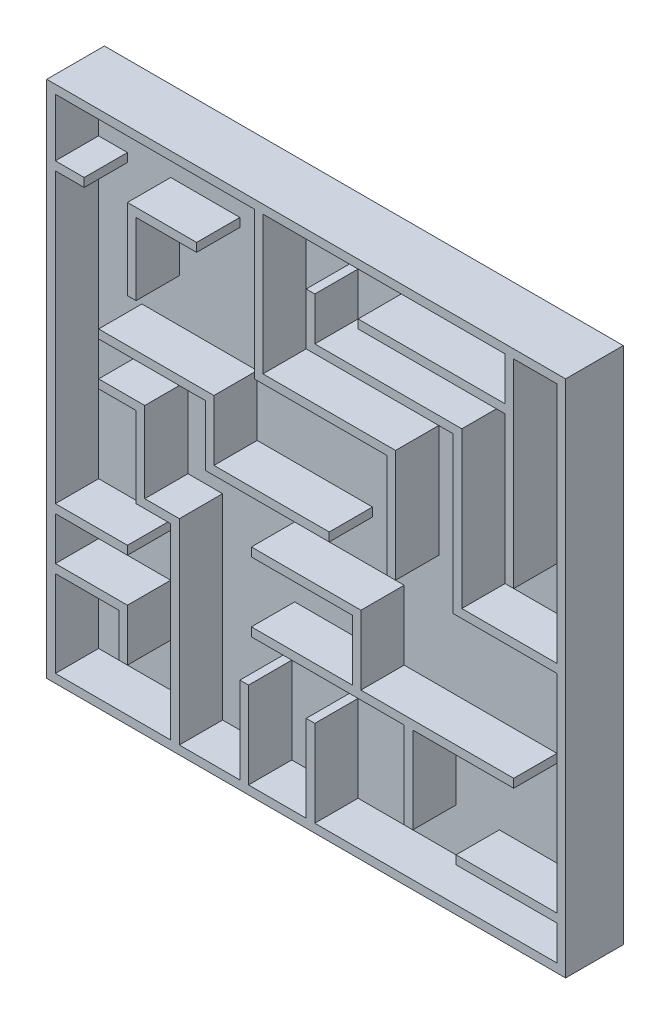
ISO-10303-21;
HEADER;
FILE_DESCRIPTION(('STEP AP214'),'2;1');
FILE_NAME('part.step','',(''),(''),'','','');
FILE_SCHEMA(('AUTOMOTIVE_DESIGN { 1 0 10303 214 1 1 1 1 }'));
ENDSEC;
DATA;
#1=APPLICATION_CONTEXT('core data for automotive mechanical design processes');
#2=APPLICATION_PROTOCOL_DEFINITION('international standard','automotive_design',2000,#1);
#3=PRODUCT_CONTEXT('',#1,'mechanical');
#4=PRODUCT('Part','Part','',(#3));
#5=PRODUCT_RELATED_PRODUCT_CATEGORY('part','',(#4));
#6=PRODUCT_DEFINITION_FORMATION('','',#4);
#7=PRODUCT_DEFINITION_CONTEXT('part definition',#1,'design');
#8=PRODUCT_DEFINITION('design','',#6,#7);
#9=PRODUCT_DEFINITION_SHAPE('','',#8);
#10=(LENGTH_UNIT() NAMED_UNIT(*) SI_UNIT(.MILLI.,.METRE.));
#11=(NAMED_UNIT(*) PLANE_ANGLE_UNIT() SI_UNIT($,.RADIAN.));
#12=(NAMED_UNIT(*) SI_UNIT($,.STERADIAN.) SOLID_ANGLE_UNIT());
#13=UNCERTAINTY_MEASURE_WITH_UNIT(LENGTH_MEASURE(1.E-05),#10,'distance_accuracy_value','');
#14=(GEOMETRIC_REPRESENTATION_CONTEXT(3) GLOBAL_UNCERTAINTY_ASSIGNED_CONTEXT((#13)) GLOBAL_UNIT_ASSIGNED_CONTEXT((#10,
#11,#12)) REPRESENTATION_CONTEXT('',''));
#15=CARTESIAN_POINT('',(0.,0.,0.));
#16=DIRECTION('',(0.,0.,1.));
#17=DIRECTION('',(1.,0.,0.));
#18=AXIS2_PLACEMENT_3D('',#15,#16,#17);
#19=CARTESIAN_POINT('',(0.,0.,5.));
#20=DIRECTION('',(0.,0.,-1.));
#21=DIRECTION('',(-1.,0.,0.));
#22=AXIS2_PLACEMENT_3D('',#19,#20,#21);
#23=PLANE('',#22);
#24=DIRECTION('',(-1.,0.,0.));
#25=VECTOR('',#24,1.);
#26=CARTESIAN_POINT('',(0.,75.,5.));
#27=LINE('',#26,#25);
#28=CARTESIAN_POINT('',(109.,75.,5.));
#29=VERTEX_POINT('',#28);
#30=CARTESIAN_POINT('',(70.9999999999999,75.,5.));
#31=VERTEX_POINT('',#30);
#32=EDGE_CURVE('E1466',#29,#31,#27,.T.);
#33=ORIENTED_EDGE('',*,*,#32,.F.);
#34=DIRECTION('',(0.,1.,0.));
#35=VECTOR('',#34,1.);
#36=CARTESIAN_POINT('',(109.,0.,5.));
#37=LINE('',#36,#35);
#38=CARTESIAN_POINT('',(109.,51.,5.));
#39=VERTEX_POINT('',#38);
#40=EDGE_CURVE('E1472',#39,#29,#37,.T.);
#41=ORIENTED_EDGE('',*,*,#40,.F.);
#42=DIRECTION('',(-1.,0.,0.));
#43=VECTOR('',#42,1.);
#44=CARTESIAN_POINT('',(0.,51.,5.));
#45=LINE('',#44,#43);
#46=CARTESIAN_POINT('',(162.,51.,5.));
#47=VERTEX_POINT('',#46);
#48=EDGE_CURVE('E1559',#47,#39,#45,.T.);
#49=ORIENTED_EDGE('',*,*,#48,.F.);
#50=DIRECTION('',(0.,-1.,0.));
#51=VECTOR('',#50,1.);
#52=CARTESIAN_POINT('',(162.,0.,5.));
#53=LINE('',#52,#51);
#54=CARTESIAN_POINT('',(162.,48.,5.));
#55=VERTEX_POINT('',#54);
#56=EDGE_CURVE('E1556',#47,#55,#53,.T.);
#57=ORIENTED_EDGE('',*,*,#56,.T.);
#58=DIRECTION('',(1.,0.,0.));
#59=VECTOR('',#58,1.);
#60=CARTESIAN_POINT('',(0.,48.,5.));
#61=LINE('',#60,#59);
#62=CARTESIAN_POINT('',(127.,48.,5.));
#63=VERTEX_POINT('',#62);
#64=EDGE_CURVE('E1552',#63,#55,#61,.T.);
#65=ORIENTED_EDGE('',*,*,#64,.F.);
#66=DIRECTION('',(0.,1.,0.));
#67=VECTOR('',#66,1.);
#68=CARTESIAN_POINT('',(127.,0.,5.));
#69=LINE('',#68,#67);
#70=CARTESIAN_POINT('',(127.,18.,5.));
#71=VERTEX_POINT('',#70);
#72=EDGE_CURVE('E1548',#71,#63,#69,.T.);
#73=ORIENTED_EDGE('',*,*,#72,.F.);
#74=DIRECTION('',(-1.,0.,0.));
#75=VECTOR('',#74,1.);
#76=CARTESIAN_POINT('',(0.,18.,5.));
#77=LINE('',#76,#75);
#78=CARTESIAN_POINT('',(124.,18.,5.));
#79=VERTEX_POINT('',#78);
#80=EDGE_CURVE('E1545',#71,#79,#77,.T.);
#81=ORIENTED_EDGE('',*,*,#80,.T.);
#82=DIRECTION('',(0.,1.,0.));
#83=VECTOR('',#82,1.);
#84=CARTESIAN_POINT('',(124.,0.,5.));
#85=LINE('',#84,#83);
#86=CARTESIAN_POINT('',(124.,48.,5.));
#87=VERTEX_POINT('',#86);
#88=EDGE_CURVE('E1542',#79,#87,#85,.T.);
#89=ORIENTED_EDGE('',*,*,#88,.T.);
#90=DIRECTION('',(-1.,0.,0.));
#91=VECTOR('',#90,1.);
#92=CARTESIAN_POINT('',(0.,48.,5.));
#93=LINE('',#92,#91);
#94=CARTESIAN_POINT('',(70.9999999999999,48.,5.));
#95=VERTEX_POINT('',#94);
#96=EDGE_CURVE('E1539',#87,#95,#93,.T.);
#97=ORIENTED_EDGE('',*,*,#96,.T.);
#98=DIRECTION('',(0.,1.,0.));
#99=VECTOR('',#98,1.);
#100=CARTESIAN_POINT('',(70.9999999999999,0.,5.));
#101=LINE('',#100,#99);
#102=CARTESIAN_POINT('',(70.9999999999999,51.,5.));
#103=VERTEX_POINT('',#102);
#104=EDGE_CURVE('E1536',#95,#103,#101,.T.);
#105=ORIENTED_EDGE('',*,*,#104,.T.);
#106=DIRECTION('',(-1.,0.,0.));
#107=VECTOR('',#106,1.);
#108=CARTESIAN_POINT('',(0.,50.9999999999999,5.));
#109=LINE('',#108,#107);
#110=CARTESIAN_POINT('',(106.,51.,5.));
#111=VERTEX_POINT('',#110);
#112=EDGE_CURVE('E1532',#111,#103,#109,.T.);
#113=ORIENTED_EDGE('',*,*,#112,.F.);
#114=DIRECTION('',(0.,1.,0.));
#115=VECTOR('',#114,1.);
#116=CARTESIAN_POINT('',(106.,0.,5.));
#117=LINE('',#116,#115);
#118=CARTESIAN_POINT('',(106.,72.,5.));
#119=VERTEX_POINT('',#118);
#120=EDGE_CURVE('E1529',#111,#119,#117,.T.);
#121=ORIENTED_EDGE('',*,*,#120,.T.);
#122=DIRECTION('',(-1.,0.,0.));
#123=VECTOR('',#122,1.);
#124=CARTESIAN_POINT('',(0.,72.,5.));
#125=LINE('',#124,#123);
#126=CARTESIAN_POINT('',(70.9999999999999,72.,5.));
#127=VERTEX_POINT('',#126);
#128=EDGE_CURVE('E1526',#119,#127,#125,.T.);
#129=ORIENTED_EDGE('',*,*,#128,.T.);
#130=DIRECTION('',(0.,-1.,0.));
#131=VECTOR('',#130,1.);
#132=CARTESIAN_POINT('',(70.9999999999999,0.,5.));
#133=LINE('',#132,#131);
#134=EDGE_CURVE('E1522',#31,#127,#133,.T.);
#135=ORIENTED_EDGE('',*,*,#134,.F.);
#136=EDGE_LOOP('',(#33,#41,#49,#57,#65,#73,#81,#89,#97,#105,#113,#121,#129,#135));
#137=FACE_BOUND('',#136,.T.);
#138=DIRECTION('',(1.,0.,0.));
#139=VECTOR('',#138,1.);
#140=CARTESIAN_POINT('',(0.,114.,5.));
#141=LINE('',#140,#139);
#142=CARTESIAN_POINT('',(18.,114.,5.));
#143=VERTEX_POINT('',#142);
#144=CARTESIAN_POINT('',(58.,114.,5.));
#145=VERTEX_POINT('',#144);
#146=EDGE_CURVE('E1654',#143,#145,#141,.T.);
#147=ORIENTED_EDGE('',*,*,#146,.T.);
#148=DIRECTION('',(0.,-1.,0.));
#149=VECTOR('',#148,1.);
#150=CARTESIAN_POINT('',(58.,0.,5.));
#151=LINE('',#150,#149);
#152=CARTESIAN_POINT('',(58.,93.,5.));
#153=VERTEX_POINT('',#152);
#154=EDGE_CURVE('E1621',#145,#153,#151,.T.);
#155=ORIENTED_EDGE('',*,*,#154,.T.);
#156=DIRECTION('',(1.,0.,0.));
#157=VECTOR('',#156,1.);
#158=CARTESIAN_POINT('',(0.,93.,5.));
#159=LINE('',#158,#157);
#160=CARTESIAN_POINT('',(98.,93.,5.));
#161=VERTEX_POINT('',#160);
#162=EDGE_CURVE('E1627',#153,#161,#159,.T.);
#163=ORIENTED_EDGE('',*,*,#162,.T.);
#164=DIRECTION('',(0.,1.,0.));
#165=VECTOR('',#164,1.);
#166=CARTESIAN_POINT('',(98.,0.,5.));
#167=LINE('',#166,#165);
#168=CARTESIAN_POINT('',(98.,90.,5.));
#169=VERTEX_POINT('',#168);
#170=EDGE_CURVE('E1670',#169,#161,#167,.T.);
#171=ORIENTED_EDGE('',*,*,#170,.F.);
#172=DIRECTION('',(1.,0.,0.));
#173=VECTOR('',#172,1.);
#174=CARTESIAN_POINT('',(0.,90.,5.));
#175=LINE('',#174,#173);
#176=CARTESIAN_POINT('',(55.,90.,5.));
#177=VERTEX_POINT('',#176);
#178=EDGE_CURVE('E1667',#177,#169,#175,.T.);
#179=ORIENTED_EDGE('',*,*,#178,.F.);
#180=DIRECTION('',(0.,-1.,0.));
#181=VECTOR('',#180,1.);
#182=CARTESIAN_POINT('',(55.,0.,5.));
#183=LINE('',#182,#181);
#184=CARTESIAN_POINT('',(55.,111.,5.));
#185=VERTEX_POINT('',#184);
#186=EDGE_CURVE('E1664',#185,#177,#183,.T.);
#187=ORIENTED_EDGE('',*,*,#186,.F.);
#188=DIRECTION('',(1.,0.,0.));
#189=VECTOR('',#188,1.);
#190=CARTESIAN_POINT('',(0.,111.,5.));
#191=LINE('',#190,#189);
#192=CARTESIAN_POINT('',(18.,111.,5.));
#193=VERTEX_POINT('',#192);
#194=EDGE_CURVE('E1661',#193,#185,#191,.T.);
#195=ORIENTED_EDGE('',*,*,#194,.F.);
#196=DIRECTION('',(0.,-1.,0.));
#197=VECTOR('',#196,1.);
#198=CARTESIAN_POINT('',(17.9999999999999,0.,5.));
#199=LINE('',#198,#197);
#200=EDGE_CURVE('E1658',#143,#193,#199,.T.);
#201=ORIENTED_EDGE('',*,*,#200,.F.);
#202=EDGE_LOOP('',(#147,#155,#163,#171,#179,#187,#195,#201));
#203=FACE_BOUND('',#202,.T.);
#204=DIRECTION('',(-1.,0.,0.));
#205=VECTOR('',#204,1.);
#206=CARTESIAN_POINT('',(0.,157.,5.));
#207=LINE('',#206,#205);
#208=CARTESIAN_POINT('',(51.9999999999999,157.,5.));
#209=VERTEX_POINT('',#208);
#210=CARTESIAN_POINT('',(28.,157.,5.));
#211=VERTEX_POINT('',#210);
#212=EDGE_CURVE('E1704',#209,#211,#207,.T.);
#213=ORIENTED_EDGE('',*,*,#212,.F.);
#214=DIRECTION('',(0.,-1.,0.));
#215=VECTOR('',#214,1.);
#216=CARTESIAN_POINT('',(51.9999999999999,0.,5.));
#217=LINE('',#216,#215);
#218=CARTESIAN_POINT('',(51.9999999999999,154.,5.));
#219=VERTEX_POINT('',#218);
#220=EDGE_CURVE('E1710',#209,#219,#217,.T.);
#221=ORIENTED_EDGE('',*,*,#220,.T.);
#222=DIRECTION('',(-1.,0.,0.));
#223=VECTOR('',#222,1.);
#224=CARTESIAN_POINT('',(0.,154.,5.));
#225=LINE('',#224,#223);
#226=CARTESIAN_POINT('',(31.,154.,5.));
#227=VERTEX_POINT('',#226);
#228=EDGE_CURVE('E1743',#219,#227,#225,.T.);
#229=ORIENTED_EDGE('',*,*,#228,.T.);
#230=DIRECTION('',(0.,-1.,0.));
#231=VECTOR('',#230,1.);
#232=CARTESIAN_POINT('',(31.0000000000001,0.,5.));
#233=LINE('',#232,#231);
#234=CARTESIAN_POINT('',(31.0000000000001,129.,5.));
#235=VERTEX_POINT('',#234);
#236=EDGE_CURVE('E1739',#227,#235,#233,.T.);
#237=ORIENTED_EDGE('',*,*,#236,.T.);
#238=DIRECTION('',(1.,0.,0.));
#239=VECTOR('',#238,1.);
#240=CARTESIAN_POINT('',(0.,129.,5.));
#241=LINE('',#240,#239);
#242=CARTESIAN_POINT('',(28.,129.,5.));
#243=VERTEX_POINT('',#242);
#244=EDGE_CURVE('E1735',#243,#235,#241,.T.);
#245=ORIENTED_EDGE('',*,*,#244,.F.);
#246=DIRECTION('',(0.,-1.,0.));
#247=VECTOR('',#246,1.);
#248=CARTESIAN_POINT('',(28.0000000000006,0.,5.));
#249=LINE('',#248,#247);
#250=EDGE_CURVE('E1732',#211,#243,#249,.T.);
#251=ORIENTED_EDGE('',*,*,#250,.F.);
#252=EDGE_LOOP('',(#213,#221,#229,#237,#245,#251));
#253=FACE_BOUND('',#252,.T.);
#254=DIRECTION('',(1.,0.,0.));
#255=VECTOR('',#254,1.);
#256=CARTESIAN_POINT('',(0.,126.,5.));
#257=LINE('',#256,#255);
#258=CARTESIAN_POINT('',(71.9999999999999,126.,5.));
#259=VERTEX_POINT('',#258);
#260=CARTESIAN_POINT('',(118.,126.,5.));
#261=VERTEX_POINT('',#260);
#262=EDGE_CURVE('E1011',#259,#261,#257,.T.);
#263=ORIENTED_EDGE('',*,*,#262,.F.);
#264=DIRECTION('',(0.,-1.,0.));
#265=VECTOR('',#264,1.);
#266=CARTESIAN_POINT('',(71.9999999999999,0.,5.));
#267=LINE('',#266,#265);
#268=CARTESIAN_POINT('',(71.9999999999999,177.,5.));
#269=VERTEX_POINT('',#268);
#270=EDGE_CURVE('E792',#269,#259,#267,.T.);
#271=ORIENTED_EDGE('',*,*,#270,.F.);
#272=DIRECTION('',(-1.,0.,0.));
#273=VECTOR('',#272,1.);
#274=CARTESIAN_POINT('',(0.,177.,5.));
#275=LINE('',#274,#273);
#276=CARTESIAN_POINT('',(3.00000000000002,177.,5.));
#277=VERTEX_POINT('',#276);
#278=EDGE_CURVE('E796',#269,#277,#275,.T.);
#279=ORIENTED_EDGE('',*,*,#278,.T.);
#280=DIRECTION('',(0.,-1.,0.));
#281=VECTOR('',#280,1.);
#282=CARTESIAN_POINT('',(3.00000000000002,0.,5.));
#283=LINE('',#282,#281);
#284=CARTESIAN_POINT('',(3.00000000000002,157.,5.));
#285=VERTEX_POINT('',#284);
#286=EDGE_CURVE('E1166',#277,#285,#283,.T.);
#287=ORIENTED_EDGE('',*,*,#286,.T.);
#288=DIRECTION('',(1.,0.,0.));
#289=VECTOR('',#288,1.);
#290=CARTESIAN_POINT('',(0.,157.,5.));
#291=LINE('',#290,#289);
#292=CARTESIAN_POINT('',(13.,157.,5.));
#293=VERTEX_POINT('',#292);
#294=EDGE_CURVE('E1202',#285,#293,#291,.T.);
#295=ORIENTED_EDGE('',*,*,#294,.T.);
#296=DIRECTION('',(0.,-1.,0.));
#297=VECTOR('',#296,1.);
#298=CARTESIAN_POINT('',(13.0000000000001,0.,5.));
#299=LINE('',#298,#297);
#300=CARTESIAN_POINT('',(13.,154.,5.));
#301=VERTEX_POINT('',#300);
#302=EDGE_CURVE('E1199',#293,#301,#299,.T.);
#303=ORIENTED_EDGE('',*,*,#302,.T.);
#304=DIRECTION('',(1.,0.,0.));
#305=VECTOR('',#304,1.);
#306=CARTESIAN_POINT('',(0.,154.,5.));
#307=LINE('',#306,#305);
#308=CARTESIAN_POINT('',(3.00000000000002,154.,5.));
#309=VERTEX_POINT('',#308);
#310=EDGE_CURVE('E1195',#309,#301,#307,.T.);
#311=ORIENTED_EDGE('',*,*,#310,.F.);
#312=CARTESIAN_POINT('',(3.00000000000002,54.,5.));
#313=VERTEX_POINT('',#312);
#314=EDGE_CURVE('E1194',#309,#313,#283,.T.);
#315=ORIENTED_EDGE('',*,*,#314,.T.);
#316=DIRECTION('',(1.,0.,0.));
#317=VECTOR('',#316,1.);
#318=CARTESIAN_POINT('',(0.,54.,5.));
#319=LINE('',#318,#317);
#320=CARTESIAN_POINT('',(28.,54.,5.));
#321=VERTEX_POINT('',#320);
#322=EDGE_CURVE('E1191',#313,#321,#319,.T.);
#323=ORIENTED_EDGE('',*,*,#322,.T.);
#324=DIRECTION('',(0.,-1.,0.));
#325=VECTOR('',#324,1.);
#326=CARTESIAN_POINT('',(28.,0.,5.));
#327=LINE('',#326,#325);
#328=CARTESIAN_POINT('',(28.,51.,5.));
#329=VERTEX_POINT('',#328);
#330=EDGE_CURVE('E1188',#321,#329,#327,.T.);
#331=ORIENTED_EDGE('',*,*,#330,.T.);
#332=DIRECTION('',(1.,0.,0.));
#333=VECTOR('',#332,1.);
#334=CARTESIAN_POINT('',(0.,51.,5.));
#335=LINE('',#334,#333);
#336=CARTESIAN_POINT('',(3.00000000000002,51.,5.));
#337=VERTEX_POINT('',#336);
#338=EDGE_CURVE('E1184',#337,#329,#335,.T.);
#339=ORIENTED_EDGE('',*,*,#338,.F.);
#340=CARTESIAN_POINT('',(3.00000000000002,36.,5.));
#341=VERTEX_POINT('',#340);
#342=EDGE_CURVE('E1167',#337,#341,#283,.T.);
#343=ORIENTED_EDGE('',*,*,#342,.T.);
#344=DIRECTION('',(1.,0.,0.));
#345=VECTOR('',#344,1.);
#346=CARTESIAN_POINT('',(0.,36.,5.));
#347=LINE('',#346,#345);
#348=CARTESIAN_POINT('',(28.,36.,5.));
#349=VERTEX_POINT('',#348);
#350=EDGE_CURVE('E1181',#341,#349,#347,.T.);
#351=ORIENTED_EDGE('',*,*,#350,.T.);
#352=DIRECTION('',(0.,-1.,0.));
#353=VECTOR('',#352,1.);
#354=CARTESIAN_POINT('',(28.,0.,5.));
#355=LINE('',#354,#353);
#356=CARTESIAN_POINT('',(28.,18.,5.));
#357=VERTEX_POINT('',#356);
#358=EDGE_CURVE('E1178',#349,#357,#355,.T.);
#359=ORIENTED_EDGE('',*,*,#358,.T.);
#360=DIRECTION('',(-1.,0.,0.));
#361=VECTOR('',#360,1.);
#362=CARTESIAN_POINT('',(0.,18.,5.));
#363=LINE('',#362,#361);
#364=CARTESIAN_POINT('',(25.,18.,5.));
#365=VERTEX_POINT('',#364);
#366=EDGE_CURVE('E1175',#357,#365,#363,.T.);
#367=ORIENTED_EDGE('',*,*,#366,.T.);
#368=DIRECTION('',(0.,-1.,0.));
#369=VECTOR('',#368,1.);
#370=CARTESIAN_POINT('',(25.,0.,5.));
#371=LINE('',#370,#369);
#372=CARTESIAN_POINT('',(25.,33.,5.));
#373=VERTEX_POINT('',#372);
#374=EDGE_CURVE('E1171',#373,#365,#371,.T.);
#375=ORIENTED_EDGE('',*,*,#374,.F.);
#376=DIRECTION('',(1.,0.,0.));
#377=VECTOR('',#376,1.);
#378=CARTESIAN_POINT('',(0.,33.,5.));
#379=LINE('',#378,#377);
#380=CARTESIAN_POINT('',(3.00000000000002,33.,5.));
#381=VERTEX_POINT('',#380);
#382=EDGE_CURVE('E1165',#381,#373,#379,.T.);
#383=ORIENTED_EDGE('',*,*,#382,.F.);
#384=CARTESIAN_POINT('',(3.00000000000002,3.00000000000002,5.));
#385=VERTEX_POINT('',#384);
#386=EDGE_CURVE('E1162',#381,#385,#283,.T.);
#387=ORIENTED_EDGE('',*,*,#386,.T.);
#388=DIRECTION('',(-1.,0.,0.));
#389=VECTOR('',#388,1.);
#390=CARTESIAN_POINT('',(0.,3.00000000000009,5.));
#391=LINE('',#390,#389);
#392=CARTESIAN_POINT('',(43.,3.00000000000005,5.));
#393=VERTEX_POINT('',#392);
#394=EDGE_CURVE('E1108',#393,#385,#391,.T.);
#395=ORIENTED_EDGE('',*,*,#394,.F.);
#396=DIRECTION('',(0.,1.,0.));
#397=VECTOR('',#396,1.);
#398=CARTESIAN_POINT('',(43.,0.,5.));
#399=LINE('',#398,#397);
#400=CARTESIAN_POINT('',(43.,68.,5.));
#401=VERTEX_POINT('',#400);
#402=EDGE_CURVE('E1159',#393,#401,#399,.T.);
#403=ORIENTED_EDGE('',*,*,#402,.T.);
#404=DIRECTION('',(-1.,0.,0.));
#405=VECTOR('',#404,1.);
#406=CARTESIAN_POINT('',(0.,68.,5.));
#407=LINE('',#406,#405);
#408=CARTESIAN_POINT('',(31.,68.,5.));
#409=VERTEX_POINT('',#408);
#410=EDGE_CURVE('E1156',#401,#409,#407,.T.);
#411=ORIENTED_EDGE('',*,*,#410,.T.);
#412=DIRECTION('',(0.,1.,0.));
#413=VECTOR('',#412,1.);
#414=CARTESIAN_POINT('',(31.,0.,5.));
#415=LINE('',#414,#413);
#416=CARTESIAN_POINT('',(31.,96.,5.));
#417=VERTEX_POINT('',#416);
#418=EDGE_CURVE('E1153',#409,#417,#415,.T.);
#419=ORIENTED_EDGE('',*,*,#418,.T.);
#420=DIRECTION('',(-1.,0.,0.));
#421=VECTOR('',#420,1.);
#422=CARTESIAN_POINT('',(0.,96.,5.));
#423=LINE('',#422,#421);
#424=CARTESIAN_POINT('',(18.,96.,5.));
#425=VERTEX_POINT('',#424);
#426=EDGE_CURVE('E1150',#417,#425,#423,.T.);
#427=ORIENTED_EDGE('',*,*,#426,.T.);
#428=DIRECTION('',(0.,1.,0.));
#429=VECTOR('',#428,1.);
#430=CARTESIAN_POINT('',(18.,0.,5.));
#431=LINE('',#430,#429);
#432=CARTESIAN_POINT('',(18.,99.,5.));
#433=VERTEX_POINT('',#432);
#434=EDGE_CURVE('E1147',#425,#433,#431,.T.);
#435=ORIENTED_EDGE('',*,*,#434,.T.);
#436=DIRECTION('',(-1.,0.,0.));
#437=VECTOR('',#436,1.);
#438=CARTESIAN_POINT('',(0.,99.,5.));
#439=LINE('',#438,#437);
#440=CARTESIAN_POINT('',(34.,99.,5.));
#441=VERTEX_POINT('',#440);
#442=EDGE_CURVE('E1143',#441,#433,#439,.T.);
#443=ORIENTED_EDGE('',*,*,#442,.F.);
#444=DIRECTION('',(0.,1.,0.));
#445=VECTOR('',#444,1.);
#446=CARTESIAN_POINT('',(34.,0.,5.));
#447=LINE('',#446,#445);
#448=CARTESIAN_POINT('',(34.,71.,5.));
#449=VERTEX_POINT('',#448);
#450=EDGE_CURVE('E1139',#449,#441,#447,.T.);
#451=ORIENTED_EDGE('',*,*,#450,.F.);
#452=DIRECTION('',(-1.,0.,0.));
#453=VECTOR('',#452,1.);
#454=CARTESIAN_POINT('',(0.,71.,5.));
#455=LINE('',#454,#453);
#456=CARTESIAN_POINT('',(46.,71.,5.));
#457=VERTEX_POINT('',#456);
#458=EDGE_CURVE('E1135',#457,#449,#455,.T.);
#459=ORIENTED_EDGE('',*,*,#458,.F.);
#460=DIRECTION('',(0.,1.,0.));
#461=VECTOR('',#460,1.);
#462=CARTESIAN_POINT('',(46.,0.,5.));
#463=LINE('',#462,#461);
#464=CARTESIAN_POINT('',(46.,3.00000000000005,5.));
#465=VERTEX_POINT('',#464);
#466=EDGE_CURVE('E1131',#465,#457,#463,.T.);
#467=ORIENTED_EDGE('',*,*,#466,.F.);
#468=CARTESIAN_POINT('',(67.,3.00000000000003,5.));
#469=VERTEX_POINT('',#468);
#470=EDGE_CURVE('E1130',#469,#465,#391,.T.);
#471=ORIENTED_EDGE('',*,*,#470,.F.);
#472=DIRECTION('',(0.,1.,0.));
#473=VECTOR('',#472,1.);
#474=CARTESIAN_POINT('',(67.,0.,5.));
#475=LINE('',#474,#473);
#476=CARTESIAN_POINT('',(67.,33.,5.));
#477=VERTEX_POINT('',#476);
#478=EDGE_CURVE('E1127',#469,#477,#475,.T.);
#479=ORIENTED_EDGE('',*,*,#478,.T.);
#480=DIRECTION('',(-1.,0.,0.));
#481=VECTOR('',#480,1.);
#482=CARTESIAN_POINT('',(0.,33.,5.));
#483=LINE('',#482,#481);
#484=CARTESIAN_POINT('',(70.,33.,5.));
#485=VERTEX_POINT('',#484);
#486=EDGE_CURVE('E1123',#485,#477,#483,.T.);
#487=ORIENTED_EDGE('',*,*,#486,.F.);
#488=DIRECTION('',(0.,1.,0.));
#489=VECTOR('',#488,1.);
#490=CARTESIAN_POINT('',(70.,0.,5.));
#491=LINE('',#490,#489);
#492=CARTESIAN_POINT('',(70.,3.00000000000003,5.));
#493=VERTEX_POINT('',#492);
#494=EDGE_CURVE('E1119',#493,#485,#491,.T.);
#495=ORIENTED_EDGE('',*,*,#494,.F.);
#496=CARTESIAN_POINT('',(89.9999999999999,3.00000000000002,5.));
#497=VERTEX_POINT('',#496);
#498=EDGE_CURVE('E1109',#497,#493,#391,.T.);
#499=ORIENTED_EDGE('',*,*,#498,.F.);
#500=DIRECTION('',(0.,1.,0.));
#501=VECTOR('',#500,1.);
#502=CARTESIAN_POINT('',(89.9999999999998,-3.33066907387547E-13,5.));
#503=LINE('',#502,#501);
#504=CARTESIAN_POINT('',(90.,33.,5.));
#505=VERTEX_POINT('',#504);
#506=EDGE_CURVE('E1116',#497,#505,#503,.T.);
#507=ORIENTED_EDGE('',*,*,#506,.T.);
#508=DIRECTION('',(1.,0.,0.));
#509=VECTOR('',#508,1.);
#510=CARTESIAN_POINT('',(0.,33.,5.));
#511=LINE('',#510,#509);
#512=CARTESIAN_POINT('',(93.,33.,5.));
#513=VERTEX_POINT('',#512);
#514=EDGE_CURVE('E1113',#505,#513,#511,.T.);
#515=ORIENTED_EDGE('',*,*,#514,.T.);
#516=DIRECTION('',(0.,1.,0.));
#517=VECTOR('',#516,1.);
#518=CARTESIAN_POINT('',(93.,0.,5.));
#519=LINE('',#518,#517);
#520=CARTESIAN_POINT('',(93.,3.00000000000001,5.));
#521=VERTEX_POINT('',#520);
#522=EDGE_CURVE('E1107',#521,#513,#519,.T.);
#523=ORIENTED_EDGE('',*,*,#522,.F.);
#524=CARTESIAN_POINT('',(177.,2.99999999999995,5.));
#525=VERTEX_POINT('',#524);
#526=EDGE_CURVE('E1103',#525,#521,#391,.T.);
#527=ORIENTED_EDGE('',*,*,#526,.F.);
#528=DIRECTION('',(0.,-1.,0.));
#529=VECTOR('',#528,1.);
#530=CARTESIAN_POINT('',(177.,0.,5.));
#531=LINE('',#530,#529);
#532=CARTESIAN_POINT('',(177.,15.,5.));
#533=VERTEX_POINT('',#532);
#534=EDGE_CURVE('E1060',#533,#525,#531,.T.);
#535=ORIENTED_EDGE('',*,*,#534,.F.);
#536=DIRECTION('',(-1.,0.,0.));
#537=VECTOR('',#536,1.);
#538=CARTESIAN_POINT('',(0.,15.,5.));
#539=LINE('',#538,#537);
#540=CARTESIAN_POINT('',(142.,15.,5.));
#541=VERTEX_POINT('',#540);
#542=EDGE_CURVE('E1100',#533,#541,#539,.T.);
#543=ORIENTED_EDGE('',*,*,#542,.T.);
#544=DIRECTION('',(0.,-1.,0.));
#545=VECTOR('',#544,1.);
#546=CARTESIAN_POINT('',(142.,0.,5.));
#547=LINE('',#546,#545);
#548=CARTESIAN_POINT('',(142.,18.,5.));
#549=VERTEX_POINT('',#548);
#550=EDGE_CURVE('E1096',#549,#541,#547,.T.);
#551=ORIENTED_EDGE('',*,*,#550,.F.);
#552=DIRECTION('',(-1.,0.,0.));
#553=VECTOR('',#552,1.);
#554=CARTESIAN_POINT('',(0.,18.,5.));
#555=LINE('',#554,#553);
#556=CARTESIAN_POINT('',(177.,18.,5.));
#557=VERTEX_POINT('',#556);
#558=EDGE_CURVE('E1092',#557,#549,#555,.T.);
#559=ORIENTED_EDGE('',*,*,#558,.F.);
#560=CARTESIAN_POINT('',(177.,90.,5.));
#561=VERTEX_POINT('',#560);
#562=EDGE_CURVE('E1061',#561,#557,#531,.T.);
#563=ORIENTED_EDGE('',*,*,#562,.F.);
#564=DIRECTION('',(-1.,0.,0.));
#565=VECTOR('',#564,1.);
#566=CARTESIAN_POINT('',(-1.38777878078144E-13,89.9999999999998,5.));
#567=LINE('',#566,#565);
#568=CARTESIAN_POINT('',(141.,90.,5.));
#569=VERTEX_POINT('',#568);
#570=EDGE_CURVE('E1089',#561,#569,#567,.T.);
#571=ORIENTED_EDGE('',*,*,#570,.T.);
#572=DIRECTION('',(0.,1.,0.));
#573=VECTOR('',#572,1.);
#574=CARTESIAN_POINT('',(141.,0.,5.));
#575=LINE('',#574,#573);
#576=CARTESIAN_POINT('',(141.,144.,5.));
#577=VERTEX_POINT('',#576);
#578=EDGE_CURVE('E1086',#569,#577,#575,.T.);
#579=ORIENTED_EDGE('',*,*,#578,.T.);
#580=DIRECTION('',(-1.,0.,0.));
#581=VECTOR('',#580,1.);
#582=CARTESIAN_POINT('',(0.,144.,5.));
#583=LINE('',#582,#581);
#584=CARTESIAN_POINT('',(89.9999999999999,144.,5.));
#585=VERTEX_POINT('',#584);
#586=EDGE_CURVE('E1083',#577,#585,#583,.T.);
#587=ORIENTED_EDGE('',*,*,#586,.T.);
#588=DIRECTION('',(0.,1.,0.));
#589=VECTOR('',#588,1.);
#590=CARTESIAN_POINT('',(89.9999999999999,0.,5.));
#591=LINE('',#590,#589);
#592=CARTESIAN_POINT('',(89.9999999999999,162.,5.));
#593=VERTEX_POINT('',#592);
#594=EDGE_CURVE('E1080',#585,#593,#591,.T.);
#595=ORIENTED_EDGE('',*,*,#594,.T.);
#596=DIRECTION('',(1.,0.,0.));
#597=VECTOR('',#596,1.);
#598=CARTESIAN_POINT('',(-1.49880108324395E-12,161.999999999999,5.));
#599=LINE('',#598,#597);
#600=CARTESIAN_POINT('',(92.9999999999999,162.,5.));
#601=VERTEX_POINT('',#600);
#602=EDGE_CURVE('E1077',#593,#601,#599,.T.);
#603=ORIENTED_EDGE('',*,*,#602,.T.);
#604=DIRECTION('',(0.,1.,0.));
#605=VECTOR('',#604,1.);
#606=CARTESIAN_POINT('',(92.9999999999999,0.,5.));
#607=LINE('',#606,#605);
#608=CARTESIAN_POINT('',(92.9999999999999,147.,5.));
#609=VERTEX_POINT('',#608);
#610=EDGE_CURVE('E1073',#609,#601,#607,.T.);
#611=ORIENTED_EDGE('',*,*,#610,.F.);
#612=DIRECTION('',(-1.,0.,0.));
#613=VECTOR('',#612,1.);
#614=CARTESIAN_POINT('',(0.,147.,5.));
#615=LINE('',#614,#613);
#616=CARTESIAN_POINT('',(144.,147.,5.));
#617=VERTEX_POINT('',#616);
#618=EDGE_CURVE('E1069',#617,#609,#615,.T.);
#619=ORIENTED_EDGE('',*,*,#618,.F.);
#620=DIRECTION('',(0.,1.,0.));
#621=VECTOR('',#620,1.);
#622=CARTESIAN_POINT('',(144.,0.,5.));
#623=LINE('',#622,#621);
#624=CARTESIAN_POINT('',(144.,93.,5.));
#625=VERTEX_POINT('',#624);
#626=EDGE_CURVE('E1065',#625,#617,#623,.T.);
#627=ORIENTED_EDGE('',*,*,#626,.F.);
#628=DIRECTION('',(-1.,0.,0.));
#629=VECTOR('',#628,1.);
#630=CARTESIAN_POINT('',(0.,92.9999999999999,5.));
#631=LINE('',#630,#629);
#632=CARTESIAN_POINT('',(177.,93.,5.));
#633=VERTEX_POINT('',#632);
#634=EDGE_CURVE('E1059',#633,#625,#631,.T.);
#635=ORIENTED_EDGE('',*,*,#634,.F.);
#636=CARTESIAN_POINT('',(177.,177.,5.));
#637=VERTEX_POINT('',#636);
#638=EDGE_CURVE('E1055',#637,#633,#531,.T.);
#639=ORIENTED_EDGE('',*,*,#638,.F.);
#640=CARTESIAN_POINT('',(162.,177.,5.));
#641=VERTEX_POINT('',#640);
#642=EDGE_CURVE('E1033',#637,#641,#275,.T.);
#643=ORIENTED_EDGE('',*,*,#642,.T.);
#644=DIRECTION('',(0.,-1.,0.));
#645=VECTOR('',#644,1.);
#646=CARTESIAN_POINT('',(162.,0.,5.));
#647=LINE('',#646,#645);
#648=CARTESIAN_POINT('',(162.,108.,5.));
#649=VERTEX_POINT('',#648);
#650=EDGE_CURVE('E1052',#641,#649,#647,.T.);
#651=ORIENTED_EDGE('',*,*,#650,.T.);
#652=DIRECTION('',(-1.,0.,0.));
#653=VECTOR('',#652,1.);
#654=CARTESIAN_POINT('',(-4.99600361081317E-13,107.999999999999,5.));
#655=LINE('',#654,#653);
#656=CARTESIAN_POINT('',(159.,108.,5.));
#657=VERTEX_POINT('',#656);
#658=EDGE_CURVE('E1049',#649,#657,#655,.T.);
#659=ORIENTED_EDGE('',*,*,#658,.T.);
#660=DIRECTION('',(0.,-1.,0.));
#661=VECTOR('',#660,1.);
#662=CARTESIAN_POINT('',(159.,0.,5.));
#663=LINE('',#662,#661);
#664=CARTESIAN_POINT('',(159.,159.,5.));
#665=VERTEX_POINT('',#664);
#666=EDGE_CURVE('E1038',#665,#657,#663,.T.);
#667=ORIENTED_EDGE('',*,*,#666,.F.);
#668=DIRECTION('',(-1.,0.,0.));
#669=VECTOR('',#668,1.);
#670=CARTESIAN_POINT('',(0.,159.,5.));
#671=LINE('',#670,#669);
#672=CARTESIAN_POINT('',(108.,159.,5.));
#673=VERTEX_POINT('',#672);
#674=EDGE_CURVE('E1046',#665,#673,#671,.T.);
#675=ORIENTED_EDGE('',*,*,#674,.T.);
#676=DIRECTION('',(0.,-1.,0.));
#677=VECTOR('',#676,1.);
#678=CARTESIAN_POINT('',(108.,0.,5.));
#679=LINE('',#678,#677);
#680=CARTESIAN_POINT('',(108.,162.,5.));
#681=VERTEX_POINT('',#680);
#682=EDGE_CURVE('E1042',#681,#673,#679,.T.);
#683=ORIENTED_EDGE('',*,*,#682,.F.);
#684=DIRECTION('',(-1.,0.,0.));
#685=VECTOR('',#684,1.);
#686=CARTESIAN_POINT('',(0.,162.,5.));
#687=LINE('',#686,#685);
#688=CARTESIAN_POINT('',(159.,162.,5.));
#689=VERTEX_POINT('',#688);
#690=EDGE_CURVE('E1037',#689,#681,#687,.T.);
#691=ORIENTED_EDGE('',*,*,#690,.F.);
#692=CARTESIAN_POINT('',(159.,177.,5.));
#693=VERTEX_POINT('',#692);
#694=EDGE_CURVE('E1032',#693,#689,#663,.T.);
#695=ORIENTED_EDGE('',*,*,#694,.F.);
#696=CARTESIAN_POINT('',(74.9999999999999,177.,5.));
#697=VERTEX_POINT('',#696);
#698=EDGE_CURVE('E1029',#693,#697,#275,.T.);
#699=ORIENTED_EDGE('',*,*,#698,.T.);
#700=DIRECTION('',(0.,-1.,0.));
#701=VECTOR('',#700,1.);
#702=CARTESIAN_POINT('',(75.,0.,5.));
#703=LINE('',#702,#701);
#704=CARTESIAN_POINT('',(74.9999999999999,129.,5.));
#705=VERTEX_POINT('',#704);
#706=EDGE_CURVE('E1026',#697,#705,#703,.T.);
#707=ORIENTED_EDGE('',*,*,#706,.T.);
#708=DIRECTION('',(1.,0.,0.));
#709=VECTOR('',#708,1.);
#710=CARTESIAN_POINT('',(0.,129.,5.));
#711=LINE('',#710,#709);
#712=CARTESIAN_POINT('',(121.,129.,5.));
#713=VERTEX_POINT('',#712);
#714=EDGE_CURVE('E1023',#705,#713,#711,.T.);
#715=ORIENTED_EDGE('',*,*,#714,.T.);
#716=DIRECTION('',(0.,-1.,0.));
#717=VECTOR('',#716,1.);
#718=CARTESIAN_POINT('',(121.,0.,5.));
#719=LINE('',#718,#717);
#720=CARTESIAN_POINT('',(121.,90.,5.));
#721=VERTEX_POINT('',#720);
#722=EDGE_CURVE('E1020',#713,#721,#719,.T.);
#723=ORIENTED_EDGE('',*,*,#722,.T.);
#724=DIRECTION('',(1.,0.,0.));
#725=VECTOR('',#724,1.);
#726=CARTESIAN_POINT('',(0.,90.,5.));
#727=LINE('',#726,#725);
#728=CARTESIAN_POINT('',(118.,90.,5.));
#729=VERTEX_POINT('',#728);
#730=EDGE_CURVE('E181',#729,#721,#727,.T.);
#731=ORIENTED_EDGE('',*,*,#730,.F.);
#732=DIRECTION('',(0.,1.,0.));
#733=VECTOR('',#732,1.);
#734=CARTESIAN_POINT('',(118.,0.,5.));
#735=LINE('',#734,#733);
#736=EDGE_CURVE('E176',#729,#261,#735,.T.);
#737=ORIENTED_EDGE('',*,*,#736,.T.);
#738=EDGE_LOOP('',(#263,#271,#279,#287,#295,#303,#311,#315,#323,#331,#339,#343,#351,#359,#367,
#375,#383,#387,#395,#403,#411,#419,#427,#435,#443,#451,#459,#467,#471,#479,#487,#495,#499,#507,
#515,#523,#527,#535,#543,#551,#559,#563,#571,#579,#587,#595,#603,#611,#619,#627,#635,#639,#643,
#651,#659,#667,#675,#683,#691,#695,#699,#707,#715,#723,#731,#737));
#739=FACE_BOUND('',#738,.T.);
#740=ADVANCED_FACE('F159',(#137,#203,#253,#739),#23,.F.);
#741=CARTESIAN_POINT('',(0.,157.,20.));
#742=DIRECTION('',(0.,-1.,0.));
#743=DIRECTION('',(0.,0.,-1.));
#744=AXIS2_PLACEMENT_3D('',#741,#742,#743);
#745=PLANE('',#744);
#746=ORIENTED_EDGE('',*,*,#212,.T.);
#747=DIRECTION('',(0.,0.,-1.));
#748=VECTOR('',#747,1.);
#749=CARTESIAN_POINT('',(28.,157.,20.));
#750=LINE('',#749,#748);
#751=CARTESIAN_POINT('',(28.,157.,20.));
#752=VERTEX_POINT('',#751);
#753=EDGE_CURVE('E1766',#752,#211,#750,.T.);
#754=ORIENTED_EDGE('',*,*,#753,.F.);
#755=DIRECTION('',(-1.,0.,0.));
#756=VECTOR('',#755,1.);
#757=CARTESIAN_POINT('',(0.,157.,20.));
#758=LINE('',#757,#756);
#759=CARTESIAN_POINT('',(51.9999999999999,157.,20.));
#760=VERTEX_POINT('',#759);
#761=EDGE_CURVE('E1705',#760,#752,#758,.T.);
#762=ORIENTED_EDGE('',*,*,#761,.F.);
#763=DIRECTION('',(0.,0.,-1.));
#764=VECTOR('',#763,1.);
#765=CARTESIAN_POINT('',(51.9999999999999,157.,20.));
#766=LINE('',#765,#764);
#767=EDGE_CURVE('E1728',#760,#209,#766,.T.);
#768=ORIENTED_EDGE('',*,*,#767,.T.);
#769=EDGE_LOOP('',(#746,#754,#762,#768));
#770=FACE_BOUND('',#769,.T.);
#771=ADVANCED_FACE('F1804',(#770),#745,.F.);
#772=CARTESIAN_POINT('',(28.0000000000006,0.,20.));
#773=DIRECTION('',(1.,0.,0.));
#774=DIRECTION('',(0.,1.,0.));
#775=AXIS2_PLACEMENT_3D('',#772,#773,#774);
#776=PLANE('',#775);
#777=ORIENTED_EDGE('',*,*,#250,.T.);
#778=DIRECTION('',(0.,0.,-1.));
#779=VECTOR('',#778,1.);
#780=CARTESIAN_POINT('',(28.,129.,20.));
#781=LINE('',#780,#779);
#782=CARTESIAN_POINT('',(28.,129.,20.));
#783=VERTEX_POINT('',#782);
#784=EDGE_CURVE('E1762',#783,#243,#781,.T.);
#785=ORIENTED_EDGE('',*,*,#784,.F.);
#786=DIRECTION('',(0.,-1.,0.));
#787=VECTOR('',#786,1.);
#788=CARTESIAN_POINT('',(28.0000000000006,0.,20.));
#789=LINE('',#788,#787);
#790=EDGE_CURVE('E1709',#752,#783,#789,.T.);
#791=ORIENTED_EDGE('',*,*,#790,.F.);
#792=ORIENTED_EDGE('',*,*,#753,.T.);
#793=EDGE_LOOP('',(#777,#785,#791,#792));
#794=FACE_BOUND('',#793,.T.);
#795=ADVANCED_FACE('F1811',(#794),#776,.F.);
#796=CARTESIAN_POINT('',(0.,129.,20.));
#797=DIRECTION('',(0.,1.,0.));
#798=DIRECTION('',(0.,0.,1.));
#799=AXIS2_PLACEMENT_3D('',#796,#797,#798);
#800=PLANE('',#799);
#801=ORIENTED_EDGE('',*,*,#244,.T.);
#802=DIRECTION('',(0.,0.,-1.));
#803=VECTOR('',#802,1.);
#804=CARTESIAN_POINT('',(31.0000000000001,129.,20.));
#805=LINE('',#804,#803);
#806=CARTESIAN_POINT('',(31.0000000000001,129.,20.));
#807=VERTEX_POINT('',#806);
#808=EDGE_CURVE('E1759',#807,#235,#805,.T.);
#809=ORIENTED_EDGE('',*,*,#808,.F.);
#810=DIRECTION('',(1.,0.,0.));
#811=VECTOR('',#810,1.);
#812=CARTESIAN_POINT('',(0.,129.,20.));
#813=LINE('',#812,#811);
#814=EDGE_CURVE('E1713',#783,#807,#813,.T.);
#815=ORIENTED_EDGE('',*,*,#814,.F.);
#816=ORIENTED_EDGE('',*,*,#784,.T.);
#817=EDGE_LOOP('',(#801,#809,#815,#816));
#818=FACE_BOUND('',#817,.T.);
#819=ADVANCED_FACE('F2208',(#818),#800,.F.);
#820=CARTESIAN_POINT('',(31.0000000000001,0.,20.));
#821=DIRECTION('',(1.,0.,0.));
#822=DIRECTION('',(0.,1.,0.));
#823=AXIS2_PLACEMENT_3D('',#820,#821,#822);
#824=PLANE('',#823);
#825=ORIENTED_EDGE('',*,*,#236,.F.);
#826=DIRECTION('',(0.,0.,-1.));
#827=VECTOR('',#826,1.);
#828=CARTESIAN_POINT('',(31.,154.,20.));
#829=LINE('',#828,#827);
#830=CARTESIAN_POINT('',(31.,154.,20.));
#831=VERTEX_POINT('',#830);
#832=EDGE_CURVE('E1756',#831,#227,#829,.T.);
#833=ORIENTED_EDGE('',*,*,#832,.F.);
#834=DIRECTION('',(0.,-1.,0.));
#835=VECTOR('',#834,1.);
#836=CARTESIAN_POINT('',(31.0000000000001,0.,20.));
#837=LINE('',#836,#835);
#838=EDGE_CURVE('E1716',#831,#807,#837,.T.);
#839=ORIENTED_EDGE('',*,*,#838,.T.);
#840=ORIENTED_EDGE('',*,*,#808,.T.);
#841=EDGE_LOOP('',(#825,#833,#839,#840));
#842=FACE_BOUND('',#841,.T.);
#843=ADVANCED_FACE('F2204',(#842),#824,.T.);
#844=CARTESIAN_POINT('',(0.,154.,20.));
#845=DIRECTION('',(0.,-1.,0.));
#846=DIRECTION('',(0.,0.,-1.));
#847=AXIS2_PLACEMENT_3D('',#844,#845,#846);
#848=PLANE('',#847);
#849=ORIENTED_EDGE('',*,*,#228,.F.);
#850=DIRECTION('',(0.,0.,-1.));
#851=VECTOR('',#850,1.);
#852=CARTESIAN_POINT('',(51.9999999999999,154.,20.));
#853=LINE('',#852,#851);
#854=CARTESIAN_POINT('',(51.9999999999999,154.,20.));
#855=VERTEX_POINT('',#854);
#856=EDGE_CURVE('E1752',#855,#219,#853,.T.);
#857=ORIENTED_EDGE('',*,*,#856,.F.);
#858=DIRECTION('',(-1.,0.,0.));
#859=VECTOR('',#858,1.);
#860=CARTESIAN_POINT('',(0.,154.,20.));
#861=LINE('',#860,#859);
#862=EDGE_CURVE('E1720',#855,#831,#861,.T.);
#863=ORIENTED_EDGE('',*,*,#862,.T.);
#864=ORIENTED_EDGE('',*,*,#832,.T.);
#865=EDGE_LOOP('',(#849,#857,#863,#864));
#866=FACE_BOUND('',#865,.T.);
#867=ADVANCED_FACE('F2200',(#866),#848,.T.);
#868=CARTESIAN_POINT('',(51.9999999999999,0.,20.));
#869=DIRECTION('',(1.,0.,0.));
#870=DIRECTION('',(0.,0.,-1.));
#871=AXIS2_PLACEMENT_3D('',#868,#869,#870);
#872=PLANE('',#871);
#873=ORIENTED_EDGE('',*,*,#220,.F.);
#874=ORIENTED_EDGE('',*,*,#767,.F.);
#875=DIRECTION('',(0.,-1.,0.));
#876=VECTOR('',#875,1.);
#877=CARTESIAN_POINT('',(51.9999999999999,0.,20.));
#878=LINE('',#877,#876);
#879=EDGE_CURVE('E1724',#760,#855,#878,.T.);
#880=ORIENTED_EDGE('',*,*,#879,.T.);
#881=ORIENTED_EDGE('',*,*,#856,.T.);
#882=EDGE_LOOP('',(#873,#874,#880,#881));
#883=FACE_BOUND('',#882,.T.);
#884=ADVANCED_FACE('F2196',(#883),#872,.T.);
#885=CARTESIAN_POINT('',(0.,0.,20.));
#886=DIRECTION('',(0.,0.,1.));
#887=DIRECTION('',(1.,0.,0.));
#888=AXIS2_PLACEMENT_3D('',#885,#886,#887);
#889=PLANE('',#888);
#890=ORIENTED_EDGE('',*,*,#761,.T.);
#891=ORIENTED_EDGE('',*,*,#790,.T.);
#892=ORIENTED_EDGE('',*,*,#814,.T.);
#893=ORIENTED_EDGE('',*,*,#838,.F.);
#894=ORIENTED_EDGE('',*,*,#862,.F.);
#895=ORIENTED_EDGE('',*,*,#879,.F.);
#896=EDGE_LOOP('',(#890,#891,#892,#893,#894,#895));
#897=FACE_BOUND('',#896,.T.);
#898=ADVANCED_FACE('F2192',(#897),#889,.T.);
#899=CARTESIAN_POINT('',(58.,0.,20.));
#900=DIRECTION('',(1.,0.,0.));
#901=DIRECTION('',(0.,0.,-1.));
#902=AXIS2_PLACEMENT_3D('',#899,#900,#901);
#903=PLANE('',#902);
#904=ORIENTED_EDGE('',*,*,#154,.F.);
#905=DIRECTION('',(0.,0.,-1.));
#906=VECTOR('',#905,1.);
#907=CARTESIAN_POINT('',(58.,114.,20.));
#908=LINE('',#907,#906);
#909=CARTESIAN_POINT('',(58.,114.,20.));
#910=VERTEX_POINT('',#909);
#911=EDGE_CURVE('E1701',#910,#145,#908,.T.);
#912=ORIENTED_EDGE('',*,*,#911,.F.);
#913=DIRECTION('',(0.,-1.,0.));
#914=VECTOR('',#913,1.);
#915=CARTESIAN_POINT('',(58.,0.,20.));
#916=LINE('',#915,#914);
#917=CARTESIAN_POINT('',(58.,93.,20.));
#918=VERTEX_POINT('',#917);
#919=EDGE_CURVE('E1622',#910,#918,#916,.T.);
#920=ORIENTED_EDGE('',*,*,#919,.T.);
#921=DIRECTION('',(0.,0.,-1.));
#922=VECTOR('',#921,1.);
#923=CARTESIAN_POINT('',(58.,93.,20.));
#924=LINE('',#923,#922);
#925=EDGE_CURVE('E1650',#918,#153,#924,.T.);
#926=ORIENTED_EDGE('',*,*,#925,.T.);
#927=EDGE_LOOP('',(#904,#912,#920,#926));
#928=FACE_BOUND('',#927,.T.);
#929=ADVANCED_FACE('F2188',(#928),#903,.T.);
#930=CARTESIAN_POINT('',(0.,114.,20.));
#931=DIRECTION('',(0.,1.,0.));
#932=DIRECTION('',(0.,0.,1.));
#933=AXIS2_PLACEMENT_3D('',#930,#931,#932);
#934=PLANE('',#933);
#935=ORIENTED_EDGE('',*,*,#146,.F.);
#936=DIRECTION('',(0.,0.,-1.));
#937=VECTOR('',#936,1.);
#938=CARTESIAN_POINT('',(18.,114.,20.));
#939=LINE('',#938,#937);
#940=CARTESIAN_POINT('',(18.,114.,20.));
#941=VERTEX_POINT('',#940);
#942=EDGE_CURVE('E1698',#941,#143,#939,.T.);
#943=ORIENTED_EDGE('',*,*,#942,.F.);
#944=DIRECTION('',(1.,0.,0.));
#945=VECTOR('',#944,1.);
#946=CARTESIAN_POINT('',(0.,114.,20.));
#947=LINE('',#946,#945);
#948=EDGE_CURVE('E1626',#941,#910,#947,.T.);
#949=ORIENTED_EDGE('',*,*,#948,.T.);
#950=ORIENTED_EDGE('',*,*,#911,.T.);
#951=EDGE_LOOP('',(#935,#943,#949,#950));
#952=FACE_BOUND('',#951,.T.);
#953=ADVANCED_FACE('F2184',(#952),#934,.T.);
#954=CARTESIAN_POINT('',(17.9999999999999,0.,20.));
#955=DIRECTION('',(1.,0.,0.));
#956=DIRECTION('',(0.,1.,0.));
#957=AXIS2_PLACEMENT_3D('',#954,#955,#956);
#958=PLANE('',#957);
#959=ORIENTED_EDGE('',*,*,#200,.T.);
#960=DIRECTION('',(0.,0.,-1.));
#961=VECTOR('',#960,1.);
#962=CARTESIAN_POINT('',(18.,111.,20.));
#963=LINE('',#962,#961);
#964=CARTESIAN_POINT('',(18.,111.,20.));
#965=VERTEX_POINT('',#964);
#966=EDGE_CURVE('E1694',#965,#193,#963,.T.);
#967=ORIENTED_EDGE('',*,*,#966,.F.);
#968=DIRECTION('',(0.,-1.,0.));
#969=VECTOR('',#968,1.);
#970=CARTESIAN_POINT('',(17.9999999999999,0.,20.));
#971=LINE('',#970,#969);
#972=EDGE_CURVE('E1631',#941,#965,#971,.T.);
#973=ORIENTED_EDGE('',*,*,#972,.F.);
#974=ORIENTED_EDGE('',*,*,#942,.T.);
#975=EDGE_LOOP('',(#959,#967,#973,#974));
#976=FACE_BOUND('',#975,.T.);
#977=ADVANCED_FACE('F2180',(#976),#958,.F.);
#978=CARTESIAN_POINT('',(0.,111.,20.));
#979=DIRECTION('',(0.,1.,0.));
#980=DIRECTION('',(0.,0.,1.));
#981=AXIS2_PLACEMENT_3D('',#978,#979,#980);
#982=PLANE('',#981);
#983=ORIENTED_EDGE('',*,*,#194,.T.);
#984=DIRECTION('',(0.,0.,-1.));
#985=VECTOR('',#984,1.);
#986=CARTESIAN_POINT('',(55.,111.,20.));
#987=LINE('',#986,#985);
#988=CARTESIAN_POINT('',(55.,111.,20.));
#989=VERTEX_POINT('',#988);
#990=EDGE_CURVE('E1690',#989,#185,#987,.T.);
#991=ORIENTED_EDGE('',*,*,#990,.F.);
#992=DIRECTION('',(1.,0.,0.));
#993=VECTOR('',#992,1.);
#994=CARTESIAN_POINT('',(0.,111.,20.));
#995=LINE('',#994,#993);
#996=EDGE_CURVE('E1634',#965,#989,#995,.T.);
#997=ORIENTED_EDGE('',*,*,#996,.F.);
#998=ORIENTED_EDGE('',*,*,#966,.T.);
#999=EDGE_LOOP('',(#983,#991,#997,#998));
#1000=FACE_BOUND('',#999,.T.);
#1001=ADVANCED_FACE('F2176',(#1000),#982,.F.);
#1002=CARTESIAN_POINT('',(55.,0.,20.));
#1003=DIRECTION('',(1.,0.,0.));
#1004=DIRECTION('',(0.,0.,-1.));
#1005=AXIS2_PLACEMENT_3D('',#1002,#1003,#1004);
#1006=PLANE('',#1005);
#1007=ORIENTED_EDGE('',*,*,#186,.T.);
#1008=DIRECTION('',(0.,0.,-1.));
#1009=VECTOR('',#1008,1.);
#1010=CARTESIAN_POINT('',(55.,90.,20.));
#1011=LINE('',#1010,#1009);
#1012=CARTESIAN_POINT('',(55.,90.,20.));
#1013=VERTEX_POINT('',#1012);
#1014=EDGE_CURVE('E1686',#1013,#177,#1011,.T.);
#1015=ORIENTED_EDGE('',*,*,#1014,.F.);
#1016=DIRECTION('',(0.,-1.,0.));
#1017=VECTOR('',#1016,1.);
#1018=CARTESIAN_POINT('',(55.,0.,20.));
#1019=LINE('',#1018,#1017);
#1020=EDGE_CURVE('E1637',#989,#1013,#1019,.T.);
#1021=ORIENTED_EDGE('',*,*,#1020,.F.);
#1022=ORIENTED_EDGE('',*,*,#990,.T.);
#1023=EDGE_LOOP('',(#1007,#1015,#1021,#1022));
#1024=FACE_BOUND('',#1023,.T.);
#1025=ADVANCED_FACE('F2172',(#1024),#1006,.F.);
#1026=CARTESIAN_POINT('',(0.,90.,20.));
#1027=DIRECTION('',(0.,1.,0.));
#1028=DIRECTION('',(0.,0.,1.));
#1029=AXIS2_PLACEMENT_3D('',#1026,#1027,#1028);
#1030=PLANE('',#1029);
#1031=ORIENTED_EDGE('',*,*,#178,.T.);
#1032=DIRECTION('',(0.,0.,-1.));
#1033=VECTOR('',#1032,1.);
#1034=CARTESIAN_POINT('',(98.,90.,20.));
#1035=LINE('',#1034,#1033);
#1036=CARTESIAN_POINT('',(98.,90.,20.));
#1037=VERTEX_POINT('',#1036);
#1038=EDGE_CURVE('E1682',#1037,#169,#1035,.T.);
#1039=ORIENTED_EDGE('',*,*,#1038,.F.);
#1040=DIRECTION('',(1.,0.,0.));
#1041=VECTOR('',#1040,1.);
#1042=CARTESIAN_POINT('',(0.,90.,20.));
#1043=LINE('',#1042,#1041);
#1044=EDGE_CURVE('E1640',#1013,#1037,#1043,.T.);
#1045=ORIENTED_EDGE('',*,*,#1044,.F.);
#1046=ORIENTED_EDGE('',*,*,#1014,.T.);
#1047=EDGE_LOOP('',(#1031,#1039,#1045,#1046));
#1048=FACE_BOUND('',#1047,.T.);
#1049=ADVANCED_FACE('F2168',(#1048),#1030,.F.);
#1050=CARTESIAN_POINT('',(98.,0.,20.));
#1051=DIRECTION('',(-1.,0.,0.));
#1052=DIRECTION('',(0.,0.,1.));
#1053=AXIS2_PLACEMENT_3D('',#1050,#1051,#1052);
#1054=PLANE('',#1053);
#1055=ORIENTED_EDGE('',*,*,#170,.T.);
#1056=DIRECTION('',(0.,0.,-1.));
#1057=VECTOR('',#1056,1.);
#1058=CARTESIAN_POINT('',(98.,93.,20.));
#1059=LINE('',#1058,#1057);
#1060=CARTESIAN_POINT('',(98.,93.,20.));
#1061=VERTEX_POINT('',#1060);
#1062=EDGE_CURVE('E1678',#1061,#161,#1059,.T.);
#1063=ORIENTED_EDGE('',*,*,#1062,.F.);
#1064=DIRECTION('',(0.,1.,0.));
#1065=VECTOR('',#1064,1.);
#1066=CARTESIAN_POINT('',(98.,0.,20.));
#1067=LINE('',#1066,#1065);
#1068=EDGE_CURVE('E1643',#1037,#1061,#1067,.T.);
#1069=ORIENTED_EDGE('',*,*,#1068,.F.);
#1070=ORIENTED_EDGE('',*,*,#1038,.T.);
#1071=EDGE_LOOP('',(#1055,#1063,#1069,#1070));
#1072=FACE_BOUND('',#1071,.T.);
#1073=ADVANCED_FACE('F2164',(#1072),#1054,.F.);
#1074=CARTESIAN_POINT('',(0.,93.,20.));
#1075=DIRECTION('',(0.,1.,0.));
#1076=DIRECTION('',(0.,0.,1.));
#1077=AXIS2_PLACEMENT_3D('',#1074,#1075,#1076);
#1078=PLANE('',#1077);
#1079=ORIENTED_EDGE('',*,*,#162,.F.);
#1080=ORIENTED_EDGE('',*,*,#925,.F.);
#1081=DIRECTION('',(1.,0.,0.));
#1082=VECTOR('',#1081,1.);
#1083=CARTESIAN_POINT('',(0.,93.,20.));
#1084=LINE('',#1083,#1082);
#1085=EDGE_CURVE('E1646',#918,#1061,#1084,.T.);
#1086=ORIENTED_EDGE('',*,*,#1085,.T.);
#1087=ORIENTED_EDGE('',*,*,#1062,.T.);
#1088=EDGE_LOOP('',(#1079,#1080,#1086,#1087));
#1089=FACE_BOUND('',#1088,.T.);
#1090=ADVANCED_FACE('F2160',(#1089),#1078,.T.);
#1091=CARTESIAN_POINT('',(0.,0.,20.));
#1092=DIRECTION('',(0.,0.,1.));
#1093=DIRECTION('',(1.,0.,0.));
#1094=AXIS2_PLACEMENT_3D('',#1091,#1092,#1093);
#1095=PLANE('',#1094);
#1096=ORIENTED_EDGE('',*,*,#919,.F.);
#1097=ORIENTED_EDGE('',*,*,#948,.F.);
#1098=ORIENTED_EDGE('',*,*,#972,.T.);
#1099=ORIENTED_EDGE('',*,*,#996,.T.);
#1100=ORIENTED_EDGE('',*,*,#1020,.T.);
#1101=ORIENTED_EDGE('',*,*,#1044,.T.);
#1102=ORIENTED_EDGE('',*,*,#1068,.T.);
#1103=ORIENTED_EDGE('',*,*,#1085,.F.);
#1104=EDGE_LOOP('',(#1096,#1097,#1098,#1099,#1100,#1101,#1102,#1103));
#1105=FACE_BOUND('',#1104,.T.);
#1106=ADVANCED_FACE('F2156',(#1105),#1095,.T.);
#1107=CARTESIAN_POINT('',(0.,75.,20.));
#1108=DIRECTION('',(0.,-1.,0.));
#1109=DIRECTION('',(0.,0.,-1.));
#1110=AXIS2_PLACEMENT_3D('',#1107,#1108,#1109);
#1111=PLANE('',#1110);
#1112=ORIENTED_EDGE('',*,*,#32,.T.);
#1113=DIRECTION('',(0.,0.,-1.));
#1114=VECTOR('',#1113,1.);
#1115=CARTESIAN_POINT('',(70.9999999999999,75.,20.));
#1116=LINE('',#1115,#1114);
#1117=CARTESIAN_POINT('',(70.9999999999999,75.,20.));
#1118=VERTEX_POINT('',#1117);
#1119=EDGE_CURVE('E1617',#1118,#31,#1116,.T.);
#1120=ORIENTED_EDGE('',*,*,#1119,.F.);
#1121=DIRECTION('',(-1.,0.,0.));
#1122=VECTOR('',#1121,1.);
#1123=CARTESIAN_POINT('',(0.,75.,20.));
#1124=LINE('',#1123,#1122);
#1125=CARTESIAN_POINT('',(109.,75.,20.));
#1126=VERTEX_POINT('',#1125);
#1127=EDGE_CURVE('E1467',#1126,#1118,#1124,.T.);
#1128=ORIENTED_EDGE('',*,*,#1127,.F.);
#1129=DIRECTION('',(0.,0.,-1.));
#1130=VECTOR('',#1129,1.);
#1131=CARTESIAN_POINT('',(109.,75.,20.));
#1132=LINE('',#1131,#1130);
#1133=EDGE_CURVE('E1518',#1126,#29,#1132,.T.);
#1134=ORIENTED_EDGE('',*,*,#1133,.T.);
#1135=EDGE_LOOP('',(#1112,#1120,#1128,#1134));
#1136=FACE_BOUND('',#1135,.T.);
#1137=ADVANCED_FACE('F2152',(#1136),#1111,.F.);
#1138=CARTESIAN_POINT('',(70.9999999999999,0.,20.));
#1139=DIRECTION('',(1.,0.,0.));
#1140=DIRECTION('',(0.,0.,-1.));
#1141=AXIS2_PLACEMENT_3D('',#1138,#1139,#1140);
#1142=PLANE('',#1141);
#1143=ORIENTED_EDGE('',*,*,#134,.T.);
#1144=DIRECTION('',(0.,0.,-1.));
#1145=VECTOR('',#1144,1.);
#1146=CARTESIAN_POINT('',(70.9999999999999,72.,20.));
#1147=LINE('',#1146,#1145);
#1148=CARTESIAN_POINT('',(70.9999999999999,72.,20.));
#1149=VERTEX_POINT('',#1148);
#1150=EDGE_CURVE('E1613',#1149,#127,#1147,.T.);
#1151=ORIENTED_EDGE('',*,*,#1150,.F.);
#1152=DIRECTION('',(0.,-1.,0.));
#1153=VECTOR('',#1152,1.);
#1154=CARTESIAN_POINT('',(70.9999999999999,0.,20.));
#1155=LINE('',#1154,#1153);
#1156=EDGE_CURVE('E1471',#1118,#1149,#1155,.T.);
#1157=ORIENTED_EDGE('',*,*,#1156,.F.);
#1158=ORIENTED_EDGE('',*,*,#1119,.T.);
#1159=EDGE_LOOP('',(#1143,#1151,#1157,#1158));
#1160=FACE_BOUND('',#1159,.T.);
#1161=ADVANCED_FACE('F2148',(#1160),#1142,.F.);
#1162=CARTESIAN_POINT('',(0.,72.,20.));
#1163=DIRECTION('',(0.,-1.,0.));
#1164=DIRECTION('',(0.,0.,-1.));
#1165=AXIS2_PLACEMENT_3D('',#1162,#1163,#1164);
#1166=PLANE('',#1165);
#1167=ORIENTED_EDGE('',*,*,#128,.F.);
#1168=DIRECTION('',(0.,0.,-1.));
#1169=VECTOR('',#1168,1.);
#1170=CARTESIAN_POINT('',(106.,72.,20.));
#1171=LINE('',#1170,#1169);
#1172=CARTESIAN_POINT('',(106.,72.,20.));
#1173=VERTEX_POINT('',#1172);
#1174=EDGE_CURVE('E1609',#1173,#119,#1171,.T.);
#1175=ORIENTED_EDGE('',*,*,#1174,.F.);
#1176=DIRECTION('',(-1.,0.,0.));
#1177=VECTOR('',#1176,1.);
#1178=CARTESIAN_POINT('',(0.,72.,20.));
#1179=LINE('',#1178,#1177);
#1180=EDGE_CURVE('E1475',#1173,#1149,#1179,.T.);
#1181=ORIENTED_EDGE('',*,*,#1180,.T.);
#1182=ORIENTED_EDGE('',*,*,#1150,.T.);
#1183=EDGE_LOOP('',(#1167,#1175,#1181,#1182));
#1184=FACE_BOUND('',#1183,.T.);
#1185=ADVANCED_FACE('F2144',(#1184),#1166,.T.);
#1186=CARTESIAN_POINT('',(106.,0.,20.));
#1187=DIRECTION('',(-1.,0.,0.));
#1188=DIRECTION('',(0.,0.,1.));
#1189=AXIS2_PLACEMENT_3D('',#1186,#1187,#1188);
#1190=PLANE('',#1189);
#1191=ORIENTED_EDGE('',*,*,#120,.F.);
#1192=DIRECTION('',(0.,0.,-1.));
#1193=VECTOR('',#1192,1.);
#1194=CARTESIAN_POINT('',(106.,51.,20.));
#1195=LINE('',#1194,#1193);
#1196=CARTESIAN_POINT('',(106.,51.,20.));
#1197=VERTEX_POINT('',#1196);
#1198=EDGE_CURVE('E1605',#1197,#111,#1195,.T.);
#1199=ORIENTED_EDGE('',*,*,#1198,.F.);
#1200=DIRECTION('',(0.,1.,0.));
#1201=VECTOR('',#1200,1.);
#1202=CARTESIAN_POINT('',(106.,0.,20.));
#1203=LINE('',#1202,#1201);
#1204=EDGE_CURVE('E1479',#1197,#1173,#1203,.T.);
#1205=ORIENTED_EDGE('',*,*,#1204,.T.);
#1206=ORIENTED_EDGE('',*,*,#1174,.T.);
#1207=EDGE_LOOP('',(#1191,#1199,#1205,#1206));
#1208=FACE_BOUND('',#1207,.T.);
#1209=ADVANCED_FACE('F2140',(#1208),#1190,.T.);
#1210=CARTESIAN_POINT('',(0.,50.9999999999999,20.));
#1211=DIRECTION('',(0.,-1.,0.));
#1212=DIRECTION('',(1.,0.,0.));
#1213=AXIS2_PLACEMENT_3D('',#1210,#1211,#1212);
#1214=PLANE('',#1213);
#1215=ORIENTED_EDGE('',*,*,#112,.T.);
#1216=DIRECTION('',(0.,0.,-1.));
#1217=VECTOR('',#1216,1.);
#1218=CARTESIAN_POINT('',(70.9999999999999,51.,20.));
#1219=LINE('',#1218,#1217);
#1220=CARTESIAN_POINT('',(70.9999999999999,51.,20.));
#1221=VERTEX_POINT('',#1220);
#1222=EDGE_CURVE('E1601',#1221,#103,#1219,.T.);
#1223=ORIENTED_EDGE('',*,*,#1222,.F.);
#1224=DIRECTION('',(-1.,0.,0.));
#1225=VECTOR('',#1224,1.);
#1226=CARTESIAN_POINT('',(0.,50.9999999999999,20.));
#1227=LINE('',#1226,#1225);
#1228=EDGE_CURVE('E1483',#1197,#1221,#1227,.T.);
#1229=ORIENTED_EDGE('',*,*,#1228,.F.);
#1230=ORIENTED_EDGE('',*,*,#1198,.T.);
#1231=EDGE_LOOP('',(#1215,#1223,#1229,#1230));
#1232=FACE_BOUND('',#1231,.T.);
#1233=ADVANCED_FACE('F2136',(#1232),#1214,.F.);
#1234=CARTESIAN_POINT('',(70.9999999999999,0.,20.));
#1235=DIRECTION('',(-1.,0.,0.));
#1236=DIRECTION('',(0.,0.,1.));
#1237=AXIS2_PLACEMENT_3D('',#1234,#1235,#1236);
#1238=PLANE('',#1237);
#1239=ORIENTED_EDGE('',*,*,#104,.F.);
#1240=DIRECTION('',(0.,0.,-1.));
#1241=VECTOR('',#1240,1.);
#1242=CARTESIAN_POINT('',(70.9999999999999,48.,20.));
#1243=LINE('',#1242,#1241);
#1244=CARTESIAN_POINT('',(70.9999999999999,48.,20.));
#1245=VERTEX_POINT('',#1244);
#1246=EDGE_CURVE('E1597',#1245,#95,#1243,.T.);
#1247=ORIENTED_EDGE('',*,*,#1246,.F.);
#1248=DIRECTION('',(0.,1.,0.));
#1249=VECTOR('',#1248,1.);
#1250=CARTESIAN_POINT('',(70.9999999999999,0.,20.));
#1251=LINE('',#1250,#1249);
#1252=EDGE_CURVE('E1486',#1245,#1221,#1251,.T.);
#1253=ORIENTED_EDGE('',*,*,#1252,.T.);
#1254=ORIENTED_EDGE('',*,*,#1222,.T.);
#1255=EDGE_LOOP('',(#1239,#1247,#1253,#1254));
#1256=FACE_BOUND('',#1255,.T.);
#1257=ADVANCED_FACE('F2132',(#1256),#1238,.T.);
#1258=CARTESIAN_POINT('',(0.,48.,20.));
#1259=DIRECTION('',(0.,-1.,0.));
#1260=DIRECTION('',(0.,0.,-1.));
#1261=AXIS2_PLACEMENT_3D('',#1258,#1259,#1260);
#1262=PLANE('',#1261);
#1263=ORIENTED_EDGE('',*,*,#96,.F.);
#1264=DIRECTION('',(0.,0.,-1.));
#1265=VECTOR('',#1264,1.);
#1266=CARTESIAN_POINT('',(124.,48.,20.));
#1267=LINE('',#1266,#1265);
#1268=CARTESIAN_POINT('',(124.,48.,20.));
#1269=VERTEX_POINT('',#1268);
#1270=EDGE_CURVE('E1593',#1269,#87,#1267,.T.);
#1271=ORIENTED_EDGE('',*,*,#1270,.F.);
#1272=DIRECTION('',(-1.,0.,0.));
#1273=VECTOR('',#1272,1.);
#1274=CARTESIAN_POINT('',(0.,48.,20.));
#1275=LINE('',#1274,#1273);
#1276=EDGE_CURVE('E1490',#1269,#1245,#1275,.T.);
#1277=ORIENTED_EDGE('',*,*,#1276,.T.);
#1278=ORIENTED_EDGE('',*,*,#1246,.T.);
#1279=EDGE_LOOP('',(#1263,#1271,#1277,#1278));
#1280=FACE_BOUND('',#1279,.T.);
#1281=ADVANCED_FACE('F2128',(#1280),#1262,.T.);
#1282=CARTESIAN_POINT('',(124.,0.,20.));
#1283=DIRECTION('',(-1.,0.,0.));
#1284=DIRECTION('',(0.,0.,1.));
#1285=AXIS2_PLACEMENT_3D('',#1282,#1283,#1284);
#1286=PLANE('',#1285);
#1287=ORIENTED_EDGE('',*,*,#88,.F.);
#1288=DIRECTION('',(0.,0.,-1.));
#1289=VECTOR('',#1288,1.);
#1290=CARTESIAN_POINT('',(124.,18.,20.));
#1291=LINE('',#1290,#1289);
#1292=CARTESIAN_POINT('',(124.,18.,20.));
#1293=VERTEX_POINT('',#1292);
#1294=EDGE_CURVE('E1589',#1293,#79,#1291,.T.);
#1295=ORIENTED_EDGE('',*,*,#1294,.F.);
#1296=DIRECTION('',(0.,1.,0.));
#1297=VECTOR('',#1296,1.);
#1298=CARTESIAN_POINT('',(124.,0.,20.));
#1299=LINE('',#1298,#1297);
#1300=EDGE_CURVE('E1494',#1293,#1269,#1299,.T.);
#1301=ORIENTED_EDGE('',*,*,#1300,.T.);
#1302=ORIENTED_EDGE('',*,*,#1270,.T.);
#1303=EDGE_LOOP('',(#1287,#1295,#1301,#1302));
#1304=FACE_BOUND('',#1303,.T.);
#1305=ADVANCED_FACE('F2124',(#1304),#1286,.T.);
#1306=CARTESIAN_POINT('',(0.,18.,20.));
#1307=DIRECTION('',(0.,-1.,0.));
#1308=DIRECTION('',(0.,0.,-1.));
#1309=AXIS2_PLACEMENT_3D('',#1306,#1307,#1308);
#1310=PLANE('',#1309);
#1311=ORIENTED_EDGE('',*,*,#80,.F.);
#1312=DIRECTION('',(0.,0.,-1.));
#1313=VECTOR('',#1312,1.);
#1314=CARTESIAN_POINT('',(127.,18.,20.));
#1315=LINE('',#1314,#1313);
#1316=CARTESIAN_POINT('',(127.,18.,20.));
#1317=VERTEX_POINT('',#1316);
#1318=EDGE_CURVE('E1585',#1317,#71,#1315,.T.);
#1319=ORIENTED_EDGE('',*,*,#1318,.F.);
#1320=DIRECTION('',(-1.,0.,0.));
#1321=VECTOR('',#1320,1.);
#1322=CARTESIAN_POINT('',(0.,18.,20.));
#1323=LINE('',#1322,#1321);
#1324=EDGE_CURVE('E1498',#1317,#1293,#1323,.T.);
#1325=ORIENTED_EDGE('',*,*,#1324,.T.);
#1326=ORIENTED_EDGE('',*,*,#1294,.T.);
#1327=EDGE_LOOP('',(#1311,#1319,#1325,#1326));
#1328=FACE_BOUND('',#1327,.T.);
#1329=ADVANCED_FACE('F2120',(#1328),#1310,.T.);
#1330=CARTESIAN_POINT('',(127.,0.,20.));
#1331=DIRECTION('',(-1.,0.,0.));
#1332=DIRECTION('',(0.,0.,1.));
#1333=AXIS2_PLACEMENT_3D('',#1330,#1331,#1332);
#1334=PLANE('',#1333);
#1335=ORIENTED_EDGE('',*,*,#72,.T.);
#1336=DIRECTION('',(0.,0.,-1.));
#1337=VECTOR('',#1336,1.);
#1338=CARTESIAN_POINT('',(127.,48.,20.));
#1339=LINE('',#1338,#1337);
#1340=CARTESIAN_POINT('',(127.,48.,20.));
#1341=VERTEX_POINT('',#1340);
#1342=EDGE_CURVE('E1581',#1341,#63,#1339,.T.);
#1343=ORIENTED_EDGE('',*,*,#1342,.F.);
#1344=DIRECTION('',(0.,1.,0.));
#1345=VECTOR('',#1344,1.);
#1346=CARTESIAN_POINT('',(127.,0.,20.));
#1347=LINE('',#1346,#1345);
#1348=EDGE_CURVE('E1502',#1317,#1341,#1347,.T.);
#1349=ORIENTED_EDGE('',*,*,#1348,.F.);
#1350=ORIENTED_EDGE('',*,*,#1318,.T.);
#1351=EDGE_LOOP('',(#1335,#1343,#1349,#1350));
#1352=FACE_BOUND('',#1351,.T.);
#1353=ADVANCED_FACE('F2116',(#1352),#1334,.F.);
#1354=CARTESIAN_POINT('',(0.,48.,20.));
#1355=DIRECTION('',(0.,1.,0.));
#1356=DIRECTION('',(0.,0.,1.));
#1357=AXIS2_PLACEMENT_3D('',#1354,#1355,#1356);
#1358=PLANE('',#1357);
#1359=ORIENTED_EDGE('',*,*,#64,.T.);
#1360=DIRECTION('',(0.,0.,-1.));
#1361=VECTOR('',#1360,1.);
#1362=CARTESIAN_POINT('',(162.,48.,20.));
#1363=LINE('',#1362,#1361);
#1364=CARTESIAN_POINT('',(162.,48.,20.));
#1365=VERTEX_POINT('',#1364);
#1366=EDGE_CURVE('E1577',#1365,#55,#1363,.T.);
#1367=ORIENTED_EDGE('',*,*,#1366,.F.);
#1368=DIRECTION('',(1.,0.,0.));
#1369=VECTOR('',#1368,1.);
#1370=CARTESIAN_POINT('',(0.,48.,20.));
#1371=LINE('',#1370,#1369);
#1372=EDGE_CURVE('E1505',#1341,#1365,#1371,.T.);
#1373=ORIENTED_EDGE('',*,*,#1372,.F.);
#1374=ORIENTED_EDGE('',*,*,#1342,.T.);
#1375=EDGE_LOOP('',(#1359,#1367,#1373,#1374));
#1376=FACE_BOUND('',#1375,.T.);
#1377=ADVANCED_FACE('F2112',(#1376),#1358,.F.);
#1378=CARTESIAN_POINT('',(162.,0.,20.));
#1379=DIRECTION('',(1.,0.,0.));
#1380=DIRECTION('',(0.,0.,-1.));
#1381=AXIS2_PLACEMENT_3D('',#1378,#1379,#1380);
#1382=PLANE('',#1381);
#1383=ORIENTED_EDGE('',*,*,#56,.F.);
#1384=DIRECTION('',(0.,0.,-1.));
#1385=VECTOR('',#1384,1.);
#1386=CARTESIAN_POINT('',(162.,51.,20.));
#1387=LINE('',#1386,#1385);
#1388=CARTESIAN_POINT('',(162.,51.,20.));
#1389=VERTEX_POINT('',#1388);
#1390=EDGE_CURVE('E1573',#1389,#47,#1387,.T.);
#1391=ORIENTED_EDGE('',*,*,#1390,.F.);
#1392=DIRECTION('',(0.,-1.,0.));
#1393=VECTOR('',#1392,1.);
#1394=CARTESIAN_POINT('',(162.,0.,20.));
#1395=LINE('',#1394,#1393);
#1396=EDGE_CURVE('E1508',#1389,#1365,#1395,.T.);
#1397=ORIENTED_EDGE('',*,*,#1396,.T.);
#1398=ORIENTED_EDGE('',*,*,#1366,.T.);
#1399=EDGE_LOOP('',(#1383,#1391,#1397,#1398));
#1400=FACE_BOUND('',#1399,.T.);
#1401=ADVANCED_FACE('F2108',(#1400),#1382,.T.);
#1402=CARTESIAN_POINT('',(0.,51.,20.));
#1403=DIRECTION('',(0.,-1.,0.));
#1404=DIRECTION('',(0.,0.,-1.));
#1405=AXIS2_PLACEMENT_3D('',#1402,#1403,#1404);
#1406=PLANE('',#1405);
#1407=ORIENTED_EDGE('',*,*,#48,.T.);
#1408=DIRECTION('',(0.,0.,-1.));
#1409=VECTOR('',#1408,1.);
#1410=CARTESIAN_POINT('',(109.,51.,20.));
#1411=LINE('',#1410,#1409);
#1412=CARTESIAN_POINT('',(109.,51.,20.));
#1413=VERTEX_POINT('',#1412);
#1414=EDGE_CURVE('E1569',#1413,#39,#1411,.T.);
#1415=ORIENTED_EDGE('',*,*,#1414,.F.);
#1416=DIRECTION('',(-1.,0.,0.));
#1417=VECTOR('',#1416,1.);
#1418=CARTESIAN_POINT('',(0.,51.,20.));
#1419=LINE('',#1418,#1417);
#1420=EDGE_CURVE('E1512',#1389,#1413,#1419,.T.);
#1421=ORIENTED_EDGE('',*,*,#1420,.F.);
#1422=ORIENTED_EDGE('',*,*,#1390,.T.);
#1423=EDGE_LOOP('',(#1407,#1415,#1421,#1422));
#1424=FACE_BOUND('',#1423,.T.);
#1425=ADVANCED_FACE('F2104',(#1424),#1406,.F.);
#1426=CARTESIAN_POINT('',(109.,0.,20.));
#1427=DIRECTION('',(-1.,0.,0.));
#1428=DIRECTION('',(0.,0.,1.));
#1429=AXIS2_PLACEMENT_3D('',#1426,#1427,#1428);
#1430=PLANE('',#1429);
#1431=ORIENTED_EDGE('',*,*,#40,.T.);
#1432=ORIENTED_EDGE('',*,*,#1133,.F.);
#1433=DIRECTION('',(0.,1.,0.));
#1434=VECTOR('',#1433,1.);
#1435=CARTESIAN_POINT('',(109.,0.,20.));
#1436=LINE('',#1435,#1434);
#1437=EDGE_CURVE('E1515',#1413,#1126,#1436,.T.);
#1438=ORIENTED_EDGE('',*,*,#1437,.F.);
#1439=ORIENTED_EDGE('',*,*,#1414,.T.);
#1440=EDGE_LOOP('',(#1431,#1432,#1438,#1439));
#1441=FACE_BOUND('',#1440,.T.);
#1442=ADVANCED_FACE('F2100',(#1441),#1430,.F.);
#1443=CARTESIAN_POINT('',(0.,0.,20.));
#1444=DIRECTION('',(0.,0.,1.));
#1445=DIRECTION('',(1.,0.,0.));
#1446=AXIS2_PLACEMENT_3D('',#1443,#1444,#1445);
#1447=PLANE('',#1446);
#1448=ORIENTED_EDGE('',*,*,#1127,.T.);
#1449=ORIENTED_EDGE('',*,*,#1156,.T.);
#1450=ORIENTED_EDGE('',*,*,#1180,.F.);
#1451=ORIENTED_EDGE('',*,*,#1204,.F.);
#1452=ORIENTED_EDGE('',*,*,#1228,.T.);
#1453=ORIENTED_EDGE('',*,*,#1252,.F.);
#1454=ORIENTED_EDGE('',*,*,#1276,.F.);
#1455=ORIENTED_EDGE('',*,*,#1300,.F.);
#1456=ORIENTED_EDGE('',*,*,#1324,.F.);
#1457=ORIENTED_EDGE('',*,*,#1348,.T.);
#1458=ORIENTED_EDGE('',*,*,#1372,.T.);
#1459=ORIENTED_EDGE('',*,*,#1396,.F.);
#1460=ORIENTED_EDGE('',*,*,#1420,.T.);
#1461=ORIENTED_EDGE('',*,*,#1437,.T.);
#1462=EDGE_LOOP('',(#1448,#1449,#1450,#1451,#1452,#1453,#1454,#1455,#1456,#1457,#1458,#1459,
#1460,#1461));
#1463=FACE_BOUND('',#1462,.T.);
#1464=ADVANCED_FACE('F2096',(#1463),#1447,.T.);
#1465=CARTESIAN_POINT('',(0.,126.,20.));
#1466=DIRECTION('',(0.,1.,0.));
#1467=DIRECTION('',(0.,0.,1.));
#1468=AXIS2_PLACEMENT_3D('',#1465,#1466,#1467);
#1469=PLANE('',#1468);
#1470=ORIENTED_EDGE('',*,*,#262,.T.);
#1471=DIRECTION('',(0.,0.,-1.));
#1472=VECTOR('',#1471,1.);
#1473=CARTESIAN_POINT('',(118.,126.,20.));
#1474=LINE('',#1473,#1472);
#1475=CARTESIAN_POINT('',(118.,126.,20.));
#1476=VERTEX_POINT('',#1475);
#1477=EDGE_CURVE('E1463',#1476,#261,#1474,.T.);
#1478=ORIENTED_EDGE('',*,*,#1477,.F.);
#1479=DIRECTION('',(1.,0.,0.));
#1480=VECTOR('',#1479,1.);
#1481=CARTESIAN_POINT('',(0.,126.,20.));
#1482=LINE('',#1481,#1480);
#1483=CARTESIAN_POINT('',(71.9999999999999,126.,20.));
#1484=VERTEX_POINT('',#1483);
#1485=EDGE_CURVE('E804',#1484,#1476,#1482,.T.);
#1486=ORIENTED_EDGE('',*,*,#1485,.F.);
#1487=DIRECTION('',(0.,0.,-1.));
#1488=VECTOR('',#1487,1.);
#1489=CARTESIAN_POINT('',(71.9999999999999,126.,20.));
#1490=LINE('',#1489,#1488);
#1491=EDGE_CURVE('E1010',#1484,#259,#1490,.T.);
#1492=ORIENTED_EDGE('',*,*,#1491,.T.);
#1493=EDGE_LOOP('',(#1470,#1478,#1486,#1492));
#1494=FACE_BOUND('',#1493,.T.);
#1495=ADVANCED_FACE('F2092',(#1494),#1469,.F.);
#1496=CARTESIAN_POINT('',(118.,0.,20.));
#1497=DIRECTION('',(-1.,0.,0.));
#1498=DIRECTION('',(0.,0.,1.));
#1499=AXIS2_PLACEMENT_3D('',#1496,#1497,#1498);
#1500=PLANE('',#1499);
#1501=ORIENTED_EDGE('',*,*,#736,.F.);
#1502=DIRECTION('',(0.,0.,-1.));
#1503=VECTOR('',#1502,1.);
#1504=CARTESIAN_POINT('',(118.,90.,20.));
#1505=LINE('',#1504,#1503);
#1506=CARTESIAN_POINT('',(118.,90.,20.));
#1507=VERTEX_POINT('',#1506);
#1508=EDGE_CURVE('E1460',#1507,#729,#1505,.T.);
#1509=ORIENTED_EDGE('',*,*,#1508,.F.);
#1510=DIRECTION('',(0.,1.,0.));
#1511=VECTOR('',#1510,1.);
#1512=CARTESIAN_POINT('',(118.,0.,20.));
#1513=LINE('',#1512,#1511);
#1514=EDGE_CURVE('E807',#1507,#1476,#1513,.T.);
#1515=ORIENTED_EDGE('',*,*,#1514,.T.);
#1516=ORIENTED_EDGE('',*,*,#1477,.T.);
#1517=EDGE_LOOP('',(#1501,#1509,#1515,#1516));
#1518=FACE_BOUND('',#1517,.T.);
#1519=ADVANCED_FACE('F2088',(#1518),#1500,.T.);
#1520=CARTESIAN_POINT('',(0.,90.,20.));
#1521=DIRECTION('',(0.,1.,0.));
#1522=DIRECTION('',(0.,0.,1.));
#1523=AXIS2_PLACEMENT_3D('',#1520,#1521,#1522);
#1524=PLANE('',#1523);
#1525=ORIENTED_EDGE('',*,*,#730,.T.);
#1526=DIRECTION('',(0.,0.,-1.));
#1527=VECTOR('',#1526,1.);
#1528=CARTESIAN_POINT('',(121.,90.,20.));
#1529=LINE('',#1528,#1527);
#1530=CARTESIAN_POINT('',(121.,90.,20.));
#1531=VERTEX_POINT('',#1530);
#1532=EDGE_CURVE('E1456',#1531,#721,#1529,.T.);
#1533=ORIENTED_EDGE('',*,*,#1532,.F.);
#1534=DIRECTION('',(1.,0.,0.));
#1535=VECTOR('',#1534,1.);
#1536=CARTESIAN_POINT('',(0.,90.,20.));
#1537=LINE('',#1536,#1535);
#1538=EDGE_CURVE('E811',#1507,#1531,#1537,.T.);
#1539=ORIENTED_EDGE('',*,*,#1538,.F.);
#1540=ORIENTED_EDGE('',*,*,#1508,.T.);
#1541=EDGE_LOOP('',(#1525,#1533,#1539,#1540));
#1542=FACE_BOUND('',#1541,.T.);
#1543=ADVANCED_FACE('F2084',(#1542),#1524,.F.);
#1544=CARTESIAN_POINT('',(121.,0.,20.));
#1545=DIRECTION('',(1.,0.,0.));
#1546=DIRECTION('',(0.,0.,-1.));
#1547=AXIS2_PLACEMENT_3D('',#1544,#1545,#1546);
#1548=PLANE('',#1547);
#1549=ORIENTED_EDGE('',*,*,#722,.F.);
#1550=DIRECTION('',(0.,0.,-1.));
#1551=VECTOR('',#1550,1.);
#1552=CARTESIAN_POINT('',(121.,129.,20.));
#1553=LINE('',#1552,#1551);
#1554=CARTESIAN_POINT('',(121.,129.,20.));
#1555=VERTEX_POINT('',#1554);
#1556=EDGE_CURVE('E1452',#1555,#713,#1553,.T.);
#1557=ORIENTED_EDGE('',*,*,#1556,.F.);
#1558=DIRECTION('',(0.,-1.,0.));
#1559=VECTOR('',#1558,1.);
#1560=CARTESIAN_POINT('',(121.,0.,20.));
#1561=LINE('',#1560,#1559);
#1562=EDGE_CURVE('E814',#1555,#1531,#1561,.T.);
#1563=ORIENTED_EDGE('',*,*,#1562,.T.);
#1564=ORIENTED_EDGE('',*,*,#1532,.T.);
#1565=EDGE_LOOP('',(#1549,#1557,#1563,#1564));
#1566=FACE_BOUND('',#1565,.T.);
#1567=ADVANCED_FACE('F2080',(#1566),#1548,.T.);
#1568=CARTESIAN_POINT('',(0.,129.,20.));
#1569=DIRECTION('',(0.,1.,0.));
#1570=DIRECTION('',(0.,0.,1.));
#1571=AXIS2_PLACEMENT_3D('',#1568,#1569,#1570);
#1572=PLANE('',#1571);
#1573=ORIENTED_EDGE('',*,*,#714,.F.);
#1574=DIRECTION('',(0.,0.,-1.));
#1575=VECTOR('',#1574,1.);
#1576=CARTESIAN_POINT('',(74.9999999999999,129.,20.));
#1577=LINE('',#1576,#1575);
#1578=CARTESIAN_POINT('',(74.9999999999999,129.,20.));
#1579=VERTEX_POINT('',#1578);
#1580=EDGE_CURVE('E1448',#1579,#705,#1577,.T.);
#1581=ORIENTED_EDGE('',*,*,#1580,.F.);
#1582=DIRECTION('',(1.,0.,0.));
#1583=VECTOR('',#1582,1.);
#1584=CARTESIAN_POINT('',(0.,129.,20.));
#1585=LINE('',#1584,#1583);
#1586=EDGE_CURVE('E818',#1579,#1555,#1585,.T.);
#1587=ORIENTED_EDGE('',*,*,#1586,.T.);
#1588=ORIENTED_EDGE('',*,*,#1556,.T.);
#1589=EDGE_LOOP('',(#1573,#1581,#1587,#1588));
#1590=FACE_BOUND('',#1589,.T.);
#1591=ADVANCED_FACE('F2076',(#1590),#1572,.T.);
#1592=CARTESIAN_POINT('',(75.,0.,20.));
#1593=DIRECTION('',(1.,0.,0.));
#1594=DIRECTION('',(0.,1.,0.));
#1595=AXIS2_PLACEMENT_3D('',#1592,#1593,#1594);
#1596=PLANE('',#1595);
#1597=ORIENTED_EDGE('',*,*,#706,.F.);
#1598=DIRECTION('',(0.,0.,-1.));
#1599=VECTOR('',#1598,1.);
#1600=CARTESIAN_POINT('',(74.9999999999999,177.,20.));
#1601=LINE('',#1600,#1599);
#1602=CARTESIAN_POINT('',(74.9999999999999,177.,20.));
#1603=VERTEX_POINT('',#1602);
#1604=EDGE_CURVE('E1444',#1603,#697,#1601,.T.);
#1605=ORIENTED_EDGE('',*,*,#1604,.F.);
#1606=DIRECTION('',(0.,-1.,0.));
#1607=VECTOR('',#1606,1.);
#1608=CARTESIAN_POINT('',(75.,0.,20.));
#1609=LINE('',#1608,#1607);
#1610=EDGE_CURVE('E822',#1603,#1579,#1609,.T.);
#1611=ORIENTED_EDGE('',*,*,#1610,.T.);
#1612=ORIENTED_EDGE('',*,*,#1580,.T.);
#1613=EDGE_LOOP('',(#1597,#1605,#1611,#1612));
#1614=FACE_BOUND('',#1613,.T.);
#1615=ADVANCED_FACE('F2073',(#1614),#1596,.T.);
#1616=CARTESIAN_POINT('',(0.,177.,20.));
#1617=DIRECTION('',(0.,-1.,0.));
#1618=DIRECTION('',(1.,0.,0.));
#1619=AXIS2_PLACEMENT_3D('',#1616,#1617,#1618);
#1620=PLANE('',#1619);
#1621=ORIENTED_EDGE('',*,*,#698,.F.);
#1622=DIRECTION('',(0.,0.,-1.));
#1623=VECTOR('',#1622,1.);
#1624=CARTESIAN_POINT('',(159.,177.,20.));
#1625=LINE('',#1624,#1623);
#1626=CARTESIAN_POINT('',(159.,177.,20.));
#1627=VERTEX_POINT('',#1626);
#1628=EDGE_CURVE('E1440',#1627,#693,#1625,.T.);
#1629=ORIENTED_EDGE('',*,*,#1628,.F.);
#1630=DIRECTION('',(-1.,0.,0.));
#1631=VECTOR('',#1630,1.);
#1632=CARTESIAN_POINT('',(0.,177.,20.));
#1633=LINE('',#1632,#1631);
#1634=EDGE_CURVE('E826',#1627,#1603,#1633,.T.);
#1635=ORIENTED_EDGE('',*,*,#1634,.T.);
#1636=ORIENTED_EDGE('',*,*,#1604,.T.);
#1637=EDGE_LOOP('',(#1621,#1629,#1635,#1636));
#1638=FACE_BOUND('',#1637,.T.);
#1639=ADVANCED_FACE('F1875',(#1638),#1620,.T.);
#1640=CARTESIAN_POINT('',(159.,0.,20.));
#1641=DIRECTION('',(1.,0.,0.));
#1642=DIRECTION('',(0.,1.,0.));
#1643=AXIS2_PLACEMENT_3D('',#1640,#1641,#1642);
#1644=PLANE('',#1643);
#1645=ORIENTED_EDGE('',*,*,#694,.T.);
#1646=DIRECTION('',(0.,0.,-1.));
#1647=VECTOR('',#1646,1.);
#1648=CARTESIAN_POINT('',(159.,162.,20.));
#1649=LINE('',#1648,#1647);
#1650=CARTESIAN_POINT('',(159.,162.,20.));
#1651=VERTEX_POINT('',#1650);
#1652=EDGE_CURVE('E1436',#1651,#689,#1649,.T.);
#1653=ORIENTED_EDGE('',*,*,#1652,.F.);
#1654=DIRECTION('',(0.,-1.,0.));
#1655=VECTOR('',#1654,1.);
#1656=CARTESIAN_POINT('',(159.,0.,20.));
#1657=LINE('',#1656,#1655);
#1658=EDGE_CURVE('E830',#1627,#1651,#1657,.T.);
#1659=ORIENTED_EDGE('',*,*,#1658,.F.);
#1660=ORIENTED_EDGE('',*,*,#1628,.T.);
#1661=EDGE_LOOP('',(#1645,#1653,#1659,#1660));
#1662=FACE_BOUND('',#1661,.T.);
#1663=ADVANCED_FACE('F2061',(#1662),#1644,.F.);
#1664=CARTESIAN_POINT('',(0.,162.,20.));
#1665=DIRECTION('',(0.,-1.,0.));
#1666=DIRECTION('',(0.,0.,-1.));
#1667=AXIS2_PLACEMENT_3D('',#1664,#1665,#1666);
#1668=PLANE('',#1667);
#1669=ORIENTED_EDGE('',*,*,#690,.T.);
#1670=DIRECTION('',(0.,0.,-1.));
#1671=VECTOR('',#1670,1.);
#1672=CARTESIAN_POINT('',(108.,162.,20.));
#1673=LINE('',#1672,#1671);
#1674=CARTESIAN_POINT('',(108.,162.,20.));
#1675=VERTEX_POINT('',#1674);
#1676=EDGE_CURVE('E1432',#1675,#681,#1673,.T.);
#1677=ORIENTED_EDGE('',*,*,#1676,.F.);
#1678=DIRECTION('',(-1.,0.,0.));
#1679=VECTOR('',#1678,1.);
#1680=CARTESIAN_POINT('',(0.,162.,20.));
#1681=LINE('',#1680,#1679);
#1682=EDGE_CURVE('E835',#1651,#1675,#1681,.T.);
#1683=ORIENTED_EDGE('',*,*,#1682,.F.);
#1684=ORIENTED_EDGE('',*,*,#1652,.T.);
#1685=EDGE_LOOP('',(#1669,#1677,#1683,#1684));
#1686=FACE_BOUND('',#1685,.T.);
#1687=ADVANCED_FACE('F2068',(#1686),#1668,.F.);
#1688=CARTESIAN_POINT('',(108.,0.,20.));
#1689=DIRECTION('',(1.,0.,0.));
#1690=DIRECTION('',(0.,0.,-1.));
#1691=AXIS2_PLACEMENT_3D('',#1688,#1689,#1690);
#1692=PLANE('',#1691);
#1693=ORIENTED_EDGE('',*,*,#682,.T.);
#1694=DIRECTION('',(0.,0.,-1.));
#1695=VECTOR('',#1694,1.);
#1696=CARTESIAN_POINT('',(108.,159.,20.));
#1697=LINE('',#1696,#1695);
#1698=CARTESIAN_POINT('',(108.,159.,20.));
#1699=VERTEX_POINT('',#1698);
#1700=EDGE_CURVE('E1428',#1699,#673,#1697,.T.);
#1701=ORIENTED_EDGE('',*,*,#1700,.F.);
#1702=DIRECTION('',(0.,-1.,0.));
#1703=VECTOR('',#1702,1.);
#1704=CARTESIAN_POINT('',(108.,0.,20.));
#1705=LINE('',#1704,#1703);
#1706=EDGE_CURVE('E839',#1675,#1699,#1705,.T.);
#1707=ORIENTED_EDGE('',*,*,#1706,.F.);
#1708=ORIENTED_EDGE('',*,*,#1676,.T.);
#1709=EDGE_LOOP('',(#1693,#1701,#1707,#1708));
#1710=FACE_BOUND('',#1709,.T.);
#1711=ADVANCED_FACE('F2064',(#1710),#1692,.F.);
#1712=CARTESIAN_POINT('',(0.,159.,20.));
#1713=DIRECTION('',(0.,-1.,0.));
#1714=DIRECTION('',(0.,0.,-1.));
#1715=AXIS2_PLACEMENT_3D('',#1712,#1713,#1714);
#1716=PLANE('',#1715);
#1717=ORIENTED_EDGE('',*,*,#674,.F.);
#1718=DIRECTION('',(0.,0.,-1.));
#1719=VECTOR('',#1718,1.);
#1720=CARTESIAN_POINT('',(159.,159.,20.));
#1721=LINE('',#1720,#1719);
#1722=CARTESIAN_POINT('',(159.,159.,20.));
#1723=VERTEX_POINT('',#1722);
#1724=EDGE_CURVE('E1424',#1723,#665,#1721,.T.);
#1725=ORIENTED_EDGE('',*,*,#1724,.F.);
#1726=DIRECTION('',(-1.,0.,0.));
#1727=VECTOR('',#1726,1.);
#1728=CARTESIAN_POINT('',(0.,159.,20.));
#1729=LINE('',#1728,#1727);
#1730=EDGE_CURVE('E842',#1723,#1699,#1729,.T.);
#1731=ORIENTED_EDGE('',*,*,#1730,.T.);
#1732=ORIENTED_EDGE('',*,*,#1700,.T.);
#1733=EDGE_LOOP('',(#1717,#1725,#1731,#1732));
#1734=FACE_BOUND('',#1733,.T.);
#1735=ADVANCED_FACE('F2059',(#1734),#1716,.T.);
#1736=ORIENTED_EDGE('',*,*,#666,.T.);
#1737=DIRECTION('',(0.,0.,-1.));
#1738=VECTOR('',#1737,1.);
#1739=CARTESIAN_POINT('',(159.,108.,20.));
#1740=LINE('',#1739,#1738);
#1741=CARTESIAN_POINT('',(159.,108.,20.));
#1742=VERTEX_POINT('',#1741);
#1743=EDGE_CURVE('E1420',#1742,#657,#1740,.T.);
#1744=ORIENTED_EDGE('',*,*,#1743,.F.);
#1745=EDGE_CURVE('E836',#1723,#1742,#1657,.T.);
#1746=ORIENTED_EDGE('',*,*,#1745,.F.);
#1747=ORIENTED_EDGE('',*,*,#1724,.T.);
#1748=EDGE_LOOP('',(#1736,#1744,#1746,#1747));
#1749=FACE_BOUND('',#1748,.T.);
#1750=ADVANCED_FACE('F2055',(#1749),#1644,.F.);
#1751=CARTESIAN_POINT('',(-4.99600361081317E-13,107.999999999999,20.));
#1752=DIRECTION('',(0.,-1.,0.));
#1753=DIRECTION('',(1.,0.,0.));
#1754=AXIS2_PLACEMENT_3D('',#1751,#1752,#1753);
#1755=PLANE('',#1754);
#1756=ORIENTED_EDGE('',*,*,#658,.F.);
#1757=DIRECTION('',(0.,0.,-1.));
#1758=VECTOR('',#1757,1.);
#1759=CARTESIAN_POINT('',(162.,108.,20.));
#1760=LINE('',#1759,#1758);
#1761=CARTESIAN_POINT('',(162.,108.,20.));
#1762=VERTEX_POINT('',#1761);
#1763=EDGE_CURVE('E1416',#1762,#649,#1760,.T.);
#1764=ORIENTED_EDGE('',*,*,#1763,.F.);
#1765=DIRECTION('',(-1.,0.,0.));
#1766=VECTOR('',#1765,1.);
#1767=CARTESIAN_POINT('',(-4.99600361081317E-13,107.999999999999,20.));
#1768=LINE('',#1767,#1766);
#1769=EDGE_CURVE('E846',#1762,#1742,#1768,.T.);
#1770=ORIENTED_EDGE('',*,*,#1769,.T.);
#1771=ORIENTED_EDGE('',*,*,#1743,.T.);
#1772=EDGE_LOOP('',(#1756,#1764,#1770,#1771));
#1773=FACE_BOUND('',#1772,.T.);
#1774=ADVANCED_FACE('F2051',(#1773),#1755,.T.);
#1775=CARTESIAN_POINT('',(162.,0.,20.));
#1776=DIRECTION('',(1.,0.,0.));
#1777=DIRECTION('',(0.,0.,-1.));
#1778=AXIS2_PLACEMENT_3D('',#1775,#1776,#1777);
#1779=PLANE('',#1778);
#1780=ORIENTED_EDGE('',*,*,#650,.F.);
#1781=DIRECTION('',(0.,0.,-1.));
#1782=VECTOR('',#1781,1.);
#1783=CARTESIAN_POINT('',(162.,177.,20.));
#1784=LINE('',#1783,#1782);
#1785=CARTESIAN_POINT('',(162.,177.,20.));
#1786=VERTEX_POINT('',#1785);
#1787=EDGE_CURVE('E1412',#1786,#641,#1784,.T.);
#1788=ORIENTED_EDGE('',*,*,#1787,.F.);
#1789=DIRECTION('',(0.,-1.,0.));
#1790=VECTOR('',#1789,1.);
#1791=CARTESIAN_POINT('',(162.,0.,20.));
#1792=LINE('',#1791,#1790);
#1793=EDGE_CURVE('E850',#1786,#1762,#1792,.T.);
#1794=ORIENTED_EDGE('',*,*,#1793,.T.);
#1795=ORIENTED_EDGE('',*,*,#1763,.T.);
#1796=EDGE_LOOP('',(#1780,#1788,#1794,#1795));
#1797=FACE_BOUND('',#1796,.T.);
#1798=ADVANCED_FACE('F2048',(#1797),#1779,.T.);
#1799=ORIENTED_EDGE('',*,*,#642,.F.);
#1800=DIRECTION('',(0.,0.,-1.));
#1801=VECTOR('',#1800,1.);
#1802=CARTESIAN_POINT('',(177.,177.,20.));
#1803=LINE('',#1802,#1801);
#1804=CARTESIAN_POINT('',(177.,177.,20.));
#1805=VERTEX_POINT('',#1804);
#1806=EDGE_CURVE('E1408',#1805,#637,#1803,.T.);
#1807=ORIENTED_EDGE('',*,*,#1806,.F.);
#1808=EDGE_CURVE('E832',#1805,#1786,#1633,.T.);
#1809=ORIENTED_EDGE('',*,*,#1808,.T.);
#1810=ORIENTED_EDGE('',*,*,#1787,.T.);
#1811=EDGE_LOOP('',(#1799,#1807,#1809,#1810));
#1812=FACE_BOUND('',#1811,.T.);
#1813=ADVANCED_FACE('F1876',(#1812),#1620,.T.);
#1814=CARTESIAN_POINT('',(177.,0.,20.));
#1815=DIRECTION('',(1.,0.,0.));
#1816=DIRECTION('',(0.,0.,-1.));
#1817=AXIS2_PLACEMENT_3D('',#1814,#1815,#1816);
#1818=PLANE('',#1817);
#1819=ORIENTED_EDGE('',*,*,#638,.T.);
#1820=DIRECTION('',(0.,0.,-1.));
#1821=VECTOR('',#1820,1.);
#1822=CARTESIAN_POINT('',(177.,93.,20.));
#1823=LINE('',#1822,#1821);
#1824=CARTESIAN_POINT('',(177.,93.,20.));
#1825=VERTEX_POINT('',#1824);
#1826=EDGE_CURVE('E1404',#1825,#633,#1823,.T.);
#1827=ORIENTED_EDGE('',*,*,#1826,.F.);
#1828=DIRECTION('',(0.,-1.,0.));
#1829=VECTOR('',#1828,1.);
#1830=CARTESIAN_POINT('',(177.,0.,20.));
#1831=LINE('',#1830,#1829);
#1832=EDGE_CURVE('E854',#1805,#1825,#1831,.T.);
#1833=ORIENTED_EDGE('',*,*,#1832,.F.);
#1834=ORIENTED_EDGE('',*,*,#1806,.T.);
#1835=EDGE_LOOP('',(#1819,#1827,#1833,#1834));
#1836=FACE_BOUND('',#1835,.T.);
#1837=ADVANCED_FACE('F1999',(#1836),#1818,.F.);
#1838=CARTESIAN_POINT('',(0.,92.9999999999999,20.));
#1839=DIRECTION('',(0.,-1.,0.));
#1840=DIRECTION('',(1.,0.,0.));
#1841=AXIS2_PLACEMENT_3D('',#1838,#1839,#1840);
#1842=PLANE('',#1841);
#1843=ORIENTED_EDGE('',*,*,#634,.T.);
#1844=DIRECTION('',(0.,0.,-1.));
#1845=VECTOR('',#1844,1.);
#1846=CARTESIAN_POINT('',(144.,93.,20.));
#1847=LINE('',#1846,#1845);
#1848=CARTESIAN_POINT('',(144.,93.,20.));
#1849=VERTEX_POINT('',#1848);
#1850=EDGE_CURVE('E1400',#1849,#625,#1847,.T.);
#1851=ORIENTED_EDGE('',*,*,#1850,.F.);
#1852=DIRECTION('',(-1.,0.,0.));
#1853=VECTOR('',#1852,1.);
#1854=CARTESIAN_POINT('',(0.,92.9999999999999,20.));
#1855=LINE('',#1854,#1853);
#1856=EDGE_CURVE('E857',#1825,#1849,#1855,.T.);
#1857=ORIENTED_EDGE('',*,*,#1856,.F.);
#1858=ORIENTED_EDGE('',*,*,#1826,.T.);
#1859=EDGE_LOOP('',(#1843,#1851,#1857,#1858));
#1860=FACE_BOUND('',#1859,.T.);
#1861=ADVANCED_FACE('F2043',(#1860),#1842,.F.);
#1862=CARTESIAN_POINT('',(144.,0.,20.));
#1863=DIRECTION('',(-1.,0.,0.));
#1864=DIRECTION('',(0.,0.,1.));
#1865=AXIS2_PLACEMENT_3D('',#1862,#1863,#1864);
#1866=PLANE('',#1865);
#1867=ORIENTED_EDGE('',*,*,#626,.T.);
#1868=DIRECTION('',(0.,0.,-1.));
#1869=VECTOR('',#1868,1.);
#1870=CARTESIAN_POINT('',(144.,147.,20.));
#1871=LINE('',#1870,#1869);
#1872=CARTESIAN_POINT('',(144.,147.,20.));
#1873=VERTEX_POINT('',#1872);
#1874=EDGE_CURVE('E1396',#1873,#617,#1871,.T.);
#1875=ORIENTED_EDGE('',*,*,#1874,.F.);
#1876=DIRECTION('',(0.,1.,0.));
#1877=VECTOR('',#1876,1.);
#1878=CARTESIAN_POINT('',(144.,0.,20.));
#1879=LINE('',#1878,#1877);
#1880=EDGE_CURVE('E862',#1849,#1873,#1879,.T.);
#1881=ORIENTED_EDGE('',*,*,#1880,.F.);
#1882=ORIENTED_EDGE('',*,*,#1850,.T.);
#1883=EDGE_LOOP('',(#1867,#1875,#1881,#1882));
#1884=FACE_BOUND('',#1883,.T.);
#1885=ADVANCED_FACE('F2039',(#1884),#1866,.F.);
#1886=CARTESIAN_POINT('',(0.,147.,20.));
#1887=DIRECTION('',(0.,-1.,0.));
#1888=DIRECTION('',(1.,0.,0.));
#1889=AXIS2_PLACEMENT_3D('',#1886,#1887,#1888);
#1890=PLANE('',#1889);
#1891=ORIENTED_EDGE('',*,*,#618,.T.);
#1892=DIRECTION('',(0.,0.,-1.));
#1893=VECTOR('',#1892,1.);
#1894=CARTESIAN_POINT('',(92.9999999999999,147.,20.));
#1895=LINE('',#1894,#1893);
#1896=CARTESIAN_POINT('',(92.9999999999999,147.,20.));
#1897=VERTEX_POINT('',#1896);
#1898=EDGE_CURVE('E1392',#1897,#609,#1895,.T.);
#1899=ORIENTED_EDGE('',*,*,#1898,.F.);
#1900=DIRECTION('',(-1.,0.,0.));
#1901=VECTOR('',#1900,1.);
#1902=CARTESIAN_POINT('',(0.,147.,20.));
#1903=LINE('',#1902,#1901);
#1904=EDGE_CURVE('E865',#1873,#1897,#1903,.T.);
#1905=ORIENTED_EDGE('',*,*,#1904,.F.);
#1906=ORIENTED_EDGE('',*,*,#1874,.T.);
#1907=EDGE_LOOP('',(#1891,#1899,#1905,#1906));
#1908=FACE_BOUND('',#1907,.T.);
#1909=ADVANCED_FACE('F2035',(#1908),#1890,.F.);
#1910=CARTESIAN_POINT('',(92.9999999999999,0.,20.));
#1911=DIRECTION('',(-1.,0.,0.));
#1912=DIRECTION('',(0.,0.,1.));
#1913=AXIS2_PLACEMENT_3D('',#1910,#1911,#1912);
#1914=PLANE('',#1913);
#1915=ORIENTED_EDGE('',*,*,#610,.T.);
#1916=DIRECTION('',(0.,0.,-1.));
#1917=VECTOR('',#1916,1.);
#1918=CARTESIAN_POINT('',(92.9999999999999,162.,20.));
#1919=LINE('',#1918,#1917);
#1920=CARTESIAN_POINT('',(92.9999999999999,162.,20.));
#1921=VERTEX_POINT('',#1920);
#1922=EDGE_CURVE('E1388',#1921,#601,#1919,.T.);
#1923=ORIENTED_EDGE('',*,*,#1922,.F.);
#1924=DIRECTION('',(0.,1.,0.));
#1925=VECTOR('',#1924,1.);
#1926=CARTESIAN_POINT('',(92.9999999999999,0.,20.));
#1927=LINE('',#1926,#1925);
#1928=EDGE_CURVE('E868',#1897,#1921,#1927,.T.);
#1929=ORIENTED_EDGE('',*,*,#1928,.F.);
#1930=ORIENTED_EDGE('',*,*,#1898,.T.);
#1931=EDGE_LOOP('',(#1915,#1923,#1929,#1930));
#1932=FACE_BOUND('',#1931,.T.);
#1933=ADVANCED_FACE('F2031',(#1932),#1914,.F.);
#1934=CARTESIAN_POINT('',(-1.49880108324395E-12,161.999999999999,20.));
#1935=DIRECTION('',(0.,1.,0.));
#1936=DIRECTION('',(-1.,0.,0.));
#1937=AXIS2_PLACEMENT_3D('',#1934,#1935,#1936);
#1938=PLANE('',#1937);
#1939=ORIENTED_EDGE('',*,*,#602,.F.);
#1940=DIRECTION('',(0.,0.,-1.));
#1941=VECTOR('',#1940,1.);
#1942=CARTESIAN_POINT('',(89.9999999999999,162.,20.));
#1943=LINE('',#1942,#1941);
#1944=CARTESIAN_POINT('',(89.9999999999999,162.,20.));
#1945=VERTEX_POINT('',#1944);
#1946=EDGE_CURVE('E1384',#1945,#593,#1943,.T.);
#1947=ORIENTED_EDGE('',*,*,#1946,.F.);
#1948=DIRECTION('',(1.,0.,0.));
#1949=VECTOR('',#1948,1.);
#1950=CARTESIAN_POINT('',(-1.49880108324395E-12,161.999999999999,20.));
#1951=LINE('',#1950,#1949);
#1952=EDGE_CURVE('E871',#1945,#1921,#1951,.T.);
#1953=ORIENTED_EDGE('',*,*,#1952,.T.);
#1954=ORIENTED_EDGE('',*,*,#1922,.T.);
#1955=EDGE_LOOP('',(#1939,#1947,#1953,#1954));
#1956=FACE_BOUND('',#1955,.T.);
#1957=ADVANCED_FACE('F2027',(#1956),#1938,.T.);
#1958=CARTESIAN_POINT('',(89.9999999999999,0.,20.));
#1959=DIRECTION('',(-1.,0.,0.));
#1960=DIRECTION('',(0.,0.,1.));
#1961=AXIS2_PLACEMENT_3D('',#1958,#1959,#1960);
#1962=PLANE('',#1961);
#1963=ORIENTED_EDGE('',*,*,#594,.F.);
#1964=DIRECTION('',(0.,0.,-1.));
#1965=VECTOR('',#1964,1.);
#1966=CARTESIAN_POINT('',(89.9999999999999,144.,20.));
#1967=LINE('',#1966,#1965);
#1968=CARTESIAN_POINT('',(89.9999999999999,144.,20.));
#1969=VERTEX_POINT('',#1968);
#1970=EDGE_CURVE('E1380',#1969,#585,#1967,.T.);
#1971=ORIENTED_EDGE('',*,*,#1970,.F.);
#1972=DIRECTION('',(0.,1.,0.));
#1973=VECTOR('',#1972,1.);
#1974=CARTESIAN_POINT('',(89.9999999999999,0.,20.));
#1975=LINE('',#1974,#1973);
#1976=EDGE_CURVE('E875',#1969,#1945,#1975,.T.);
#1977=ORIENTED_EDGE('',*,*,#1976,.T.);
#1978=ORIENTED_EDGE('',*,*,#1946,.T.);
#1979=EDGE_LOOP('',(#1963,#1971,#1977,#1978));
#1980=FACE_BOUND('',#1979,.T.);
#1981=ADVANCED_FACE('F2023',(#1980),#1962,.T.);
#1982=CARTESIAN_POINT('',(0.,144.,20.));
#1983=DIRECTION('',(0.,-1.,0.));
#1984=DIRECTION('',(0.,0.,-1.));
#1985=AXIS2_PLACEMENT_3D('',#1982,#1983,#1984);
#1986=PLANE('',#1985);
#1987=ORIENTED_EDGE('',*,*,#586,.F.);
#1988=DIRECTION('',(0.,0.,-1.));
#1989=VECTOR('',#1988,1.);
#1990=CARTESIAN_POINT('',(141.,144.,20.));
#1991=LINE('',#1990,#1989);
#1992=CARTESIAN_POINT('',(141.,144.,20.));
#1993=VERTEX_POINT('',#1992);
#1994=EDGE_CURVE('E1376',#1993,#577,#1991,.T.);
#1995=ORIENTED_EDGE('',*,*,#1994,.F.);
#1996=DIRECTION('',(-1.,0.,0.));
#1997=VECTOR('',#1996,1.);
#1998=CARTESIAN_POINT('',(0.,144.,20.));
#1999=LINE('',#1998,#1997);
#2000=EDGE_CURVE('E879',#1993,#1969,#1999,.T.);
#2001=ORIENTED_EDGE('',*,*,#2000,.T.);
#2002=ORIENTED_EDGE('',*,*,#1970,.T.);
#2003=EDGE_LOOP('',(#1987,#1995,#2001,#2002));
#2004=FACE_BOUND('',#2003,.T.);
#2005=ADVANCED_FACE('F2019',(#2004),#1986,.T.);
#2006=CARTESIAN_POINT('',(141.,0.,20.));
#2007=DIRECTION('',(-1.,0.,0.));
#2008=DIRECTION('',(0.,0.,1.));
#2009=AXIS2_PLACEMENT_3D('',#2006,#2007,#2008);
#2010=PLANE('',#2009);
#2011=ORIENTED_EDGE('',*,*,#578,.F.);
#2012=DIRECTION('',(0.,0.,-1.));
#2013=VECTOR('',#2012,1.);
#2014=CARTESIAN_POINT('',(141.,90.,20.));
#2015=LINE('',#2014,#2013);
#2016=CARTESIAN_POINT('',(141.,90.,20.));
#2017=VERTEX_POINT('',#2016);
#2018=EDGE_CURVE('E1372',#2017,#569,#2015,.T.);
#2019=ORIENTED_EDGE('',*,*,#2018,.F.);
#2020=DIRECTION('',(0.,1.,0.));
#2021=VECTOR('',#2020,1.);
#2022=CARTESIAN_POINT('',(141.,0.,20.));
#2023=LINE('',#2022,#2021);
#2024=EDGE_CURVE('E883',#2017,#1993,#2023,.T.);
#2025=ORIENTED_EDGE('',*,*,#2024,.T.);
#2026=ORIENTED_EDGE('',*,*,#1994,.T.);
#2027=EDGE_LOOP('',(#2011,#2019,#2025,#2026));
#2028=FACE_BOUND('',#2027,.T.);
#2029=ADVANCED_FACE('F2015',(#2028),#2010,.T.);
#2030=CARTESIAN_POINT('',(-1.38777878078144E-13,89.9999999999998,20.));
#2031=DIRECTION('',(0.,-1.,0.));
#2032=DIRECTION('',(1.,0.,0.));
#2033=AXIS2_PLACEMENT_3D('',#2030,#2031,#2032);
#2034=PLANE('',#2033);
#2035=ORIENTED_EDGE('',*,*,#570,.F.);
#2036=DIRECTION('',(0.,0.,-1.));
#2037=VECTOR('',#2036,1.);
#2038=CARTESIAN_POINT('',(177.,90.,20.));
#2039=LINE('',#2038,#2037);
#2040=CARTESIAN_POINT('',(177.,90.,20.));
#2041=VERTEX_POINT('',#2040);
#2042=EDGE_CURVE('E1368',#2041,#561,#2039,.T.);
#2043=ORIENTED_EDGE('',*,*,#2042,.F.);
#2044=DIRECTION('',(-1.,0.,0.));
#2045=VECTOR('',#2044,1.);
#2046=CARTESIAN_POINT('',(-1.38777878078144E-13,89.9999999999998,20.));
#2047=LINE('',#2046,#2045);
#2048=EDGE_CURVE('E887',#2041,#2017,#2047,.T.);
#2049=ORIENTED_EDGE('',*,*,#2048,.T.);
#2050=ORIENTED_EDGE('',*,*,#2018,.T.);
#2051=EDGE_LOOP('',(#2035,#2043,#2049,#2050));
#2052=FACE_BOUND('',#2051,.T.);
#2053=ADVANCED_FACE('F2012',(#2052),#2034,.T.);
#2054=ORIENTED_EDGE('',*,*,#562,.T.);
#2055=DIRECTION('',(0.,0.,-1.));
#2056=VECTOR('',#2055,1.);
#2057=CARTESIAN_POINT('',(177.,18.,20.));
#2058=LINE('',#2057,#2056);
#2059=CARTESIAN_POINT('',(177.,18.,20.));
#2060=VERTEX_POINT('',#2059);
#2061=EDGE_CURVE('E1364',#2060,#557,#2058,.T.);
#2062=ORIENTED_EDGE('',*,*,#2061,.F.);
#2063=EDGE_CURVE('E859',#2041,#2060,#1831,.T.);
#2064=ORIENTED_EDGE('',*,*,#2063,.F.);
#2065=ORIENTED_EDGE('',*,*,#2042,.T.);
#2066=EDGE_LOOP('',(#2054,#2062,#2064,#2065));
#2067=FACE_BOUND('',#2066,.T.);
#2068=ADVANCED_FACE('F2000',(#2067),#1818,.F.);
#2069=CARTESIAN_POINT('',(0.,18.,20.));
#2070=DIRECTION('',(0.,-1.,0.));
#2071=DIRECTION('',(1.,0.,0.));
#2072=AXIS2_PLACEMENT_3D('',#2069,#2070,#2071);
#2073=PLANE('',#2072);
#2074=ORIENTED_EDGE('',*,*,#558,.T.);
#2075=DIRECTION('',(0.,0.,-1.));
#2076=VECTOR('',#2075,1.);
#2077=CARTESIAN_POINT('',(142.,18.,20.));
#2078=LINE('',#2077,#2076);
#2079=CARTESIAN_POINT('',(142.,18.,20.));
#2080=VERTEX_POINT('',#2079);
#2081=EDGE_CURVE('E1360',#2080,#549,#2078,.T.);
#2082=ORIENTED_EDGE('',*,*,#2081,.F.);
#2083=DIRECTION('',(-1.,0.,0.));
#2084=VECTOR('',#2083,1.);
#2085=CARTESIAN_POINT('',(0.,18.,20.));
#2086=LINE('',#2085,#2084);
#2087=EDGE_CURVE('E891',#2060,#2080,#2086,.T.);
#2088=ORIENTED_EDGE('',*,*,#2087,.F.);
#2089=ORIENTED_EDGE('',*,*,#2061,.T.);
#2090=EDGE_LOOP('',(#2074,#2082,#2088,#2089));
#2091=FACE_BOUND('',#2090,.T.);
#2092=ADVANCED_FACE('F2007',(#2091),#2073,.F.);
#2093=CARTESIAN_POINT('',(142.,0.,20.));
#2094=DIRECTION('',(1.,0.,0.));
#2095=DIRECTION('',(0.,0.,-1.));
#2096=AXIS2_PLACEMENT_3D('',#2093,#2094,#2095);
#2097=PLANE('',#2096);
#2098=ORIENTED_EDGE('',*,*,#550,.T.);
#2099=DIRECTION('',(0.,0.,-1.));
#2100=VECTOR('',#2099,1.);
#2101=CARTESIAN_POINT('',(142.,15.,20.));
#2102=LINE('',#2101,#2100);
#2103=CARTESIAN_POINT('',(142.,15.,20.));
#2104=VERTEX_POINT('',#2103);
#2105=EDGE_CURVE('E1356',#2104,#541,#2102,.T.);
#2106=ORIENTED_EDGE('',*,*,#2105,.F.);
#2107=DIRECTION('',(0.,-1.,0.));
#2108=VECTOR('',#2107,1.);
#2109=CARTESIAN_POINT('',(142.,0.,20.));
#2110=LINE('',#2109,#2108);
#2111=EDGE_CURVE('E894',#2080,#2104,#2110,.T.);
#2112=ORIENTED_EDGE('',*,*,#2111,.F.);
#2113=ORIENTED_EDGE('',*,*,#2081,.T.);
#2114=EDGE_LOOP('',(#2098,#2106,#2112,#2113));
#2115=FACE_BOUND('',#2114,.T.);
#2116=ADVANCED_FACE('F2003',(#2115),#2097,.F.);
#2117=CARTESIAN_POINT('',(0.,15.,20.));
#2118=DIRECTION('',(0.,-1.,0.));
#2119=DIRECTION('',(1.,0.,0.));
#2120=AXIS2_PLACEMENT_3D('',#2117,#2118,#2119);
#2121=PLANE('',#2120);
#2122=ORIENTED_EDGE('',*,*,#542,.F.);
#2123=DIRECTION('',(0.,0.,-1.));
#2124=VECTOR('',#2123,1.);
#2125=CARTESIAN_POINT('',(177.,15.,20.));
#2126=LINE('',#2125,#2124);
#2127=CARTESIAN_POINT('',(177.,15.,20.));
#2128=VERTEX_POINT('',#2127);
#2129=EDGE_CURVE('E1352',#2128,#533,#2126,.T.);
#2130=ORIENTED_EDGE('',*,*,#2129,.F.);
#2131=DIRECTION('',(-1.,0.,0.));
#2132=VECTOR('',#2131,1.);
#2133=CARTESIAN_POINT('',(0.,15.,20.));
#2134=LINE('',#2133,#2132);
#2135=EDGE_CURVE('E897',#2128,#2104,#2134,.T.);
#2136=ORIENTED_EDGE('',*,*,#2135,.T.);
#2137=ORIENTED_EDGE('',*,*,#2105,.T.);
#2138=EDGE_LOOP('',(#2122,#2130,#2136,#2137));
#2139=FACE_BOUND('',#2138,.T.);
#2140=ADVANCED_FACE('F1997',(#2139),#2121,.T.);
#2141=ORIENTED_EDGE('',*,*,#534,.T.);
#2142=DIRECTION('',(0.,0.,-1.));
#2143=VECTOR('',#2142,1.);
#2144=CARTESIAN_POINT('',(177.,3.00000000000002,20.));
#2145=LINE('',#2144,#2143);
#2146=CARTESIAN_POINT('',(177.,3.00000000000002,20.));
#2147=VERTEX_POINT('',#2146);
#2148=EDGE_CURVE('E1348',#2147,#525,#2145,.T.);
#2149=ORIENTED_EDGE('',*,*,#2148,.F.);
#2150=EDGE_CURVE('E858',#2128,#2147,#1831,.T.);
#2151=ORIENTED_EDGE('',*,*,#2150,.F.);
#2152=ORIENTED_EDGE('',*,*,#2129,.T.);
#2153=EDGE_LOOP('',(#2141,#2149,#2151,#2152));
#2154=FACE_BOUND('',#2153,.T.);
#2155=ADVANCED_FACE('F1994',(#2154),#1818,.F.);
#2156=CARTESIAN_POINT('',(0.,3.00000000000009,20.));
#2157=DIRECTION('',(0.,-1.,0.));
#2158=DIRECTION('',(1.,0.,0.));
#2159=AXIS2_PLACEMENT_3D('',#2156,#2157,#2158);
#2160=PLANE('',#2159);
#2161=ORIENTED_EDGE('',*,*,#526,.T.);
#2162=DIRECTION('',(0.,0.,-1.));
#2163=VECTOR('',#2162,1.);
#2164=CARTESIAN_POINT('',(93.,3.00000000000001,20.));
#2165=LINE('',#2164,#2163);
#2166=CARTESIAN_POINT('',(93.,3.00000000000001,20.));
#2167=VERTEX_POINT('',#2166);
#2168=EDGE_CURVE('E1344',#2167,#521,#2165,.T.);
#2169=ORIENTED_EDGE('',*,*,#2168,.F.);
#2170=DIRECTION('',(-1.,0.,0.));
#2171=VECTOR('',#2170,1.);
#2172=CARTESIAN_POINT('',(0.,3.00000000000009,20.));
#2173=LINE('',#2172,#2171);
#2174=EDGE_CURVE('E901',#2147,#2167,#2173,.T.);
#2175=ORIENTED_EDGE('',*,*,#2174,.F.);
#2176=ORIENTED_EDGE('',*,*,#2148,.T.);
#2177=EDGE_LOOP('',(#2161,#2169,#2175,#2176));
#2178=FACE_BOUND('',#2177,.T.);
#2179=ADVANCED_FACE('F1932',(#2178),#2160,.F.);
#2180=CARTESIAN_POINT('',(93.,0.,20.));
#2181=DIRECTION('',(-1.,0.,0.));
#2182=DIRECTION('',(0.,0.,1.));
#2183=AXIS2_PLACEMENT_3D('',#2180,#2181,#2182);
#2184=PLANE('',#2183);
#2185=ORIENTED_EDGE('',*,*,#522,.T.);
#2186=DIRECTION('',(0.,0.,-1.));
#2187=VECTOR('',#2186,1.);
#2188=CARTESIAN_POINT('',(93.,33.,20.));
#2189=LINE('',#2188,#2187);
#2190=CARTESIAN_POINT('',(93.,33.,20.));
#2191=VERTEX_POINT('',#2190);
#2192=EDGE_CURVE('E1340',#2191,#513,#2189,.T.);
#2193=ORIENTED_EDGE('',*,*,#2192,.F.);
#2194=DIRECTION('',(0.,1.,0.));
#2195=VECTOR('',#2194,1.);
#2196=CARTESIAN_POINT('',(93.,0.,20.));
#2197=LINE('',#2196,#2195);
#2198=EDGE_CURVE('E904',#2167,#2191,#2197,.T.);
#2199=ORIENTED_EDGE('',*,*,#2198,.F.);
#2200=ORIENTED_EDGE('',*,*,#2168,.T.);
#2201=EDGE_LOOP('',(#2185,#2193,#2199,#2200));
#2202=FACE_BOUND('',#2201,.T.);
#2203=ADVANCED_FACE('F1989',(#2202),#2184,.F.);
#2204=CARTESIAN_POINT('',(0.,33.,20.));
#2205=DIRECTION('',(0.,1.,0.));
#2206=DIRECTION('',(0.,0.,1.));
#2207=AXIS2_PLACEMENT_3D('',#2204,#2205,#2206);
#2208=PLANE('',#2207);
#2209=ORIENTED_EDGE('',*,*,#514,.F.);
#2210=DIRECTION('',(0.,0.,-1.));
#2211=VECTOR('',#2210,1.);
#2212=CARTESIAN_POINT('',(90.,33.,20.));
#2213=LINE('',#2212,#2211);
#2214=CARTESIAN_POINT('',(90.,33.,20.));
#2215=VERTEX_POINT('',#2214);
#2216=EDGE_CURVE('E1336',#2215,#505,#2213,.T.);
#2217=ORIENTED_EDGE('',*,*,#2216,.F.);
#2218=DIRECTION('',(1.,0.,0.));
#2219=VECTOR('',#2218,1.);
#2220=CARTESIAN_POINT('',(0.,33.,20.));
#2221=LINE('',#2220,#2219);
#2222=EDGE_CURVE('E909',#2215,#2191,#2221,.T.);
#2223=ORIENTED_EDGE('',*,*,#2222,.T.);
#2224=ORIENTED_EDGE('',*,*,#2192,.T.);
#2225=EDGE_LOOP('',(#2209,#2217,#2223,#2224));
#2226=FACE_BOUND('',#2225,.T.);
#2227=ADVANCED_FACE('F1985',(#2226),#2208,.T.);
#2228=CARTESIAN_POINT('',(89.9999999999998,-3.33066907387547E-13,20.));
#2229=DIRECTION('',(-1.,0.,0.));
#2230=DIRECTION('',(0.,-1.,0.));
#2231=AXIS2_PLACEMENT_3D('',#2228,#2229,#2230);
#2232=PLANE('',#2231);
#2233=ORIENTED_EDGE('',*,*,#506,.F.);
#2234=DIRECTION('',(0.,0.,-1.));
#2235=VECTOR('',#2234,1.);
#2236=CARTESIAN_POINT('',(89.9999999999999,3.00000000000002,20.));
#2237=LINE('',#2236,#2235);
#2238=CARTESIAN_POINT('',(89.9999999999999,3.00000000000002,20.));
#2239=VERTEX_POINT('',#2238);
#2240=EDGE_CURVE('E1332',#2239,#497,#2237,.T.);
#2241=ORIENTED_EDGE('',*,*,#2240,.F.);
#2242=DIRECTION('',(0.,1.,0.));
#2243=VECTOR('',#2242,1.);
#2244=CARTESIAN_POINT('',(89.9999999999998,-3.33066907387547E-13,20.));
#2245=LINE('',#2244,#2243);
#2246=EDGE_CURVE('E913',#2239,#2215,#2245,.T.);
#2247=ORIENTED_EDGE('',*,*,#2246,.T.);
#2248=ORIENTED_EDGE('',*,*,#2216,.T.);
#2249=EDGE_LOOP('',(#2233,#2241,#2247,#2248));
#2250=FACE_BOUND('',#2249,.T.);
#2251=ADVANCED_FACE('F1982',(#2250),#2232,.T.);
#2252=ORIENTED_EDGE('',*,*,#498,.T.);
#2253=DIRECTION('',(0.,0.,-1.));
#2254=VECTOR('',#2253,1.);
#2255=CARTESIAN_POINT('',(70.,3.00000000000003,20.));
#2256=LINE('',#2255,#2254);
#2257=CARTESIAN_POINT('',(70.,3.00000000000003,20.));
#2258=VERTEX_POINT('',#2257);
#2259=EDGE_CURVE('E1328',#2258,#493,#2256,.T.);
#2260=ORIENTED_EDGE('',*,*,#2259,.F.);
#2261=EDGE_CURVE('E906',#2239,#2258,#2173,.T.);
#2262=ORIENTED_EDGE('',*,*,#2261,.F.);
#2263=ORIENTED_EDGE('',*,*,#2240,.T.);
#2264=EDGE_LOOP('',(#2252,#2260,#2262,#2263));
#2265=FACE_BOUND('',#2264,.T.);
#2266=ADVANCED_FACE('F1980',(#2265),#2160,.F.);
#2267=CARTESIAN_POINT('',(70.,0.,20.));
#2268=DIRECTION('',(-1.,0.,0.));
#2269=DIRECTION('',(0.,0.,1.));
#2270=AXIS2_PLACEMENT_3D('',#2267,#2268,#2269);
#2271=PLANE('',#2270);
#2272=ORIENTED_EDGE('',*,*,#494,.T.);
#2273=DIRECTION('',(0.,0.,-1.));
#2274=VECTOR('',#2273,1.);
#2275=CARTESIAN_POINT('',(70.,33.,20.));
#2276=LINE('',#2275,#2274);
#2277=CARTESIAN_POINT('',(70.,33.,20.));
#2278=VERTEX_POINT('',#2277);
#2279=EDGE_CURVE('E1324',#2278,#485,#2276,.T.);
#2280=ORIENTED_EDGE('',*,*,#2279,.F.);
#2281=DIRECTION('',(0.,1.,0.));
#2282=VECTOR('',#2281,1.);
#2283=CARTESIAN_POINT('',(70.,0.,20.));
#2284=LINE('',#2283,#2282);
#2285=EDGE_CURVE('E917',#2258,#2278,#2284,.T.);
#2286=ORIENTED_EDGE('',*,*,#2285,.F.);
#2287=ORIENTED_EDGE('',*,*,#2259,.T.);
#2288=EDGE_LOOP('',(#2272,#2280,#2286,#2287));
#2289=FACE_BOUND('',#2288,.T.);
#2290=ADVANCED_FACE('F1976',(#2289),#2271,.F.);
#2291=CARTESIAN_POINT('',(0.,33.,20.));
#2292=DIRECTION('',(0.,-1.,0.));
#2293=DIRECTION('',(0.,0.,-1.));
#2294=AXIS2_PLACEMENT_3D('',#2291,#2292,#2293);
#2295=PLANE('',#2294);
#2296=ORIENTED_EDGE('',*,*,#486,.T.);
#2297=DIRECTION('',(0.,0.,-1.));
#2298=VECTOR('',#2297,1.);
#2299=CARTESIAN_POINT('',(67.,33.,20.));
#2300=LINE('',#2299,#2298);
#2301=CARTESIAN_POINT('',(67.,33.,20.));
#2302=VERTEX_POINT('',#2301);
#2303=EDGE_CURVE('E1320',#2302,#477,#2300,.T.);
#2304=ORIENTED_EDGE('',*,*,#2303,.F.);
#2305=DIRECTION('',(-1.,0.,0.));
#2306=VECTOR('',#2305,1.);
#2307=CARTESIAN_POINT('',(0.,33.,20.));
#2308=LINE('',#2307,#2306);
#2309=EDGE_CURVE('E920',#2278,#2302,#2308,.T.);
#2310=ORIENTED_EDGE('',*,*,#2309,.F.);
#2311=ORIENTED_EDGE('',*,*,#2279,.T.);
#2312=EDGE_LOOP('',(#2296,#2304,#2310,#2311));
#2313=FACE_BOUND('',#2312,.T.);
#2314=ADVANCED_FACE('F1972',(#2313),#2295,.F.);
#2315=CARTESIAN_POINT('',(67.,0.,20.));
#2316=DIRECTION('',(-1.,0.,0.));
#2317=DIRECTION('',(0.,0.,1.));
#2318=AXIS2_PLACEMENT_3D('',#2315,#2316,#2317);
#2319=PLANE('',#2318);
#2320=ORIENTED_EDGE('',*,*,#478,.F.);
#2321=DIRECTION('',(0.,0.,-1.));
#2322=VECTOR('',#2321,1.);
#2323=CARTESIAN_POINT('',(67.,3.00000000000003,20.));
#2324=LINE('',#2323,#2322);
#2325=CARTESIAN_POINT('',(67.,3.00000000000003,20.));
#2326=VERTEX_POINT('',#2325);
#2327=EDGE_CURVE('E1316',#2326,#469,#2324,.T.);
#2328=ORIENTED_EDGE('',*,*,#2327,.F.);
#2329=DIRECTION('',(0.,1.,0.));
#2330=VECTOR('',#2329,1.);
#2331=CARTESIAN_POINT('',(67.,0.,20.));
#2332=LINE('',#2331,#2330);
#2333=EDGE_CURVE('E923',#2326,#2302,#2332,.T.);
#2334=ORIENTED_EDGE('',*,*,#2333,.T.);
#2335=ORIENTED_EDGE('',*,*,#2303,.T.);
#2336=EDGE_LOOP('',(#2320,#2328,#2334,#2335));
#2337=FACE_BOUND('',#2336,.T.);
#2338=ADVANCED_FACE('F1969',(#2337),#2319,.T.);
#2339=ORIENTED_EDGE('',*,*,#470,.T.);
#2340=DIRECTION('',(0.,0.,-1.));
#2341=VECTOR('',#2340,1.);
#2342=CARTESIAN_POINT('',(46.,3.00000000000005,20.));
#2343=LINE('',#2342,#2341);
#2344=CARTESIAN_POINT('',(46.,3.00000000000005,20.));
#2345=VERTEX_POINT('',#2344);
#2346=EDGE_CURVE('E1312',#2345,#465,#2343,.T.);
#2347=ORIENTED_EDGE('',*,*,#2346,.F.);
#2348=EDGE_CURVE('E927',#2326,#2345,#2173,.T.);
#2349=ORIENTED_EDGE('',*,*,#2348,.F.);
#2350=ORIENTED_EDGE('',*,*,#2327,.T.);
#2351=EDGE_LOOP('',(#2339,#2347,#2349,#2350));
#2352=FACE_BOUND('',#2351,.T.);
#2353=ADVANCED_FACE('F1933',(#2352),#2160,.F.);
#2354=CARTESIAN_POINT('',(46.,0.,20.));
#2355=DIRECTION('',(-1.,0.,0.));
#2356=DIRECTION('',(0.,0.,1.));
#2357=AXIS2_PLACEMENT_3D('',#2354,#2355,#2356);
#2358=PLANE('',#2357);
#2359=ORIENTED_EDGE('',*,*,#466,.T.);
#2360=DIRECTION('',(0.,0.,-1.));
#2361=VECTOR('',#2360,1.);
#2362=CARTESIAN_POINT('',(46.,71.,20.));
#2363=LINE('',#2362,#2361);
#2364=CARTESIAN_POINT('',(46.,71.,20.));
#2365=VERTEX_POINT('',#2364);
#2366=EDGE_CURVE('E1308',#2365,#457,#2363,.T.);
#2367=ORIENTED_EDGE('',*,*,#2366,.F.);
#2368=DIRECTION('',(0.,1.,0.));
#2369=VECTOR('',#2368,1.);
#2370=CARTESIAN_POINT('',(46.,0.,20.));
#2371=LINE('',#2370,#2369);
#2372=EDGE_CURVE('E928',#2345,#2365,#2371,.T.);
#2373=ORIENTED_EDGE('',*,*,#2372,.F.);
#2374=ORIENTED_EDGE('',*,*,#2346,.T.);
#2375=EDGE_LOOP('',(#2359,#2367,#2373,#2374));
#2376=FACE_BOUND('',#2375,.T.);
#2377=ADVANCED_FACE('F1964',(#2376),#2358,.F.);
#2378=CARTESIAN_POINT('',(0.,71.,20.));
#2379=DIRECTION('',(0.,-1.,0.));
#2380=DIRECTION('',(1.,0.,0.));
#2381=AXIS2_PLACEMENT_3D('',#2378,#2379,#2380);
#2382=PLANE('',#2381);
#2383=ORIENTED_EDGE('',*,*,#458,.T.);
#2384=DIRECTION('',(0.,0.,-1.));
#2385=VECTOR('',#2384,1.);
#2386=CARTESIAN_POINT('',(34.,71.,20.));
#2387=LINE('',#2386,#2385);
#2388=CARTESIAN_POINT('',(34.,71.,20.));
#2389=VERTEX_POINT('',#2388);
#2390=EDGE_CURVE('E1304',#2389,#449,#2387,.T.);
#2391=ORIENTED_EDGE('',*,*,#2390,.F.);
#2392=DIRECTION('',(-1.,0.,0.));
#2393=VECTOR('',#2392,1.);
#2394=CARTESIAN_POINT('',(0.,71.,20.));
#2395=LINE('',#2394,#2393);
#2396=EDGE_CURVE('E931',#2365,#2389,#2395,.T.);
#2397=ORIENTED_EDGE('',*,*,#2396,.F.);
#2398=ORIENTED_EDGE('',*,*,#2366,.T.);
#2399=EDGE_LOOP('',(#2383,#2391,#2397,#2398));
#2400=FACE_BOUND('',#2399,.T.);
#2401=ADVANCED_FACE('F1960',(#2400),#2382,.F.);
#2402=CARTESIAN_POINT('',(34.,0.,20.));
#2403=DIRECTION('',(-1.,0.,0.));
#2404=DIRECTION('',(0.,0.,1.));
#2405=AXIS2_PLACEMENT_3D('',#2402,#2403,#2404);
#2406=PLANE('',#2405);
#2407=ORIENTED_EDGE('',*,*,#450,.T.);
#2408=DIRECTION('',(0.,0.,-1.));
#2409=VECTOR('',#2408,1.);
#2410=CARTESIAN_POINT('',(34.,99.,20.));
#2411=LINE('',#2410,#2409);
#2412=CARTESIAN_POINT('',(34.,99.,20.));
#2413=VERTEX_POINT('',#2412);
#2414=EDGE_CURVE('E1300',#2413,#441,#2411,.T.);
#2415=ORIENTED_EDGE('',*,*,#2414,.F.);
#2416=DIRECTION('',(0.,1.,0.));
#2417=VECTOR('',#2416,1.);
#2418=CARTESIAN_POINT('',(34.,0.,20.));
#2419=LINE('',#2418,#2417);
#2420=EDGE_CURVE('E934',#2389,#2413,#2419,.T.);
#2421=ORIENTED_EDGE('',*,*,#2420,.F.);
#2422=ORIENTED_EDGE('',*,*,#2390,.T.);
#2423=EDGE_LOOP('',(#2407,#2415,#2421,#2422));
#2424=FACE_BOUND('',#2423,.T.);
#2425=ADVANCED_FACE('F1956',(#2424),#2406,.F.);
#2426=CARTESIAN_POINT('',(0.,99.,20.));
#2427=DIRECTION('',(0.,-1.,0.));
#2428=DIRECTION('',(0.,0.,-1.));
#2429=AXIS2_PLACEMENT_3D('',#2426,#2427,#2428);
#2430=PLANE('',#2429);
#2431=ORIENTED_EDGE('',*,*,#442,.T.);
#2432=DIRECTION('',(0.,0.,-1.));
#2433=VECTOR('',#2432,1.);
#2434=CARTESIAN_POINT('',(18.,99.,20.));
#2435=LINE('',#2434,#2433);
#2436=CARTESIAN_POINT('',(18.,99.,20.));
#2437=VERTEX_POINT('',#2436);
#2438=EDGE_CURVE('E1296',#2437,#433,#2435,.T.);
#2439=ORIENTED_EDGE('',*,*,#2438,.F.);
#2440=DIRECTION('',(-1.,0.,0.));
#2441=VECTOR('',#2440,1.);
#2442=CARTESIAN_POINT('',(0.,99.,20.));
#2443=LINE('',#2442,#2441);
#2444=EDGE_CURVE('E937',#2413,#2437,#2443,.T.);
#2445=ORIENTED_EDGE('',*,*,#2444,.F.);
#2446=ORIENTED_EDGE('',*,*,#2414,.T.);
#2447=EDGE_LOOP('',(#2431,#2439,#2445,#2446));
#2448=FACE_BOUND('',#2447,.T.);
#2449=ADVANCED_FACE('F1952',(#2448),#2430,.F.);
#2450=CARTESIAN_POINT('',(18.,0.,20.));
#2451=DIRECTION('',(-1.,0.,0.));
#2452=DIRECTION('',(0.,0.,1.));
#2453=AXIS2_PLACEMENT_3D('',#2450,#2451,#2452);
#2454=PLANE('',#2453);
#2455=ORIENTED_EDGE('',*,*,#434,.F.);
#2456=DIRECTION('',(0.,0.,-1.));
#2457=VECTOR('',#2456,1.);
#2458=CARTESIAN_POINT('',(18.,96.,20.));
#2459=LINE('',#2458,#2457);
#2460=CARTESIAN_POINT('',(18.,96.,20.));
#2461=VERTEX_POINT('',#2460);
#2462=EDGE_CURVE('E1292',#2461,#425,#2459,.T.);
#2463=ORIENTED_EDGE('',*,*,#2462,.F.);
#2464=DIRECTION('',(0.,1.,0.));
#2465=VECTOR('',#2464,1.);
#2466=CARTESIAN_POINT('',(18.,0.,20.));
#2467=LINE('',#2466,#2465);
#2468=EDGE_CURVE('E940',#2461,#2437,#2467,.T.);
#2469=ORIENTED_EDGE('',*,*,#2468,.T.);
#2470=ORIENTED_EDGE('',*,*,#2438,.T.);
#2471=EDGE_LOOP('',(#2455,#2463,#2469,#2470));
#2472=FACE_BOUND('',#2471,.T.);
#2473=ADVANCED_FACE('F1948',(#2472),#2454,.T.);
#2474=CARTESIAN_POINT('',(0.,96.,20.));
#2475=DIRECTION('',(0.,-1.,0.));
#2476=DIRECTION('',(0.,0.,-1.));
#2477=AXIS2_PLACEMENT_3D('',#2474,#2475,#2476);
#2478=PLANE('',#2477);
#2479=ORIENTED_EDGE('',*,*,#426,.F.);
#2480=DIRECTION('',(0.,0.,-1.));
#2481=VECTOR('',#2480,1.);
#2482=CARTESIAN_POINT('',(31.,96.,20.));
#2483=LINE('',#2482,#2481);
#2484=CARTESIAN_POINT('',(31.,96.,20.));
#2485=VERTEX_POINT('',#2484);
#2486=EDGE_CURVE('E1288',#2485,#417,#2483,.T.);
#2487=ORIENTED_EDGE('',*,*,#2486,.F.);
#2488=DIRECTION('',(-1.,0.,0.));
#2489=VECTOR('',#2488,1.);
#2490=CARTESIAN_POINT('',(0.,96.,20.));
#2491=LINE('',#2490,#2489);
#2492=EDGE_CURVE('E944',#2485,#2461,#2491,.T.);
#2493=ORIENTED_EDGE('',*,*,#2492,.T.);
#2494=ORIENTED_EDGE('',*,*,#2462,.T.);
#2495=EDGE_LOOP('',(#2479,#2487,#2493,#2494));
#2496=FACE_BOUND('',#2495,.T.);
#2497=ADVANCED_FACE('F1944',(#2496),#2478,.T.);
#2498=CARTESIAN_POINT('',(31.,0.,20.));
#2499=DIRECTION('',(-1.,0.,0.));
#2500=DIRECTION('',(0.,0.,1.));
#2501=AXIS2_PLACEMENT_3D('',#2498,#2499,#2500);
#2502=PLANE('',#2501);
#2503=ORIENTED_EDGE('',*,*,#418,.F.);
#2504=DIRECTION('',(0.,0.,-1.));
#2505=VECTOR('',#2504,1.);
#2506=CARTESIAN_POINT('',(31.,68.,20.));
#2507=LINE('',#2506,#2505);
#2508=CARTESIAN_POINT('',(31.,68.,20.));
#2509=VERTEX_POINT('',#2508);
#2510=EDGE_CURVE('E1284',#2509,#409,#2507,.T.);
#2511=ORIENTED_EDGE('',*,*,#2510,.F.);
#2512=DIRECTION('',(0.,1.,0.));
#2513=VECTOR('',#2512,1.);
#2514=CARTESIAN_POINT('',(31.,0.,20.));
#2515=LINE('',#2514,#2513);
#2516=EDGE_CURVE('E948',#2509,#2485,#2515,.T.);
#2517=ORIENTED_EDGE('',*,*,#2516,.T.);
#2518=ORIENTED_EDGE('',*,*,#2486,.T.);
#2519=EDGE_LOOP('',(#2503,#2511,#2517,#2518));
#2520=FACE_BOUND('',#2519,.T.);
#2521=ADVANCED_FACE('F1940',(#2520),#2502,.T.);
#2522=CARTESIAN_POINT('',(0.,68.,20.));
#2523=DIRECTION('',(0.,-1.,0.));
#2524=DIRECTION('',(0.,0.,-1.));
#2525=AXIS2_PLACEMENT_3D('',#2522,#2523,#2524);
#2526=PLANE('',#2525);
#2527=ORIENTED_EDGE('',*,*,#410,.F.);
#2528=DIRECTION('',(0.,0.,-1.));
#2529=VECTOR('',#2528,1.);
#2530=CARTESIAN_POINT('',(43.,68.,20.));
#2531=LINE('',#2530,#2529);
#2532=CARTESIAN_POINT('',(43.,68.,20.));
#2533=VERTEX_POINT('',#2532);
#2534=EDGE_CURVE('E1280',#2533,#401,#2531,.T.);
#2535=ORIENTED_EDGE('',*,*,#2534,.F.);
#2536=DIRECTION('',(-1.,0.,0.));
#2537=VECTOR('',#2536,1.);
#2538=CARTESIAN_POINT('',(0.,68.,20.));
#2539=LINE('',#2538,#2537);
#2540=EDGE_CURVE('E952',#2533,#2509,#2539,.T.);
#2541=ORIENTED_EDGE('',*,*,#2540,.T.);
#2542=ORIENTED_EDGE('',*,*,#2510,.T.);
#2543=EDGE_LOOP('',(#2527,#2535,#2541,#2542));
#2544=FACE_BOUND('',#2543,.T.);
#2545=ADVANCED_FACE('F1936',(#2544),#2526,.T.);
#2546=CARTESIAN_POINT('',(43.,0.,20.));
#2547=DIRECTION('',(-1.,0.,0.));
#2548=DIRECTION('',(0.,0.,1.));
#2549=AXIS2_PLACEMENT_3D('',#2546,#2547,#2548);
#2550=PLANE('',#2549);
#2551=ORIENTED_EDGE('',*,*,#402,.F.);
#2552=DIRECTION('',(0.,0.,-1.));
#2553=VECTOR('',#2552,1.);
#2554=CARTESIAN_POINT('',(43.,3.00000000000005,20.));
#2555=LINE('',#2554,#2553);
#2556=CARTESIAN_POINT('',(43.,3.00000000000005,20.));
#2557=VERTEX_POINT('',#2556);
#2558=EDGE_CURVE('E1276',#2557,#393,#2555,.T.);
#2559=ORIENTED_EDGE('',*,*,#2558,.F.);
#2560=DIRECTION('',(0.,1.,0.));
#2561=VECTOR('',#2560,1.);
#2562=CARTESIAN_POINT('',(43.,0.,20.));
#2563=LINE('',#2562,#2561);
#2564=EDGE_CURVE('E956',#2557,#2533,#2563,.T.);
#2565=ORIENTED_EDGE('',*,*,#2564,.T.);
#2566=ORIENTED_EDGE('',*,*,#2534,.T.);
#2567=EDGE_LOOP('',(#2551,#2559,#2565,#2566));
#2568=FACE_BOUND('',#2567,.T.);
#2569=ADVANCED_FACE('F1930',(#2568),#2550,.T.);
#2570=ORIENTED_EDGE('',*,*,#394,.T.);
#2571=DIRECTION('',(0.,0.,-1.));
#2572=VECTOR('',#2571,1.);
#2573=CARTESIAN_POINT('',(3.00000000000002,3.00000000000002,20.));
#2574=LINE('',#2573,#2572);
#2575=CARTESIAN_POINT('',(3.00000000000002,3.00000000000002,20.));
#2576=VERTEX_POINT('',#2575);
#2577=EDGE_CURVE('E1272',#2576,#385,#2574,.T.);
#2578=ORIENTED_EDGE('',*,*,#2577,.F.);
#2579=EDGE_CURVE('E905',#2557,#2576,#2173,.T.);
#2580=ORIENTED_EDGE('',*,*,#2579,.F.);
#2581=ORIENTED_EDGE('',*,*,#2558,.T.);
#2582=EDGE_LOOP('',(#2570,#2578,#2580,#2581));
#2583=FACE_BOUND('',#2582,.T.);
#2584=ADVANCED_FACE('F1927',(#2583),#2160,.F.);
#2585=CARTESIAN_POINT('',(3.00000000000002,0.,20.));
#2586=DIRECTION('',(1.,0.,0.));
#2587=DIRECTION('',(0.,0.,-1.));
#2588=AXIS2_PLACEMENT_3D('',#2585,#2586,#2587);
#2589=PLANE('',#2588);
#2590=ORIENTED_EDGE('',*,*,#386,.F.);
#2591=DIRECTION('',(0.,0.,-1.));
#2592=VECTOR('',#2591,1.);
#2593=CARTESIAN_POINT('',(3.00000000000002,33.,20.));
#2594=LINE('',#2593,#2592);
#2595=CARTESIAN_POINT('',(3.00000000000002,33.,20.));
#2596=VERTEX_POINT('',#2595);
#2597=EDGE_CURVE('E1268',#2596,#381,#2594,.T.);
#2598=ORIENTED_EDGE('',*,*,#2597,.F.);
#2599=DIRECTION('',(0.,-1.,0.));
#2600=VECTOR('',#2599,1.);
#2601=CARTESIAN_POINT('',(3.00000000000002,0.,20.));
#2602=LINE('',#2601,#2600);
#2603=EDGE_CURVE('E960',#2596,#2576,#2602,.T.);
#2604=ORIENTED_EDGE('',*,*,#2603,.T.);
#2605=ORIENTED_EDGE('',*,*,#2577,.T.);
#2606=EDGE_LOOP('',(#2590,#2598,#2604,#2605));
#2607=FACE_BOUND('',#2606,.T.);
#2608=ADVANCED_FACE('F1881',(#2607),#2589,.T.);
#2609=CARTESIAN_POINT('',(0.,33.,20.));
#2610=DIRECTION('',(0.,1.,0.));
#2611=DIRECTION('',(0.,0.,1.));
#2612=AXIS2_PLACEMENT_3D('',#2609,#2610,#2611);
#2613=PLANE('',#2612);
#2614=ORIENTED_EDGE('',*,*,#382,.T.);
#2615=DIRECTION('',(0.,0.,-1.));
#2616=VECTOR('',#2615,1.);
#2617=CARTESIAN_POINT('',(25.,33.,20.));
#2618=LINE('',#2617,#2616);
#2619=CARTESIAN_POINT('',(25.,33.,20.));
#2620=VERTEX_POINT('',#2619);
#2621=EDGE_CURVE('E1264',#2620,#373,#2618,.T.);
#2622=ORIENTED_EDGE('',*,*,#2621,.F.);
#2623=DIRECTION('',(1.,0.,0.));
#2624=VECTOR('',#2623,1.);
#2625=CARTESIAN_POINT('',(0.,33.,20.));
#2626=LINE('',#2625,#2624);
#2627=EDGE_CURVE('E964',#2596,#2620,#2626,.T.);
#2628=ORIENTED_EDGE('',*,*,#2627,.F.);
#2629=ORIENTED_EDGE('',*,*,#2597,.T.);
#2630=EDGE_LOOP('',(#2614,#2622,#2628,#2629));
#2631=FACE_BOUND('',#2630,.T.);
#2632=ADVANCED_FACE('F1922',(#2631),#2613,.F.);
#2633=CARTESIAN_POINT('',(25.,0.,20.));
#2634=DIRECTION('',(1.,0.,0.));
#2635=DIRECTION('',(0.,1.,0.));
#2636=AXIS2_PLACEMENT_3D('',#2633,#2634,#2635);
#2637=PLANE('',#2636);
#2638=ORIENTED_EDGE('',*,*,#374,.T.);
#2639=DIRECTION('',(0.,0.,-1.));
#2640=VECTOR('',#2639,1.);
#2641=CARTESIAN_POINT('',(25.,18.,20.));
#2642=LINE('',#2641,#2640);
#2643=CARTESIAN_POINT('',(25.,18.,20.));
#2644=VERTEX_POINT('',#2643);
#2645=EDGE_CURVE('E1260',#2644,#365,#2642,.T.);
#2646=ORIENTED_EDGE('',*,*,#2645,.F.);
#2647=DIRECTION('',(0.,-1.,0.));
#2648=VECTOR('',#2647,1.);
#2649=CARTESIAN_POINT('',(25.,0.,20.));
#2650=LINE('',#2649,#2648);
#2651=EDGE_CURVE('E969',#2620,#2644,#2650,.T.);
#2652=ORIENTED_EDGE('',*,*,#2651,.F.);
#2653=ORIENTED_EDGE('',*,*,#2621,.T.);
#2654=EDGE_LOOP('',(#2638,#2646,#2652,#2653));
#2655=FACE_BOUND('',#2654,.T.);
#2656=ADVANCED_FACE('F1918',(#2655),#2637,.F.);
#2657=CARTESIAN_POINT('',(0.,18.,20.));
#2658=DIRECTION('',(0.,-1.,0.));
#2659=DIRECTION('',(0.,0.,-1.));
#2660=AXIS2_PLACEMENT_3D('',#2657,#2658,#2659);
#2661=PLANE('',#2660);
#2662=ORIENTED_EDGE('',*,*,#366,.F.);
#2663=DIRECTION('',(0.,0.,-1.));
#2664=VECTOR('',#2663,1.);
#2665=CARTESIAN_POINT('',(28.,18.,20.));
#2666=LINE('',#2665,#2664);
#2667=CARTESIAN_POINT('',(28.,18.,20.));
#2668=VERTEX_POINT('',#2667);
#2669=EDGE_CURVE('E1256',#2668,#357,#2666,.T.);
#2670=ORIENTED_EDGE('',*,*,#2669,.F.);
#2671=DIRECTION('',(-1.,0.,0.));
#2672=VECTOR('',#2671,1.);
#2673=CARTESIAN_POINT('',(0.,18.,20.));
#2674=LINE('',#2673,#2672);
#2675=EDGE_CURVE('E972',#2668,#2644,#2674,.T.);
#2676=ORIENTED_EDGE('',*,*,#2675,.T.);
#2677=ORIENTED_EDGE('',*,*,#2645,.T.);
#2678=EDGE_LOOP('',(#2662,#2670,#2676,#2677));
#2679=FACE_BOUND('',#2678,.T.);
#2680=ADVANCED_FACE('F1914',(#2679),#2661,.T.);
#2681=CARTESIAN_POINT('',(28.,0.,20.));
#2682=DIRECTION('',(1.,0.,0.));
#2683=DIRECTION('',(0.,0.,-1.));
#2684=AXIS2_PLACEMENT_3D('',#2681,#2682,#2683);
#2685=PLANE('',#2684);
#2686=ORIENTED_EDGE('',*,*,#358,.F.);
#2687=DIRECTION('',(0.,0.,-1.));
#2688=VECTOR('',#2687,1.);
#2689=CARTESIAN_POINT('',(28.,36.,20.));
#2690=LINE('',#2689,#2688);
#2691=CARTESIAN_POINT('',(28.,36.,20.));
#2692=VERTEX_POINT('',#2691);
#2693=EDGE_CURVE('E1252',#2692,#349,#2690,.T.);
#2694=ORIENTED_EDGE('',*,*,#2693,.F.);
#2695=DIRECTION('',(0.,-1.,0.));
#2696=VECTOR('',#2695,1.);
#2697=CARTESIAN_POINT('',(28.,0.,20.));
#2698=LINE('',#2697,#2696);
#2699=EDGE_CURVE('E976',#2692,#2668,#2698,.T.);
#2700=ORIENTED_EDGE('',*,*,#2699,.T.);
#2701=ORIENTED_EDGE('',*,*,#2669,.T.);
#2702=EDGE_LOOP('',(#2686,#2694,#2700,#2701));
#2703=FACE_BOUND('',#2702,.T.);
#2704=ADVANCED_FACE('F1910',(#2703),#2685,.T.);
#2705=CARTESIAN_POINT('',(0.,36.,20.));
#2706=DIRECTION('',(0.,1.,0.));
#2707=DIRECTION('',(0.,0.,1.));
#2708=AXIS2_PLACEMENT_3D('',#2705,#2706,#2707);
#2709=PLANE('',#2708);
#2710=ORIENTED_EDGE('',*,*,#350,.F.);
#2711=DIRECTION('',(0.,0.,-1.));
#2712=VECTOR('',#2711,1.);
#2713=CARTESIAN_POINT('',(3.00000000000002,36.,20.));
#2714=LINE('',#2713,#2712);
#2715=CARTESIAN_POINT('',(3.00000000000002,36.,20.));
#2716=VERTEX_POINT('',#2715);
#2717=EDGE_CURVE('E1248',#2716,#341,#2714,.T.);
#2718=ORIENTED_EDGE('',*,*,#2717,.F.);
#2719=DIRECTION('',(1.,0.,0.));
#2720=VECTOR('',#2719,1.);
#2721=CARTESIAN_POINT('',(0.,36.,20.));
#2722=LINE('',#2721,#2720);
#2723=EDGE_CURVE('E980',#2716,#2692,#2722,.T.);
#2724=ORIENTED_EDGE('',*,*,#2723,.T.);
#2725=ORIENTED_EDGE('',*,*,#2693,.T.);
#2726=EDGE_LOOP('',(#2710,#2718,#2724,#2725));
#2727=FACE_BOUND('',#2726,.T.);
#2728=ADVANCED_FACE('F1907',(#2727),#2709,.T.);
#2729=ORIENTED_EDGE('',*,*,#342,.F.);
#2730=DIRECTION('',(0.,0.,-1.));
#2731=VECTOR('',#2730,1.);
#2732=CARTESIAN_POINT('',(3.00000000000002,51.,20.));
#2733=LINE('',#2732,#2731);
#2734=CARTESIAN_POINT('',(3.00000000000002,51.,20.));
#2735=VERTEX_POINT('',#2734);
#2736=EDGE_CURVE('E1244',#2735,#337,#2733,.T.);
#2737=ORIENTED_EDGE('',*,*,#2736,.F.);
#2738=EDGE_CURVE('E966',#2735,#2716,#2602,.T.);
#2739=ORIENTED_EDGE('',*,*,#2738,.T.);
#2740=ORIENTED_EDGE('',*,*,#2717,.T.);
#2741=EDGE_LOOP('',(#2729,#2737,#2739,#2740));
#2742=FACE_BOUND('',#2741,.T.);
#2743=ADVANCED_FACE('F1905',(#2742),#2589,.T.);
#2744=CARTESIAN_POINT('',(0.,51.,20.));
#2745=DIRECTION('',(0.,1.,0.));
#2746=DIRECTION('',(0.,0.,1.));
#2747=AXIS2_PLACEMENT_3D('',#2744,#2745,#2746);
#2748=PLANE('',#2747);
#2749=ORIENTED_EDGE('',*,*,#338,.T.);
#2750=DIRECTION('',(0.,0.,-1.));
#2751=VECTOR('',#2750,1.);
#2752=CARTESIAN_POINT('',(28.,51.,20.));
#2753=LINE('',#2752,#2751);
#2754=CARTESIAN_POINT('',(28.,51.,20.));
#2755=VERTEX_POINT('',#2754);
#2756=EDGE_CURVE('E1240',#2755,#329,#2753,.T.);
#2757=ORIENTED_EDGE('',*,*,#2756,.F.);
#2758=DIRECTION('',(1.,0.,0.));
#2759=VECTOR('',#2758,1.);
#2760=CARTESIAN_POINT('',(0.,51.,20.));
#2761=LINE('',#2760,#2759);
#2762=EDGE_CURVE('E984',#2735,#2755,#2761,.T.);
#2763=ORIENTED_EDGE('',*,*,#2762,.F.);
#2764=ORIENTED_EDGE('',*,*,#2736,.T.);
#2765=EDGE_LOOP('',(#2749,#2757,#2763,#2764));
#2766=FACE_BOUND('',#2765,.T.);
#2767=ADVANCED_FACE('F1901',(#2766),#2748,.F.);
#2768=CARTESIAN_POINT('',(28.,0.,20.));
#2769=DIRECTION('',(1.,0.,0.));
#2770=DIRECTION('',(0.,1.,0.));
#2771=AXIS2_PLACEMENT_3D('',#2768,#2769,#2770);
#2772=PLANE('',#2771);
#2773=ORIENTED_EDGE('',*,*,#330,.F.);
#2774=DIRECTION('',(0.,0.,-1.));
#2775=VECTOR('',#2774,1.);
#2776=CARTESIAN_POINT('',(28.,54.,20.));
#2777=LINE('',#2776,#2775);
#2778=CARTESIAN_POINT('',(28.,54.,20.));
#2779=VERTEX_POINT('',#2778);
#2780=EDGE_CURVE('E1236',#2779,#321,#2777,.T.);
#2781=ORIENTED_EDGE('',*,*,#2780,.F.);
#2782=DIRECTION('',(0.,-1.,0.));
#2783=VECTOR('',#2782,1.);
#2784=CARTESIAN_POINT('',(28.,0.,20.));
#2785=LINE('',#2784,#2783);
#2786=EDGE_CURVE('E987',#2779,#2755,#2785,.T.);
#2787=ORIENTED_EDGE('',*,*,#2786,.T.);
#2788=ORIENTED_EDGE('',*,*,#2756,.T.);
#2789=EDGE_LOOP('',(#2773,#2781,#2787,#2788));
#2790=FACE_BOUND('',#2789,.T.);
#2791=ADVANCED_FACE('F1897',(#2790),#2772,.T.);
#2792=CARTESIAN_POINT('',(0.,54.,20.));
#2793=DIRECTION('',(0.,1.,0.));
#2794=DIRECTION('',(0.,0.,1.));
#2795=AXIS2_PLACEMENT_3D('',#2792,#2793,#2794);
#2796=PLANE('',#2795);
#2797=ORIENTED_EDGE('',*,*,#322,.F.);
#2798=DIRECTION('',(0.,0.,-1.));
#2799=VECTOR('',#2798,1.);
#2800=CARTESIAN_POINT('',(3.00000000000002,54.,20.));
#2801=LINE('',#2800,#2799);
#2802=CARTESIAN_POINT('',(3.00000000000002,54.,20.));
#2803=VERTEX_POINT('',#2802);
#2804=EDGE_CURVE('E1232',#2803,#313,#2801,.T.);
#2805=ORIENTED_EDGE('',*,*,#2804,.F.);
#2806=DIRECTION('',(1.,0.,0.));
#2807=VECTOR('',#2806,1.);
#2808=CARTESIAN_POINT('',(0.,54.,20.));
#2809=LINE('',#2808,#2807);
#2810=EDGE_CURVE('E991',#2803,#2779,#2809,.T.);
#2811=ORIENTED_EDGE('',*,*,#2810,.T.);
#2812=ORIENTED_EDGE('',*,*,#2780,.T.);
#2813=EDGE_LOOP('',(#2797,#2805,#2811,#2812));
#2814=FACE_BOUND('',#2813,.T.);
#2815=ADVANCED_FACE('F1894',(#2814),#2796,.T.);
#2816=ORIENTED_EDGE('',*,*,#314,.F.);
#2817=DIRECTION('',(0.,0.,-1.));
#2818=VECTOR('',#2817,1.);
#2819=CARTESIAN_POINT('',(3.00000000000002,154.,20.));
#2820=LINE('',#2819,#2818);
#2821=CARTESIAN_POINT('',(3.00000000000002,154.,20.));
#2822=VERTEX_POINT('',#2821);
#2823=EDGE_CURVE('E1228',#2822,#309,#2820,.T.);
#2824=ORIENTED_EDGE('',*,*,#2823,.F.);
#2825=EDGE_CURVE('E995',#2822,#2803,#2602,.T.);
#2826=ORIENTED_EDGE('',*,*,#2825,.T.);
#2827=ORIENTED_EDGE('',*,*,#2804,.T.);
#2828=EDGE_LOOP('',(#2816,#2824,#2826,#2827));
#2829=FACE_BOUND('',#2828,.T.);
#2830=ADVANCED_FACE('F1882',(#2829),#2589,.T.);
#2831=CARTESIAN_POINT('',(0.,154.,20.));
#2832=DIRECTION('',(0.,1.,0.));
#2833=DIRECTION('',(0.,0.,1.));
#2834=AXIS2_PLACEMENT_3D('',#2831,#2832,#2833);
#2835=PLANE('',#2834);
#2836=ORIENTED_EDGE('',*,*,#310,.T.);
#2837=DIRECTION('',(0.,0.,-1.));
#2838=VECTOR('',#2837,1.);
#2839=CARTESIAN_POINT('',(13.,154.,20.));
#2840=LINE('',#2839,#2838);
#2841=CARTESIAN_POINT('',(13.,154.,20.));
#2842=VERTEX_POINT('',#2841);
#2843=EDGE_CURVE('E1224',#2842,#301,#2840,.T.);
#2844=ORIENTED_EDGE('',*,*,#2843,.F.);
#2845=DIRECTION('',(1.,0.,0.));
#2846=VECTOR('',#2845,1.);
#2847=CARTESIAN_POINT('',(0.,154.,20.));
#2848=LINE('',#2847,#2846);
#2849=EDGE_CURVE('E996',#2822,#2842,#2848,.T.);
#2850=ORIENTED_EDGE('',*,*,#2849,.F.);
#2851=ORIENTED_EDGE('',*,*,#2823,.T.);
#2852=EDGE_LOOP('',(#2836,#2844,#2850,#2851));
#2853=FACE_BOUND('',#2852,.T.);
#2854=ADVANCED_FACE('F1889',(#2853),#2835,.F.);
#2855=CARTESIAN_POINT('',(13.0000000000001,0.,20.));
#2856=DIRECTION('',(1.,0.,0.));
#2857=DIRECTION('',(0.,1.,0.));
#2858=AXIS2_PLACEMENT_3D('',#2855,#2856,#2857);
#2859=PLANE('',#2858);
#2860=ORIENTED_EDGE('',*,*,#302,.F.);
#2861=DIRECTION('',(0.,0.,-1.));
#2862=VECTOR('',#2861,1.);
#2863=CARTESIAN_POINT('',(13.,157.,20.));
#2864=LINE('',#2863,#2862);
#2865=CARTESIAN_POINT('',(13.,157.,20.));
#2866=VERTEX_POINT('',#2865);
#2867=EDGE_CURVE('E1220',#2866,#293,#2864,.T.);
#2868=ORIENTED_EDGE('',*,*,#2867,.F.);
#2869=DIRECTION('',(0.,-1.,0.));
#2870=VECTOR('',#2869,1.);
#2871=CARTESIAN_POINT('',(13.0000000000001,0.,20.));
#2872=LINE('',#2871,#2870);
#2873=EDGE_CURVE('E999',#2866,#2842,#2872,.T.);
#2874=ORIENTED_EDGE('',*,*,#2873,.T.);
#2875=ORIENTED_EDGE('',*,*,#2843,.T.);
#2876=EDGE_LOOP('',(#2860,#2868,#2874,#2875));
#2877=FACE_BOUND('',#2876,.T.);
#2878=ADVANCED_FACE('F1885',(#2877),#2859,.T.);
#2879=CARTESIAN_POINT('',(0.,157.,20.));
#2880=DIRECTION('',(0.,1.,0.));
#2881=DIRECTION('',(0.,0.,1.));
#2882=AXIS2_PLACEMENT_3D('',#2879,#2880,#2881);
#2883=PLANE('',#2882);
#2884=ORIENTED_EDGE('',*,*,#294,.F.);
#2885=DIRECTION('',(0.,0.,-1.));
#2886=VECTOR('',#2885,1.);
#2887=CARTESIAN_POINT('',(3.00000000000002,157.,20.));
#2888=LINE('',#2887,#2886);
#2889=CARTESIAN_POINT('',(3.00000000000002,157.,20.));
#2890=VERTEX_POINT('',#2889);
#2891=EDGE_CURVE('E1216',#2890,#285,#2888,.T.);
#2892=ORIENTED_EDGE('',*,*,#2891,.F.);
#2893=DIRECTION('',(1.,0.,0.));
#2894=VECTOR('',#2893,1.);
#2895=CARTESIAN_POINT('',(0.,157.,20.));
#2896=LINE('',#2895,#2894);
#2897=EDGE_CURVE('E1003',#2890,#2866,#2896,.T.);
#2898=ORIENTED_EDGE('',*,*,#2897,.T.);
#2899=ORIENTED_EDGE('',*,*,#2867,.T.);
#2900=EDGE_LOOP('',(#2884,#2892,#2898,#2899));
#2901=FACE_BOUND('',#2900,.T.);
#2902=ADVANCED_FACE('F1879',(#2901),#2883,.T.);
#2903=ORIENTED_EDGE('',*,*,#286,.F.);
#2904=DIRECTION('',(0.,0.,-1.));
#2905=VECTOR('',#2904,1.);
#2906=CARTESIAN_POINT('',(3.00000000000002,177.,20.));
#2907=LINE('',#2906,#2905);
#2908=CARTESIAN_POINT('',(3.00000000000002,177.,20.));
#2909=VERTEX_POINT('',#2908);
#2910=EDGE_CURVE('E1212',#2909,#277,#2907,.T.);
#2911=ORIENTED_EDGE('',*,*,#2910,.F.);
#2912=EDGE_CURVE('E965',#2909,#2890,#2602,.T.);
#2913=ORIENTED_EDGE('',*,*,#2912,.T.);
#2914=ORIENTED_EDGE('',*,*,#2891,.T.);
#2915=EDGE_LOOP('',(#2903,#2911,#2913,#2914));
#2916=FACE_BOUND('',#2915,.T.);
#2917=ADVANCED_FACE('F1873',(#2916),#2589,.T.);
#2918=ORIENTED_EDGE('',*,*,#278,.F.);
#2919=DIRECTION('',(0.,0.,-1.));
#2920=VECTOR('',#2919,1.);
#2921=CARTESIAN_POINT('',(71.9999999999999,177.,20.));
#2922=LINE('',#2921,#2920);
#2923=CARTESIAN_POINT('',(71.9999999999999,177.,20.));
#2924=VERTEX_POINT('',#2923);
#2925=EDGE_CURVE('E1208',#2924,#269,#2922,.T.);
#2926=ORIENTED_EDGE('',*,*,#2925,.F.);
#2927=EDGE_CURVE('E831',#2924,#2909,#1633,.T.);
#2928=ORIENTED_EDGE('',*,*,#2927,.T.);
#2929=ORIENTED_EDGE('',*,*,#2910,.T.);
#2930=EDGE_LOOP('',(#2918,#2926,#2928,#2929));
#2931=FACE_BOUND('',#2930,.T.);
#2932=ADVANCED_FACE('F1869',(#2931),#1620,.T.);
#2933=CARTESIAN_POINT('',(71.9999999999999,0.,20.));
#2934=DIRECTION('',(1.,0.,0.));
#2935=DIRECTION('',(0.,0.,-1.));
#2936=AXIS2_PLACEMENT_3D('',#2933,#2934,#2935);
#2937=PLANE('',#2936);
#2938=ORIENTED_EDGE('',*,*,#270,.T.);
#2939=ORIENTED_EDGE('',*,*,#1491,.F.);
#2940=DIRECTION('',(0.,-1.,0.));
#2941=VECTOR('',#2940,1.);
#2942=CARTESIAN_POINT('',(71.9999999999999,0.,20.));
#2943=LINE('',#2942,#2941);
#2944=EDGE_CURVE('E1007',#2924,#1484,#2943,.T.);
#2945=ORIENTED_EDGE('',*,*,#2944,.F.);
#2946=ORIENTED_EDGE('',*,*,#2925,.T.);
#2947=EDGE_LOOP('',(#2938,#2939,#2945,#2946));
#2948=FACE_BOUND('',#2947,.T.);
#2949=ADVANCED_FACE('F1866',(#2948),#2937,.F.);
#2950=CARTESIAN_POINT('',(0.,0.,20.));
#2951=DIRECTION('',(0.,0.,1.));
#2952=DIRECTION('',(1.,0.,0.));
#2953=AXIS2_PLACEMENT_3D('',#2950,#2951,#2952);
#2954=PLANE('',#2953);
#2955=DIRECTION('',(1.,0.,0.));
#2956=VECTOR('',#2955,1.);
#2957=CARTESIAN_POINT('',(0.,0.,20.));
#2958=LINE('',#2957,#2956);
#2959=CARTESIAN_POINT('',(0.,0.,20.));
#2960=VERTEX_POINT('',#2959);
#2961=CARTESIAN_POINT('',(180.,0.,20.));
#2962=VERTEX_POINT('',#2961);
#2963=EDGE_CURVE('E770',#2960,#2962,#2958,.T.);
#2964=ORIENTED_EDGE('',*,*,#2963,.T.);
#2965=DIRECTION('',(0.,1.,0.));
#2966=VECTOR('',#2965,1.);
#2967=CARTESIAN_POINT('',(180.,0.,20.));
#2968=LINE('',#2967,#2966);
#2969=CARTESIAN_POINT('',(180.,180.,20.));
#2970=VERTEX_POINT('',#2969);
#2971=EDGE_CURVE('E777',#2962,#2970,#2968,.T.);
#2972=ORIENTED_EDGE('',*,*,#2971,.T.);
#2973=DIRECTION('',(-1.,0.,0.));
#2974=VECTOR('',#2973,1.);
#2975=CARTESIAN_POINT('',(0.,180.,20.));
#2976=LINE('',#2975,#2974);
#2977=CARTESIAN_POINT('',(0.,180.,20.));
#2978=VERTEX_POINT('',#2977);
#2979=EDGE_CURVE('E784',#2970,#2978,#2976,.T.);
#2980=ORIENTED_EDGE('',*,*,#2979,.T.);
#2981=DIRECTION('',(0.,-1.,0.));
#2982=VECTOR('',#2981,1.);
#2983=CARTESIAN_POINT('',(0.,0.,20.));
#2984=LINE('',#2983,#2982);
#2985=EDGE_CURVE('E790',#2978,#2960,#2984,.T.);
#2986=ORIENTED_EDGE('',*,*,#2985,.T.);
#2987=EDGE_LOOP('',(#2964,#2972,#2980,#2986));
#2988=FACE_BOUND('',#2987,.T.);
#2989=ORIENTED_EDGE('',*,*,#1485,.T.);
#2990=ORIENTED_EDGE('',*,*,#1514,.F.);
#2991=ORIENTED_EDGE('',*,*,#1538,.T.);
#2992=ORIENTED_EDGE('',*,*,#1562,.F.);
#2993=ORIENTED_EDGE('',*,*,#1586,.F.);
#2994=ORIENTED_EDGE('',*,*,#1610,.F.);
#2995=ORIENTED_EDGE('',*,*,#1634,.F.);
#2996=ORIENTED_EDGE('',*,*,#1658,.T.);
#2997=ORIENTED_EDGE('',*,*,#1682,.T.);
#2998=ORIENTED_EDGE('',*,*,#1706,.T.);
#2999=ORIENTED_EDGE('',*,*,#1730,.F.);
#3000=ORIENTED_EDGE('',*,*,#1745,.T.);
#3001=ORIENTED_EDGE('',*,*,#1769,.F.);
#3002=ORIENTED_EDGE('',*,*,#1793,.F.);
#3003=ORIENTED_EDGE('',*,*,#1808,.F.);
#3004=ORIENTED_EDGE('',*,*,#1832,.T.);
#3005=ORIENTED_EDGE('',*,*,#1856,.T.);
#3006=ORIENTED_EDGE('',*,*,#1880,.T.);
#3007=ORIENTED_EDGE('',*,*,#1904,.T.);
#3008=ORIENTED_EDGE('',*,*,#1928,.T.);
#3009=ORIENTED_EDGE('',*,*,#1952,.F.);
#3010=ORIENTED_EDGE('',*,*,#1976,.F.);
#3011=ORIENTED_EDGE('',*,*,#2000,.F.);
#3012=ORIENTED_EDGE('',*,*,#2024,.F.);
#3013=ORIENTED_EDGE('',*,*,#2048,.F.);
#3014=ORIENTED_EDGE('',*,*,#2063,.T.);
#3015=ORIENTED_EDGE('',*,*,#2087,.T.);
#3016=ORIENTED_EDGE('',*,*,#2111,.T.);
#3017=ORIENTED_EDGE('',*,*,#2135,.F.);
#3018=ORIENTED_EDGE('',*,*,#2150,.T.);
#3019=ORIENTED_EDGE('',*,*,#2174,.T.);
#3020=ORIENTED_EDGE('',*,*,#2198,.T.);
#3021=ORIENTED_EDGE('',*,*,#2222,.F.);
#3022=ORIENTED_EDGE('',*,*,#2246,.F.);
#3023=ORIENTED_EDGE('',*,*,#2261,.T.);
#3024=ORIENTED_EDGE('',*,*,#2285,.T.);
#3025=ORIENTED_EDGE('',*,*,#2309,.T.);
#3026=ORIENTED_EDGE('',*,*,#2333,.F.);
#3027=ORIENTED_EDGE('',*,*,#2348,.T.);
#3028=ORIENTED_EDGE('',*,*,#2372,.T.);
#3029=ORIENTED_EDGE('',*,*,#2396,.T.);
#3030=ORIENTED_EDGE('',*,*,#2420,.T.);
#3031=ORIENTED_EDGE('',*,*,#2444,.T.);
#3032=ORIENTED_EDGE('',*,*,#2468,.F.);
#3033=ORIENTED_EDGE('',*,*,#2492,.F.);
#3034=ORIENTED_EDGE('',*,*,#2516,.F.);
#3035=ORIENTED_EDGE('',*,*,#2540,.F.);
#3036=ORIENTED_EDGE('',*,*,#2564,.F.);
#3037=ORIENTED_EDGE('',*,*,#2579,.T.);
#3038=ORIENTED_EDGE('',*,*,#2603,.F.);
#3039=ORIENTED_EDGE('',*,*,#2627,.T.);
#3040=ORIENTED_EDGE('',*,*,#2651,.T.);
#3041=ORIENTED_EDGE('',*,*,#2675,.F.);
#3042=ORIENTED_EDGE('',*,*,#2699,.F.);
#3043=ORIENTED_EDGE('',*,*,#2723,.F.);
#3044=ORIENTED_EDGE('',*,*,#2738,.F.);
#3045=ORIENTED_EDGE('',*,*,#2762,.T.);
#3046=ORIENTED_EDGE('',*,*,#2786,.F.);
#3047=ORIENTED_EDGE('',*,*,#2810,.F.);
#3048=ORIENTED_EDGE('',*,*,#2825,.F.);
#3049=ORIENTED_EDGE('',*,*,#2849,.T.);
#3050=ORIENTED_EDGE('',*,*,#2873,.F.);
#3051=ORIENTED_EDGE('',*,*,#2897,.F.);
#3052=ORIENTED_EDGE('',*,*,#2912,.F.);
#3053=ORIENTED_EDGE('',*,*,#2927,.F.);
#3054=ORIENTED_EDGE('',*,*,#2944,.T.);
#3055=EDGE_LOOP('',(#2989,#2990,#2991,#2992,#2993,#2994,#2995,#2996,#2997,#2998,#2999,#3000,
#3001,#3002,#3003,#3004,#3005,#3006,#3007,#3008,#3009,#3010,#3011,#3012,#3013,#3014,#3015,#3016,
#3017,#3018,#3019,#3020,#3021,#3022,#3023,#3024,#3025,#3026,#3027,#3028,#3029,#3030,#3031,#3032,
#3033,#3034,#3035,#3036,#3037,#3038,#3039,#3040,#3041,#3042,#3043,#3044,#3045,#3046,#3047,#3048,
#3049,#3050,#3051,#3052,#3053,#3054));
#3056=FACE_BOUND('',#3055,.T.);
#3057=ADVANCED_FACE('F787',(#2988,#3056),#2954,.T.);
#3058=CARTESIAN_POINT('',(0.,0.,0.));
#3059=DIRECTION('',(0.,0.,-1.));
#3060=DIRECTION('',(-1.,0.,0.));
#3061=AXIS2_PLACEMENT_3D('',#3058,#3059,#3060);
#3062=PLANE('',#3061);
#3063=CARTESIAN_POINT('',(90.,90.,0.));
#3064=DIRECTION('',(0.,0.,-1.));
#3065=DIRECTION('',(-1.,0.,0.));
#3066=AXIS2_PLACEMENT_3D('',#3063,#3064,#3065);
#3067=CIRCLE('',#3066,20.);
#3068=CARTESIAN_POINT('',(70.,90.,0.));
#3069=VERTEX_POINT('',#3068);
#3070=EDGE_CURVE('E12',#3069,#3069,#3067,.T.);
#3071=ORIENTED_EDGE('',*,*,#3070,.F.);
#3072=EDGE_LOOP('',(#3071));
#3073=FACE_BOUND('',#3072,.T.);
#3074=DIRECTION('',(0.,-1.,0.));
#3075=VECTOR('',#3074,1.);
#3076=CARTESIAN_POINT('',(0.,0.,0.));
#3077=LINE('',#3076,#3075);
#3078=CARTESIAN_POINT('',(0.,180.,0.));
#3079=VERTEX_POINT('',#3078);
#3080=CARTESIAN_POINT('',(0.,0.,0.));
#3081=VERTEX_POINT('',#3080);
#3082=EDGE_CURVE('E1769',#3079,#3081,#3077,.T.);
#3083=ORIENTED_EDGE('',*,*,#3082,.F.);
#3084=DIRECTION('',(-1.,0.,0.));
#3085=VECTOR('',#3084,1.);
#3086=CARTESIAN_POINT('',(0.,180.,0.));
#3087=LINE('',#3086,#3085);
#3088=CARTESIAN_POINT('',(180.,180.,0.));
#3089=VERTEX_POINT('',#3088);
#3090=EDGE_CURVE('E1778',#3089,#3079,#3087,.T.);
#3091=ORIENTED_EDGE('',*,*,#3090,.F.);
#3092=DIRECTION('',(0.,1.,0.));
#3093=VECTOR('',#3092,1.);
#3094=CARTESIAN_POINT('',(180.,0.,0.));
#3095=LINE('',#3094,#3093);
#3096=CARTESIAN_POINT('',(180.,0.,0.));
#3097=VERTEX_POINT('',#3096);
#3098=EDGE_CURVE('E1775',#3097,#3089,#3095,.T.);
#3099=ORIENTED_EDGE('',*,*,#3098,.F.);
#3100=DIRECTION('',(1.,0.,0.));
#3101=VECTOR('',#3100,1.);
#3102=CARTESIAN_POINT('',(0.,0.,0.));
#3103=LINE('',#3102,#3101);
#3104=EDGE_CURVE('E771',#3081,#3097,#3103,.T.);
#3105=ORIENTED_EDGE('',*,*,#3104,.F.);
#3106=EDGE_LOOP('',(#3083,#3091,#3099,#3105));
#3107=FACE_BOUND('',#3106,.T.);
#3108=ADVANCED_FACE('F1791',(#3073,#3107),#3062,.T.);
#3109=CARTESIAN_POINT('',(0.,180.,5.));
#3110=DIRECTION('',(0.,-1.,0.));
#3111=DIRECTION('',(0.,0.,-1.));
#3112=AXIS2_PLACEMENT_3D('',#3109,#3110,#3111);
#3113=PLANE('',#3112);
#3114=ORIENTED_EDGE('',*,*,#3090,.T.);
#3115=DIRECTION('',(0.,0.,-1.));
#3116=VECTOR('',#3115,1.);
#3117=CARTESIAN_POINT('',(0.,180.,5.));
#3118=LINE('',#3117,#3116);
#3119=EDGE_CURVE('E1781',#2978,#3079,#3118,.T.);
#3120=ORIENTED_EDGE('',*,*,#3119,.F.);
#3121=ORIENTED_EDGE('',*,*,#2979,.F.);
#3122=DIRECTION('',(0.,0.,-1.));
#3123=VECTOR('',#3122,1.);
#3124=CARTESIAN_POINT('',(180.,180.,5.));
#3125=LINE('',#3124,#3123);
#3126=EDGE_CURVE('E775',#2970,#3089,#3125,.T.);
#3127=ORIENTED_EDGE('',*,*,#3126,.T.);
#3128=EDGE_LOOP('',(#3114,#3120,#3121,#3127));
#3129=FACE_BOUND('',#3128,.T.);
#3130=ADVANCED_FACE('F1788',(#3129),#3113,.F.);
#3131=CARTESIAN_POINT('',(180.,0.,5.));
#3132=DIRECTION('',(-1.,0.,0.));
#3133=DIRECTION('',(0.,-1.,0.));
#3134=AXIS2_PLACEMENT_3D('',#3131,#3132,#3133);
#3135=PLANE('',#3134);
#3136=ORIENTED_EDGE('',*,*,#3098,.T.);
#3137=ORIENTED_EDGE('',*,*,#3126,.F.);
#3138=ORIENTED_EDGE('',*,*,#2971,.F.);
#3139=DIRECTION('',(0.,0.,-1.));
#3140=VECTOR('',#3139,1.);
#3141=CARTESIAN_POINT('',(180.,0.,5.));
#3142=LINE('',#3141,#3140);
#3143=EDGE_CURVE('E765',#2962,#3097,#3142,.T.);
#3144=ORIENTED_EDGE('',*,*,#3143,.T.);
#3145=EDGE_LOOP('',(#3136,#3137,#3138,#3144));
#3146=FACE_BOUND('',#3145,.T.);
#3147=ADVANCED_FACE('F778',(#3146),#3135,.F.);
#3148=CARTESIAN_POINT('',(0.,0.,5.));
#3149=DIRECTION('',(0.,1.,0.));
#3150=DIRECTION('',(0.,0.,1.));
#3151=AXIS2_PLACEMENT_3D('',#3148,#3149,#3150);
#3152=PLANE('',#3151);
#3153=ORIENTED_EDGE('',*,*,#3104,.T.);
#3154=ORIENTED_EDGE('',*,*,#3143,.F.);
#3155=ORIENTED_EDGE('',*,*,#2963,.F.);
#3156=DIRECTION('',(0.,0.,-1.));
#3157=VECTOR('',#3156,1.);
#3158=CARTESIAN_POINT('',(0.,0.,5.));
#3159=LINE('',#3158,#3157);
#3160=EDGE_CURVE('E163',#2960,#3081,#3159,.T.);
#3161=ORIENTED_EDGE('',*,*,#3160,.T.);
#3162=EDGE_LOOP('',(#3153,#3154,#3155,#3161));
#3163=FACE_BOUND('',#3162,.T.);
#3164=ADVANCED_FACE('F767',(#3163),#3152,.F.);
#3165=CARTESIAN_POINT('',(0.,0.,5.));
#3166=DIRECTION('',(1.,0.,0.));
#3167=DIRECTION('',(0.,1.,0.));
#3168=AXIS2_PLACEMENT_3D('',#3165,#3166,#3167);
#3169=PLANE('',#3168);
#3170=ORIENTED_EDGE('',*,*,#3082,.T.);
#3171=ORIENTED_EDGE('',*,*,#3160,.F.);
#3172=ORIENTED_EDGE('',*,*,#2985,.F.);
#3173=ORIENTED_EDGE('',*,*,#3119,.T.);
#3174=EDGE_LOOP('',(#3170,#3171,#3172,#3173));
#3175=FACE_BOUND('',#3174,.T.);
#3176=ADVANCED_FACE('F161',(#3175),#3169,.F.);
#3177=CARTESIAN_POINT('',(90.,90.,-5.));
#3178=DIRECTION('',(0.,0.,1.));
#3179=DIRECTION('',(1.,0.,0.));
#3180=AXIS2_PLACEMENT_3D('',#3177,#3178,#3179);
#3181=CYLINDRICAL_SURFACE('',#3180,20.);
#3182=CARTESIAN_POINT('',(90.,90.,-5.));
#3183=DIRECTION('',(0.,0.,-1.));
#3184=DIRECTION('',(-1.,0.,0.));
#3185=AXIS2_PLACEMENT_3D('',#3182,#3183,#3184);
#3186=CIRCLE('',#3185,20.);
#3187=CARTESIAN_POINT('',(70.,90.,-5.));
#3188=VERTEX_POINT('',#3187);
#3189=EDGE_CURVE('E1015',#3188,#3188,#3186,.T.);
#3190=ORIENTED_EDGE('',*,*,#3189,.F.);
#3191=EDGE_LOOP('',(#3190));
#3192=FACE_BOUND('',#3191,.T.);
#3193=ORIENTED_EDGE('',*,*,#3070,.T.);
#3194=EDGE_LOOP('',(#3193));
#3195=FACE_BOUND('',#3194,.T.);
#3196=ADVANCED_FACE('F1795',(#3192,#3195),#3181,.T.);
#3197=CARTESIAN_POINT('',(90.,90.,-5.));
#3198=DIRECTION('',(0.,1.,0.));
#3199=DIRECTION('',(1.,0.,0.));
#3200=AXIS2_PLACEMENT_3D('',#3197,#3198,#3199);
#3201=SPHERICAL_SURFACE('',#3200,20.);
#3202=CARTESIAN_POINT('',(90.,90.,-5.));
#3203=DIRECTION('',(0.,0.,-1.));
#3204=DIRECTION('',(-1.,0.,0.));
#3205=AXIS2_PLACEMENT_3D('',#3202,#3203,#3204);
#3206=SPHERICAL_SURFACE('',#3205,20.);
#3207=ORIENTED_EDGE('',*,*,#3189,.T.);
#3208=EDGE_LOOP('',(#3207));
#3209=FACE_BOUND('',#3208,.T.);
#3210=ADVANCED_FACE('F1800',(#3209),#3206,.T.);
#3211=CLOSED_SHELL('',(#740,#771,#795,#819,#843,#867,#884,#898,#929,#953,#977,#1001,#1025,#1049,
#1073,#1090,#1106,#1137,#1161,#1185,#1209,#1233,#1257,#1281,#1305,#1329,#1353,#1377,#1401,#1425,
#1442,#1464,#1495,#1519,#1543,#1567,#1591,#1615,#1639,#1663,#1687,#1711,#1735,#1750,#1774,#1798,
#1813,#1837,#1861,#1885,#1909,#1933,#1957,#1981,#2005,#2029,#2053,#2068,#2092,#2116,#2140,#2155,
#2179,#2203,#2227,#2251,#2266,#2290,#2314,#2338,#2353,#2377,#2401,#2425,#2449,#2473,#2497,#2521,
#2545,#2569,#2584,#2608,#2632,#2656,#2680,#2704,#2728,#2743,#2767,#2791,#2815,#2830,#2854,#2878,
#2902,#2917,#2932,#2949,#3057,#3108,#3130,#3147,#3164,#3176,#3196,#3210));
#3212=MANIFOLD_SOLID_BREP('B2',#3211);
#3213=ADVANCED_BREP_SHAPE_REPRESENTATION('',(#18,#3212),#14);
#3214=SHAPE_DEFINITION_REPRESENTATION(#9,#3213);
ENDSEC;
END-ISO-10303-21;
